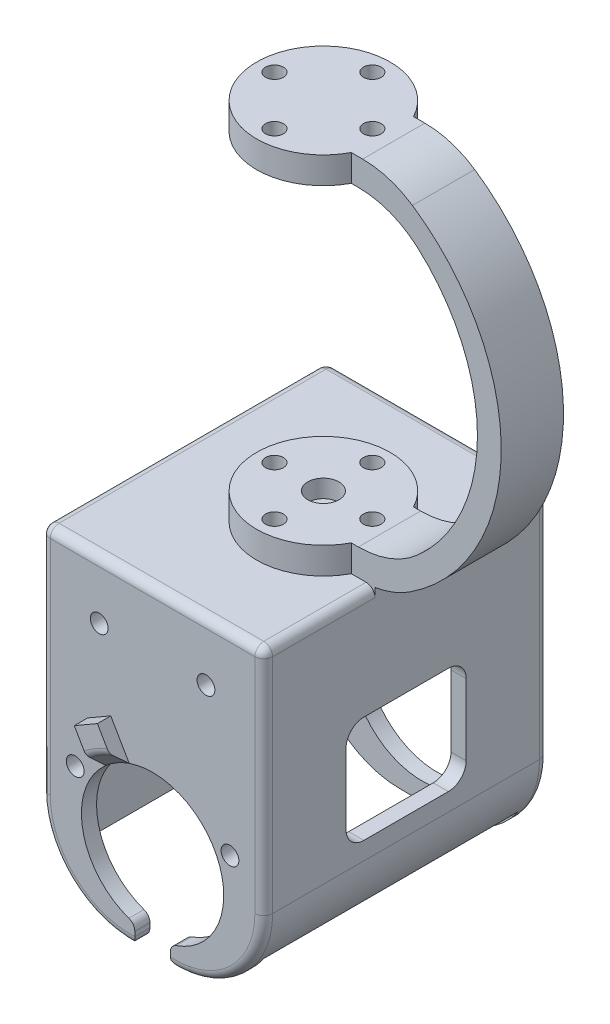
ISO-10303-21;
HEADER;
FILE_DESCRIPTION(('STEP AP214'),'2;1');
FILE_NAME('part.step','',(''),(''),'','','');
FILE_SCHEMA(('AUTOMOTIVE_DESIGN { 1 0 10303 214 1 1 1 1 }'));
ENDSEC;
DATA;
#1=APPLICATION_CONTEXT('core data for automotive mechanical design processes');
#2=APPLICATION_PROTOCOL_DEFINITION('international standard','automotive_design',2000,#1);
#3=PRODUCT_CONTEXT('',#1,'mechanical');
#4=PRODUCT('Part','Part','',(#3));
#5=PRODUCT_RELATED_PRODUCT_CATEGORY('part','',(#4));
#6=PRODUCT_DEFINITION_FORMATION('','',#4);
#7=PRODUCT_DEFINITION_CONTEXT('part definition',#1,'design');
#8=PRODUCT_DEFINITION('design','',#6,#7);
#9=PRODUCT_DEFINITION_SHAPE('','',#8);
#10=(LENGTH_UNIT() NAMED_UNIT(*) SI_UNIT(.MILLI.,.METRE.));
#11=(NAMED_UNIT(*) PLANE_ANGLE_UNIT() SI_UNIT($,.RADIAN.));
#12=(NAMED_UNIT(*) SI_UNIT($,.STERADIAN.) SOLID_ANGLE_UNIT());
#13=UNCERTAINTY_MEASURE_WITH_UNIT(LENGTH_MEASURE(1.E-05),#10,'distance_accuracy_value','');
#14=(GEOMETRIC_REPRESENTATION_CONTEXT(3) GLOBAL_UNCERTAINTY_ASSIGNED_CONTEXT((#13)) GLOBAL_UNIT_ASSIGNED_CONTEXT((#10,
#11,#12)) REPRESENTATION_CONTEXT('',''));
#15=CARTESIAN_POINT('',(0.,0.,0.));
#16=DIRECTION('',(0.,0.,1.));
#17=DIRECTION('',(1.,0.,0.));
#18=AXIS2_PLACEMENT_3D('',#15,#16,#17);
#19=CARTESIAN_POINT('',(2.64429139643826E-13,-18.8654728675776,-1.14542325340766E-13));
#20=DIRECTION('',(0.,1.,0.));
#21=DIRECTION('',(-1.,0.,0.));
#22=AXIS2_PLACEMENT_3D('',#19,#20,#21);
#23=PLANE('',#22);
#24=DIRECTION('',(1.,0.,0.));
#25=VECTOR('',#24,1.);
#26=CARTESIAN_POINT('',(2.6442913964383E-13,-18.8654728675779,46.5158666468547));
#27=LINE('',#26,#25);
#28=CARTESIAN_POINT('',(-7.83550507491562,-18.865472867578,46.5158666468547));
#29=VERTEX_POINT('',#28);
#30=CARTESIAN_POINT('',(15.1644949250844,-18.8654728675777,46.5158666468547));
#31=VERTEX_POINT('',#30);
#32=EDGE_CURVE('E694',#29,#31,#27,.T.);
#33=ORIENTED_EDGE('',*,*,#32,.T.);
#34=DIRECTION('',(0.,0.,1.));
#35=VECTOR('',#34,1.);
#36=CARTESIAN_POINT('',(15.1644949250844,-18.8654728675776,35.0158666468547));
#37=LINE('',#36,#35);
#38=CARTESIAN_POINT('',(15.1644949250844,-18.8654728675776,35.0158666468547));
#39=VERTEX_POINT('',#38);
#40=EDGE_CURVE('E1049',#31,#39,#37,.F.);
#41=ORIENTED_EDGE('',*,*,#40,.T.);
#42=DIRECTION('',(-1.,0.,0.));
#43=VECTOR('',#42,1.);
#44=CARTESIAN_POINT('',(17.3644949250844,-18.8654728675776,35.0158666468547));
#45=LINE('',#44,#43);
#46=CARTESIAN_POINT('',(13.4977445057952,-18.8654728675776,35.0158666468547));
#47=VERTEX_POINT('',#46);
#48=EDGE_CURVE('E508',#39,#47,#45,.T.);
#49=ORIENTED_EDGE('',*,*,#48,.T.);
#50=CARTESIAN_POINT('',(6.86449492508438,-18.8654728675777,31.5158666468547));
#51=DIRECTION('',(0.,1.,0.));
#52=DIRECTION('',(-1.,0.,0.));
#53=AXIS2_PLACEMENT_3D('',#50,#51,#52);
#54=CIRCLE('',#53,7.5);
#55=CARTESIAN_POINT('',(13.4977445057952,-18.8654728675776,28.0158666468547));
#56=VERTEX_POINT('',#55);
#57=EDGE_CURVE('E538',#56,#47,#54,.T.);
#58=ORIENTED_EDGE('',*,*,#57,.F.);
#59=DIRECTION('',(1.,0.,0.));
#60=VECTOR('',#59,1.);
#61=CARTESIAN_POINT('',(17.3644949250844,-18.8654728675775,28.0158666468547));
#62=LINE('',#61,#60);
#63=CARTESIAN_POINT('',(15.1644949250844,-18.8654728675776,28.0158666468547));
#64=VERTEX_POINT('',#63);
#65=EDGE_CURVE('E510',#56,#64,#62,.T.);
#66=ORIENTED_EDGE('',*,*,#65,.T.);
#67=DIRECTION('',(0.,0.,1.));
#68=VECTOR('',#67,1.);
#69=CARTESIAN_POINT('',(15.1644949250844,-18.8654728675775,16.5158666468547));
#70=LINE('',#69,#68);
#71=CARTESIAN_POINT('',(15.1644949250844,-18.8654728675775,16.5158666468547));
#72=VERTEX_POINT('',#71);
#73=EDGE_CURVE('E1047',#64,#72,#70,.F.);
#74=ORIENTED_EDGE('',*,*,#73,.T.);
#75=DIRECTION('',(1.,0.,0.));
#76=VECTOR('',#75,1.);
#77=CARTESIAN_POINT('',(-8.83550507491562,-18.8654728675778,16.5158666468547));
#78=LINE('',#77,#76);
#79=CARTESIAN_POINT('',(-7.83550507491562,-18.8654728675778,16.5158666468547));
#80=VERTEX_POINT('',#79);
#81=EDGE_CURVE('E700',#72,#80,#78,.F.);
#82=ORIENTED_EDGE('',*,*,#81,.T.);
#83=DIRECTION('',(0.,0.,1.));
#84=VECTOR('',#83,1.);
#85=CARTESIAN_POINT('',(-7.83550507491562,-18.8654728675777,-1.14542325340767E-13));
#86=LINE('',#85,#84);
#87=EDGE_CURVE('E697',#80,#29,#86,.T.);
#88=ORIENTED_EDGE('',*,*,#87,.T.);
#89=EDGE_LOOP('',(#33,#41,#49,#58,#66,#74,#82,#88));
#90=FACE_BOUND('',#89,.T.);
#91=ADVANCED_FACE('F47',(#90),#23,.T.);
#92=CARTESIAN_POINT('',(-8.83550507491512,-54.865472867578,47.5158666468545));
#93=DIRECTION('',(0.,0.,1.));
#94=DIRECTION('',(0.,-1.,0.));
#95=AXIS2_PLACEMENT_3D('',#92,#93,#94);
#96=PLANE('',#95);
#97=CARTESIAN_POINT('',(6.16449492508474,-44.8654728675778,47.5158666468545));
#98=DIRECTION('',(0.,0.,1.));
#99=DIRECTION('',(0.,-1.,0.));
#100=AXIS2_PLACEMENT_3D('',#97,#98,#99);
#101=CIRCLE('',#100,9.);
#102=CARTESIAN_POINT('',(5.66449492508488,-53.8515732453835,47.5158666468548));
#103=VERTEX_POINT('',#102);
#104=CARTESIAN_POINT('',(15.1644949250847,-44.8654728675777,47.5158666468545));
#105=VERTEX_POINT('',#104);
#106=EDGE_CURVE('E1059',#103,#105,#101,.T.);
#107=ORIENTED_EDGE('',*,*,#106,.T.);
#108=DIRECTION('',(0.,1.,0.));
#109=VECTOR('',#108,1.);
#110=CARTESIAN_POINT('',(15.1644949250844,-19.8654728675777,47.5158666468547));
#111=LINE('',#110,#109);
#112=CARTESIAN_POINT('',(15.1644949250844,-19.8654728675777,47.5158666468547));
#113=VERTEX_POINT('',#112);
#114=EDGE_CURVE('E1061',#105,#113,#111,.T.);
#115=ORIENTED_EDGE('',*,*,#114,.T.);
#116=DIRECTION('',(1.,0.,0.));
#117=VECTOR('',#116,1.);
#118=CARTESIAN_POINT('',(-8.83550507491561,-19.865472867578,47.5158666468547));
#119=LINE('',#118,#117);
#120=CARTESIAN_POINT('',(-7.83550507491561,-19.865472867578,47.5158666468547));
#121=VERTEX_POINT('',#120);
#122=EDGE_CURVE('E706',#113,#121,#119,.F.);
#123=ORIENTED_EDGE('',*,*,#122,.T.);
#124=DIRECTION('',(0.,1.,0.));
#125=VECTOR('',#124,1.);
#126=CARTESIAN_POINT('',(-7.83550507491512,-54.865472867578,47.5158666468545));
#127=LINE('',#126,#125);
#128=CARTESIAN_POINT('',(-7.83550507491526,-44.865472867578,47.5158666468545));
#129=VERTEX_POINT('',#128);
#130=EDGE_CURVE('E1057',#121,#129,#127,.F.);
#131=ORIENTED_EDGE('',*,*,#130,.T.);
#132=CARTESIAN_POINT('',(1.16449492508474,-44.8654728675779,47.5158666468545));
#133=DIRECTION('',(0.,0.,1.));
#134=DIRECTION('',(0.,-1.,0.));
#135=AXIS2_PLACEMENT_3D('',#132,#133,#134);
#136=CIRCLE('',#135,9.);
#137=CARTESIAN_POINT('',(1.66449492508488,-53.8515732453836,47.5158666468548));
#138=VERTEX_POINT('',#137);
#139=EDGE_CURVE('E1055',#129,#138,#136,.T.);
#140=ORIENTED_EDGE('',*,*,#139,.T.);
#141=DIRECTION('',(0.,-1.,0.));
#142=VECTOR('',#141,1.);
#143=CARTESIAN_POINT('',(1.66449492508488,-47.6361773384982,47.5158666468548));
#144=LINE('',#143,#142);
#145=CARTESIAN_POINT('',(1.66449492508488,-53.3507542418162,47.5158666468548));
#146=VERTEX_POINT('',#145);
#147=EDGE_CURVE('E2092',#146,#138,#144,.T.);
#148=ORIENTED_EDGE('',*,*,#147,.F.);
#149=CARTESIAN_POINT('',(0.664494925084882,-53.3507542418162,47.5158666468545));
#150=DIRECTION('',(0.,0.,1.));
#151=DIRECTION('',(0.,-1.,0.));
#152=AXIS2_PLACEMENT_3D('',#149,#150,#151);
#153=CIRCLE('',#152,1.);
#154=CARTESIAN_POINT('',(0.997828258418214,-52.4079452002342,47.5158666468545));
#155=VERTEX_POINT('',#154);
#156=EDGE_CURVE('E999',#146,#155,#153,.T.);
#157=ORIENTED_EDGE('',*,*,#156,.T.);
#158=CARTESIAN_POINT('',(3.66449492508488,-44.8654728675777,47.5158666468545));
#159=DIRECTION('',(0.,0.,1.));
#160=DIRECTION('',(0.,-1.,0.));
#161=AXIS2_PLACEMENT_3D('',#158,#159,#160);
#162=CIRCLE('',#161,8.);
#163=CARTESIAN_POINT('',(-1.56360159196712,-38.8101440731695,47.5158666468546));
#164=VERTEX_POINT('',#163);
#165=EDGE_CURVE('E642',#164,#155,#162,.T.);
#166=ORIENTED_EDGE('',*,*,#165,.F.);
#167=DIRECTION('',(0.500000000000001,-0.866025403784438,0.));
#168=VECTOR('',#167,1.);
#169=CARTESIAN_POINT('',(-1.56360159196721,-38.8101440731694,47.5158666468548));
#170=LINE('',#169,#168);
#171=CARTESIAN_POINT('',(-3.63454318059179,-35.2231680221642,47.5158666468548));
#172=VERTEX_POINT('',#171);
#173=EDGE_CURVE('E584',#172,#164,#170,.T.);
#174=ORIENTED_EDGE('',*,*,#173,.F.);
#175=DIRECTION('',(-0.866025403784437,-0.500000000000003,0.));
#176=VECTOR('',#175,1.);
#177=CARTESIAN_POINT('',(-3.63454318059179,-35.2231680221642,47.5158666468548));
#178=LINE('',#177,#176);
#179=CARTESIAN_POINT('',(-1.03646696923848,-33.7231680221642,47.5158666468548));
#180=VERTEX_POINT('',#179);
#181=EDGE_CURVE('E591',#180,#172,#178,.T.);
#182=ORIENTED_EDGE('',*,*,#181,.F.);
#183=DIRECTION('',(-0.500000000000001,0.866025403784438,0.));
#184=VECTOR('',#183,1.);
#185=CARTESIAN_POINT('',(1.0344746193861,-37.3101440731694,47.5158666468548));
#186=LINE('',#185,#184);
#187=CARTESIAN_POINT('',(1.0344746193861,-37.3101440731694,47.5158666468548));
#188=VERTEX_POINT('',#187);
#189=EDGE_CURVE('E580',#188,#180,#186,.T.);
#190=ORIENTED_EDGE('',*,*,#189,.F.);
#191=CARTESIAN_POINT('',(6.33116159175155,-52.4079452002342,47.5158666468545));
#192=VERTEX_POINT('',#191);
#193=EDGE_CURVE('E641',#192,#188,#162,.T.);
#194=ORIENTED_EDGE('',*,*,#193,.F.);
#195=CARTESIAN_POINT('',(6.66449492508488,-53.3507542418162,47.5158666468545));
#196=DIRECTION('',(0.,0.,1.));
#197=DIRECTION('',(0.,-1.,0.));
#198=AXIS2_PLACEMENT_3D('',#195,#196,#197);
#199=CIRCLE('',#198,1.);
#200=CARTESIAN_POINT('',(5.66449492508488,-53.3507542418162,47.5158666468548));
#201=VERTEX_POINT('',#200);
#202=EDGE_CURVE('E996',#192,#201,#199,.T.);
#203=ORIENTED_EDGE('',*,*,#202,.T.);
#204=DIRECTION('',(0.,1.,0.));
#205=VECTOR('',#204,1.);
#206=CARTESIAN_POINT('',(5.66449492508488,-47.6361773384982,47.5158666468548));
#207=LINE('',#206,#205);
#208=EDGE_CURVE('E2121',#103,#201,#207,.T.);
#209=ORIENTED_EDGE('',*,*,#208,.F.);
#210=EDGE_LOOP('',(#107,#115,#123,#131,#140,#148,#157,#166,#174,#182,#190,#194,#203,#209));
#211=FACE_BOUND('',#210,.T.);
#212=CARTESIAN_POINT('',(9.66449492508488,-25.3654728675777,47.5158666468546));
#213=DIRECTION('',(0.,0.,1.));
#214=DIRECTION('',(0.,-1.,0.));
#215=AXIS2_PLACEMENT_3D('',#212,#213,#214);
#216=CIRCLE('',#215,1.);
#217=CARTESIAN_POINT('',(9.66449492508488,-26.3654728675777,47.5158666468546));
#218=VERTEX_POINT('',#217);
#219=EDGE_CURVE('E609',#218,#218,#216,.T.);
#220=ORIENTED_EDGE('',*,*,#219,.F.);
#221=EDGE_LOOP('',(#220));
#222=FACE_BOUND('',#221,.T.);
#223=CARTESIAN_POINT('',(-2.33550507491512,-25.3654728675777,47.5158666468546));
#224=DIRECTION('',(0.,0.,1.));
#225=DIRECTION('',(0.,-1.,0.));
#226=AXIS2_PLACEMENT_3D('',#223,#224,#225);
#227=CIRCLE('',#226,1.);
#228=CARTESIAN_POINT('',(-2.33550507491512,-26.3654728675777,47.5158666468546));
#229=VERTEX_POINT('',#228);
#230=EDGE_CURVE('E603',#229,#229,#227,.T.);
#231=ORIENTED_EDGE('',*,*,#230,.F.);
#232=EDGE_LOOP('',(#231));
#233=FACE_BOUND('',#232,.T.);
#234=CARTESIAN_POINT('',(12.3644949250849,-40.6154728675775,47.5158666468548));
#235=DIRECTION('',(0.,0.,1.));
#236=DIRECTION('',(1.,0.,0.));
#237=AXIS2_PLACEMENT_3D('',#234,#235,#236);
#238=CIRCLE('',#237,1.);
#239=CARTESIAN_POINT('',(13.3644949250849,-40.6154728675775,47.5158666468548));
#240=VERTEX_POINT('',#239);
#241=EDGE_CURVE('E612',#240,#240,#238,.T.);
#242=ORIENTED_EDGE('',*,*,#241,.F.);
#243=EDGE_LOOP('',(#242));
#244=FACE_BOUND('',#243,.T.);
#245=CARTESIAN_POINT('',(-5.03550507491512,-40.6154728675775,47.5158666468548));
#246=DIRECTION('',(0.,0.,-1.));
#247=DIRECTION('',(-1.,0.,0.));
#248=AXIS2_PLACEMENT_3D('',#245,#246,#247);
#249=CIRCLE('',#248,1.);
#250=CARTESIAN_POINT('',(-6.03550507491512,-40.6154728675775,47.5158666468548));
#251=VERTEX_POINT('',#250);
#252=EDGE_CURVE('E613',#251,#251,#249,.T.);
#253=ORIENTED_EDGE('',*,*,#252,.T.);
#254=EDGE_LOOP('',(#253));
#255=FACE_BOUND('',#254,.T.);
#256=ADVANCED_FACE('F1177',(#211,#222,#233,#244,#255),#96,.T.);
#257=CARTESIAN_POINT('',(2.9942913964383E-13,-21.3654728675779,45.8158666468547));
#258=DIRECTION('',(0.,0.,-1.));
#259=DIRECTION('',(0.,1.,0.));
#260=AXIS2_PLACEMENT_3D('',#257,#258,#259);
#261=PLANE('',#260);
#262=DIRECTION('',(0.,-1.,0.));
#263=VECTOR('',#262,1.);
#264=CARTESIAN_POINT('',(14.4644949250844,-21.3654728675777,45.8158666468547));
#265=LINE('',#264,#263);
#266=CARTESIAN_POINT('',(14.4644949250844,-21.3654728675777,45.8158666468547));
#267=VERTEX_POINT('',#266);
#268=CARTESIAN_POINT('',(14.4644949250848,-50.4431067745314,45.8158666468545));
#269=VERTEX_POINT('',#268);
#270=EDGE_CURVE('E672',#267,#269,#265,.T.);
#271=ORIENTED_EDGE('',*,*,#270,.T.);
#272=CARTESIAN_POINT('',(6.16449492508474,-44.8654728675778,45.8158666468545));
#273=DIRECTION('',(0.,0.,-1.));
#274=DIRECTION('',(0.,1.,0.));
#275=AXIS2_PLACEMENT_3D('',#272,#273,#274);
#276=CIRCLE('',#275,10.);
#277=CARTESIAN_POINT('',(6.54451695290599,-54.8582494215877,45.8158666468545));
#278=VERTEX_POINT('',#277);
#279=EDGE_CURVE('E1019',#269,#278,#276,.T.);
#280=ORIENTED_EDGE('',*,*,#279,.T.);
#281=CARTESIAN_POINT('',(6.66449492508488,-53.8654728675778,45.8158666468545));
#282=DIRECTION('',(0.,0.,-1.));
#283=DIRECTION('',(0.,1.,0.));
#284=AXIS2_PLACEMENT_3D('',#281,#282,#283);
#285=CIRCLE('',#284,1.);
#286=CARTESIAN_POINT('',(5.66449492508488,-53.8654728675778,45.8158666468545));
#287=VERTEX_POINT('',#286);
#288=EDGE_CURVE('E986',#278,#287,#285,.T.);
#289=ORIENTED_EDGE('',*,*,#288,.T.);
#290=DIRECTION('',(0.,-1.,0.));
#291=VECTOR('',#290,1.);
#292=CARTESIAN_POINT('',(5.66449492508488,-21.3654728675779,45.8158666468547));
#293=LINE('',#292,#291);
#294=CARTESIAN_POINT('',(5.66449492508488,-53.3507542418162,45.8158666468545));
#295=VERTEX_POINT('',#294);
#296=EDGE_CURVE('E1398',#295,#287,#293,.T.);
#297=ORIENTED_EDGE('',*,*,#296,.F.);
#298=CARTESIAN_POINT('',(6.66449492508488,-53.3507542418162,45.8158666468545));
#299=DIRECTION('',(0.,0.,-1.));
#300=DIRECTION('',(0.,1.,0.));
#301=AXIS2_PLACEMENT_3D('',#298,#299,#300);
#302=CIRCLE('',#301,1.);
#303=CARTESIAN_POINT('',(6.33116159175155,-52.4079452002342,45.8158666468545));
#304=VERTEX_POINT('',#303);
#305=EDGE_CURVE('E988',#295,#304,#302,.T.);
#306=ORIENTED_EDGE('',*,*,#305,.T.);
#307=CARTESIAN_POINT('',(3.66449492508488,-44.8654728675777,45.8158666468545));
#308=DIRECTION('',(0.,0.,-1.));
#309=DIRECTION('',(0.,1.,0.));
#310=AXIS2_PLACEMENT_3D('',#307,#308,#309);
#311=CIRCLE('',#310,8.);
#312=CARTESIAN_POINT('',(0.997828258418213,-52.4079452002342,45.8158666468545));
#313=VERTEX_POINT('',#312);
#314=EDGE_CURVE('E638',#313,#304,#311,.T.);
#315=ORIENTED_EDGE('',*,*,#314,.F.);
#316=CARTESIAN_POINT('',(0.664494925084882,-53.3507542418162,45.8158666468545));
#317=DIRECTION('',(0.,0.,-1.));
#318=DIRECTION('',(0.,1.,0.));
#319=AXIS2_PLACEMENT_3D('',#316,#317,#318);
#320=CIRCLE('',#319,1.);
#321=CARTESIAN_POINT('',(1.66449492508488,-53.3507542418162,45.8158666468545));
#322=VERTEX_POINT('',#321);
#323=EDGE_CURVE('E990',#313,#322,#320,.T.);
#324=ORIENTED_EDGE('',*,*,#323,.T.);
#325=DIRECTION('',(0.,1.,0.));
#326=VECTOR('',#325,1.);
#327=CARTESIAN_POINT('',(1.66449492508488,-21.3654728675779,45.8158666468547));
#328=LINE('',#327,#326);
#329=CARTESIAN_POINT('',(1.66449492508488,-53.8654728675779,45.8158666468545));
#330=VERTEX_POINT('',#329);
#331=EDGE_CURVE('E1394',#330,#322,#328,.T.);
#332=ORIENTED_EDGE('',*,*,#331,.F.);
#333=CARTESIAN_POINT('',(0.664494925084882,-53.8654728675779,45.8158666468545));
#334=DIRECTION('',(0.,0.,-1.));
#335=DIRECTION('',(0.,1.,0.));
#336=AXIS2_PLACEMENT_3D('',#333,#334,#335);
#337=CIRCLE('',#336,1.);
#338=CARTESIAN_POINT('',(0.784472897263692,-54.8582494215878,45.8158666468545));
#339=VERTEX_POINT('',#338);
#340=EDGE_CURVE('E983',#330,#339,#337,.T.);
#341=ORIENTED_EDGE('',*,*,#340,.T.);
#342=CARTESIAN_POINT('',(1.16449492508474,-44.8654728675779,45.8158666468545));
#343=DIRECTION('',(0.,0.,-1.));
#344=DIRECTION('',(0.,1.,0.));
#345=AXIS2_PLACEMENT_3D('',#342,#343,#344);
#346=CIRCLE('',#345,10.);
#347=CARTESIAN_POINT('',(-7.13550507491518,-50.4431067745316,45.8158666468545));
#348=VERTEX_POINT('',#347);
#349=EDGE_CURVE('E1017',#339,#348,#346,.T.);
#350=ORIENTED_EDGE('',*,*,#349,.T.);
#351=DIRECTION('',(0.,-1.,0.));
#352=VECTOR('',#351,1.);
#353=CARTESIAN_POINT('',(-7.13550507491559,-21.365472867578,45.8158666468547));
#354=LINE('',#353,#352);
#355=CARTESIAN_POINT('',(-7.13550507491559,-21.365472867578,45.8158666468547));
#356=VERTEX_POINT('',#355);
#357=EDGE_CURVE('E660',#356,#348,#354,.T.);
#358=ORIENTED_EDGE('',*,*,#357,.F.);
#359=DIRECTION('',(1.,0.,0.));
#360=VECTOR('',#359,1.);
#361=CARTESIAN_POINT('',(2.9942913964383E-13,-21.3654728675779,45.8158666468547));
#362=LINE('',#361,#360);
#363=EDGE_CURVE('E646',#356,#267,#362,.T.);
#364=ORIENTED_EDGE('',*,*,#363,.T.);
#365=EDGE_LOOP('',(#271,#280,#289,#297,#306,#315,#324,#332,#341,#350,#358,#364));
#366=FACE_BOUND('',#365,.T.);
#367=CARTESIAN_POINT('',(9.66449492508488,-25.3654728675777,45.8158666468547));
#368=DIRECTION('',(0.,0.,-1.));
#369=DIRECTION('',(0.,1.,0.));
#370=AXIS2_PLACEMENT_3D('',#367,#368,#369);
#371=CIRCLE('',#370,1.);
#372=CARTESIAN_POINT('',(9.66449492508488,-24.3654728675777,45.8158666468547));
#373=VERTEX_POINT('',#372);
#374=EDGE_CURVE('E606',#373,#373,#371,.T.);
#375=ORIENTED_EDGE('',*,*,#374,.F.);
#376=EDGE_LOOP('',(#375));
#377=FACE_BOUND('',#376,.T.);
#378=CARTESIAN_POINT('',(-2.33550507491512,-25.3654728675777,45.8158666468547));
#379=DIRECTION('',(0.,0.,-1.));
#380=DIRECTION('',(0.,1.,0.));
#381=AXIS2_PLACEMENT_3D('',#378,#379,#380);
#382=CIRCLE('',#381,1.);
#383=CARTESIAN_POINT('',(-2.33550507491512,-24.3654728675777,45.8158666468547));
#384=VERTEX_POINT('',#383);
#385=EDGE_CURVE('E600',#384,#384,#382,.T.);
#386=ORIENTED_EDGE('',*,*,#385,.F.);
#387=EDGE_LOOP('',(#386));
#388=FACE_BOUND('',#387,.T.);
#389=CARTESIAN_POINT('',(12.3644949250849,-40.6154728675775,45.8158666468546));
#390=DIRECTION('',(0.,0.,-1.));
#391=DIRECTION('',(0.,1.,0.));
#392=AXIS2_PLACEMENT_3D('',#389,#390,#391);
#393=CIRCLE('',#392,1.);
#394=CARTESIAN_POINT('',(12.3644949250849,-39.6154728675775,45.8158666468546));
#395=VERTEX_POINT('',#394);
#396=EDGE_CURVE('E616',#395,#395,#393,.T.);
#397=ORIENTED_EDGE('',*,*,#396,.F.);
#398=EDGE_LOOP('',(#397));
#399=FACE_BOUND('',#398,.T.);
#400=CARTESIAN_POINT('',(-5.03550507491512,-40.6154728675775,45.8158666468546));
#401=DIRECTION('',(0.,0.,-1.));
#402=DIRECTION('',(0.,1.,0.));
#403=AXIS2_PLACEMENT_3D('',#400,#401,#402);
#404=CIRCLE('',#403,1.);
#405=CARTESIAN_POINT('',(-5.03550507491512,-39.6154728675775,45.8158666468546));
#406=VERTEX_POINT('',#405);
#407=EDGE_CURVE('E629',#406,#406,#404,.F.);
#408=ORIENTED_EDGE('',*,*,#407,.T.);
#409=EDGE_LOOP('',(#408));
#410=FACE_BOUND('',#409,.T.);
#411=ADVANCED_FACE('F1183',(#366,#377,#388,#399,#410),#261,.T.);
#412=CARTESIAN_POINT('',(1.3644949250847,-41.8654728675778,31.5158666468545));
#413=DIRECTION('',(0.,1.,0.));
#414=DIRECTION('',(-1.,0.,0.));
#415=AXIS2_PLACEMENT_3D('',#412,#413,#414);
#416=CYLINDRICAL_SURFACE('',#415,1.);
#417=CARTESIAN_POINT('',(1.3644949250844,-17.3654728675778,31.5158666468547));
#418=DIRECTION('',(0.,-1.,0.));
#419=DIRECTION('',(1.,0.,0.));
#420=AXIS2_PLACEMENT_3D('',#417,#418,#419);
#421=CIRCLE('',#420,1.);
#422=CARTESIAN_POINT('',(2.3644949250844,-17.3654728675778,31.5158666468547));
#423=VERTEX_POINT('',#422);
#424=EDGE_CURVE('E663',#423,#423,#421,.T.);
#425=ORIENTED_EDGE('',*,*,#424,.T.);
#426=EDGE_LOOP('',(#425));
#427=FACE_BOUND('',#426,.T.);
#428=CARTESIAN_POINT('',(1.36449492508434,-15.8654728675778,31.5158666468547));
#429=DIRECTION('',(0.,1.,0.));
#430=DIRECTION('',(-1.,0.,0.));
#431=AXIS2_PLACEMENT_3D('',#428,#429,#430);
#432=CIRCLE('',#431,1.);
#433=CARTESIAN_POINT('',(0.364494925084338,-15.8654728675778,31.5158666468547));
#434=VERTEX_POINT('',#433);
#435=EDGE_CURVE('E535',#434,#434,#432,.T.);
#436=ORIENTED_EDGE('',*,*,#435,.T.);
#437=EDGE_LOOP('',(#436));
#438=FACE_BOUND('',#437,.T.);
#439=ADVANCED_FACE('F1490',(#427,#438),#416,.F.);
#440=CARTESIAN_POINT('',(6.8644949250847,-41.8654728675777,26.0158666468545));
#441=DIRECTION('',(0.,1.,0.));
#442=DIRECTION('',(-1.,0.,0.));
#443=AXIS2_PLACEMENT_3D('',#440,#441,#442);
#444=CYLINDRICAL_SURFACE('',#443,1.);
#445=CARTESIAN_POINT('',(6.8644949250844,-17.3654728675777,26.0158666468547));
#446=DIRECTION('',(0.,-1.,0.));
#447=DIRECTION('',(1.,0.,0.));
#448=AXIS2_PLACEMENT_3D('',#445,#446,#447);
#449=CIRCLE('',#448,1.);
#450=CARTESIAN_POINT('',(7.8644949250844,-17.3654728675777,26.0158666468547));
#451=VERTEX_POINT('',#450);
#452=EDGE_CURVE('E800',#451,#451,#449,.T.);
#453=ORIENTED_EDGE('',*,*,#452,.T.);
#454=EDGE_LOOP('',(#453));
#455=FACE_BOUND('',#454,.T.);
#456=CARTESIAN_POINT('',(6.86449492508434,-15.8654728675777,26.0158666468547));
#457=DIRECTION('',(0.,1.,0.));
#458=DIRECTION('',(-1.,0.,0.));
#459=AXIS2_PLACEMENT_3D('',#456,#457,#458);
#460=CIRCLE('',#459,1.);
#461=CARTESIAN_POINT('',(5.86449492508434,-15.8654728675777,26.0158666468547));
#462=VERTEX_POINT('',#461);
#463=EDGE_CURVE('E532',#462,#462,#460,.T.);
#464=ORIENTED_EDGE('',*,*,#463,.T.);
#465=EDGE_LOOP('',(#464));
#466=FACE_BOUND('',#465,.T.);
#467=ADVANCED_FACE('F1285',(#455,#466),#444,.F.);
#468=CARTESIAN_POINT('',(6.8644949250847,-41.8654728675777,37.0158666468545));
#469=DIRECTION('',(0.,1.,0.));
#470=DIRECTION('',(-1.,0.,0.));
#471=AXIS2_PLACEMENT_3D('',#468,#469,#470);
#472=CYLINDRICAL_SURFACE('',#471,1.);
#473=CARTESIAN_POINT('',(6.8644949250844,-17.3654728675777,37.0158666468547));
#474=DIRECTION('',(0.,-1.,0.));
#475=DIRECTION('',(1.,0.,0.));
#476=AXIS2_PLACEMENT_3D('',#473,#474,#475);
#477=CIRCLE('',#476,1.);
#478=CARTESIAN_POINT('',(7.8644949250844,-17.3654728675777,37.0158666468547));
#479=VERTEX_POINT('',#478);
#480=EDGE_CURVE('E803',#479,#479,#477,.T.);
#481=ORIENTED_EDGE('',*,*,#480,.T.);
#482=EDGE_LOOP('',(#481));
#483=FACE_BOUND('',#482,.T.);
#484=CARTESIAN_POINT('',(6.86449492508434,-15.8654728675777,37.0158666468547));
#485=DIRECTION('',(0.,1.,0.));
#486=DIRECTION('',(-1.,0.,0.));
#487=AXIS2_PLACEMENT_3D('',#484,#485,#486);
#488=CIRCLE('',#487,0.999999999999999);
#489=CARTESIAN_POINT('',(5.86449492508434,-15.8654728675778,37.0158666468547));
#490=VERTEX_POINT('',#489);
#491=EDGE_CURVE('E526',#490,#490,#488,.T.);
#492=ORIENTED_EDGE('',*,*,#491,.T.);
#493=EDGE_LOOP('',(#492));
#494=FACE_BOUND('',#493,.T.);
#495=ADVANCED_FACE('F1281',(#483,#494),#472,.F.);
#496=CARTESIAN_POINT('',(12.3644949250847,-41.8654728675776,31.5158666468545));
#497=DIRECTION('',(0.,1.,0.));
#498=DIRECTION('',(-1.,0.,0.));
#499=AXIS2_PLACEMENT_3D('',#496,#497,#498);
#500=CYLINDRICAL_SURFACE('',#499,1.);
#501=CARTESIAN_POINT('',(12.3644949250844,-17.3654728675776,31.5158666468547));
#502=DIRECTION('',(0.,-1.,0.));
#503=DIRECTION('',(1.,0.,0.));
#504=AXIS2_PLACEMENT_3D('',#501,#502,#503);
#505=CIRCLE('',#504,1.);
#506=CARTESIAN_POINT('',(13.3644949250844,-17.3654728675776,31.5158666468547));
#507=VERTEX_POINT('',#506);
#508=EDGE_CURVE('E812',#507,#507,#505,.T.);
#509=ORIENTED_EDGE('',*,*,#508,.T.);
#510=EDGE_LOOP('',(#509));
#511=FACE_BOUND('',#510,.T.);
#512=CARTESIAN_POINT('',(12.3644949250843,-15.8654728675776,31.5158666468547));
#513=DIRECTION('',(0.,1.,0.));
#514=DIRECTION('',(-1.,0.,0.));
#515=AXIS2_PLACEMENT_3D('',#512,#513,#514);
#516=CIRCLE('',#515,1.);
#517=CARTESIAN_POINT('',(11.3644949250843,-15.8654728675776,31.5158666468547));
#518=VERTEX_POINT('',#517);
#519=EDGE_CURVE('E529',#518,#518,#516,.T.);
#520=ORIENTED_EDGE('',*,*,#519,.T.);
#521=EDGE_LOOP('',(#520));
#522=FACE_BOUND('',#521,.T.);
#523=ADVANCED_FACE('F1284',(#511,#522),#500,.F.);
#524=CARTESIAN_POINT('',(7.68429139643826E-13,-54.8654728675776,-3.30542325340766E-13));
#525=DIRECTION('',(0.,1.,0.));
#526=DIRECTION('',(-1.,0.,0.));
#527=AXIS2_PLACEMENT_3D('',#524,#525,#526);
#528=PLANE('',#527);
#529=DIRECTION('',(0.,0.,1.));
#530=VECTOR('',#529,1.);
#531=CARTESIAN_POINT('',(1.16449492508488,-54.8654728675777,15.5158666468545));
#532=LINE('',#531,#530);
#533=CARTESIAN_POINT('',(1.16449492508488,-54.8654728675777,17.2158666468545));
#534=VERTEX_POINT('',#533);
#535=CARTESIAN_POINT('',(1.16449492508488,-54.8654728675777,16.5158666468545));
#536=VERTEX_POINT('',#535);
#537=EDGE_CURVE('E1006',#534,#536,#532,.F.);
#538=ORIENTED_EDGE('',*,*,#537,.T.);
#539=DIRECTION('',(1.,0.,0.));
#540=VECTOR('',#539,1.);
#541=CARTESIAN_POINT('',(7.68429139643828E-13,-54.8654728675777,16.5158666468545));
#542=LINE('',#541,#540);
#543=CARTESIAN_POINT('',(6.16449492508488,-54.8654728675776,16.5158666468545));
#544=VERTEX_POINT('',#543);
#545=EDGE_CURVE('E1152',#536,#544,#542,.T.);
#546=ORIENTED_EDGE('',*,*,#545,.T.);
#547=DIRECTION('',(0.,0.,1.));
#548=VECTOR('',#547,1.);
#549=CARTESIAN_POINT('',(6.16449492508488,-54.8654728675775,-3.30542325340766E-13));
#550=LINE('',#549,#548);
#551=CARTESIAN_POINT('',(6.16449492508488,-54.8654728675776,17.2158666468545));
#552=VERTEX_POINT('',#551);
#553=EDGE_CURVE('E1009',#544,#552,#550,.T.);
#554=ORIENTED_EDGE('',*,*,#553,.T.);
#555=DIRECTION('',(1.,0.,0.));
#556=VECTOR('',#555,1.);
#557=CARTESIAN_POINT('',(7.68429139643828E-13,-54.8654728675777,17.2158666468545));
#558=LINE('',#557,#556);
#559=EDGE_CURVE('E650',#534,#552,#558,.T.);
#560=ORIENTED_EDGE('',*,*,#559,.F.);
#561=EDGE_LOOP('',(#538,#546,#554,#560));
#562=FACE_BOUND('',#561,.T.);
#563=ADVANCED_FACE('F1188',(#562),#528,.F.);
#564=CARTESIAN_POINT('',(-8.83550507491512,-54.8654728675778,15.5158666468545));
#565=DIRECTION('',(-1.,0.,0.));
#566=DIRECTION('',(0.,-1.,0.));
#567=AXIS2_PLACEMENT_3D('',#564,#565,#566);
#568=PLANE('',#567);
#569=DIRECTION('',(0.,1.,0.));
#570=VECTOR('',#569,1.);
#571=CARTESIAN_POINT('',(-8.83550507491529,-42.8654728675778,38.2658666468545));
#572=LINE('',#571,#570);
#573=CARTESIAN_POINT('',(-8.83550507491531,-40.8654728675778,38.2658666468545));
#574=VERTEX_POINT('',#573);
#575=CARTESIAN_POINT('',(-8.83550507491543,-32.8654728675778,38.2658666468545));
#576=VERTEX_POINT('',#575);
#577=EDGE_CURVE('E542',#574,#576,#572,.T.);
#578=ORIENTED_EDGE('',*,*,#577,.F.);
#579=CARTESIAN_POINT('',(-8.83550507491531,-40.8654728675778,36.2658666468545));
#580=DIRECTION('',(-1.,0.,0.));
#581=DIRECTION('',(0.,-1.,0.));
#582=AXIS2_PLACEMENT_3D('',#579,#580,#581);
#583=CIRCLE('',#582,2.);
#584=CARTESIAN_POINT('',(-8.83550507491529,-42.8654728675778,36.2658666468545));
#585=VERTEX_POINT('',#584);
#586=EDGE_CURVE('E769',#574,#585,#583,.F.);
#587=ORIENTED_EDGE('',*,*,#586,.T.);
#588=DIRECTION('',(0.,0.,1.));
#589=VECTOR('',#588,1.);
#590=CARTESIAN_POINT('',(-8.83550507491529,-42.8654728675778,38.2658666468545));
#591=LINE('',#590,#589);
#592=CARTESIAN_POINT('',(-8.83550507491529,-42.8654728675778,26.7658666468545));
#593=VERTEX_POINT('',#592);
#594=EDGE_CURVE('E553',#593,#585,#591,.T.);
#595=ORIENTED_EDGE('',*,*,#594,.F.);
#596=CARTESIAN_POINT('',(-8.83550507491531,-40.8654728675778,26.7658666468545));
#597=DIRECTION('',(-1.,0.,0.));
#598=DIRECTION('',(0.,-1.,0.));
#599=AXIS2_PLACEMENT_3D('',#596,#597,#598);
#600=CIRCLE('',#599,2.);
#601=CARTESIAN_POINT('',(-8.83550507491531,-40.8654728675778,24.7658666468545));
#602=VERTEX_POINT('',#601);
#603=EDGE_CURVE('E773',#593,#602,#600,.F.);
#604=ORIENTED_EDGE('',*,*,#603,.T.);
#605=DIRECTION('',(0.,-1.,0.));
#606=VECTOR('',#605,1.);
#607=CARTESIAN_POINT('',(-8.83550507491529,-42.8654728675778,24.7658666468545));
#608=LINE('',#607,#606);
#609=CARTESIAN_POINT('',(-8.83550507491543,-32.8654728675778,24.7658666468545));
#610=VERTEX_POINT('',#609);
#611=EDGE_CURVE('E550',#610,#602,#608,.T.);
#612=ORIENTED_EDGE('',*,*,#611,.F.);
#613=CARTESIAN_POINT('',(-8.83550507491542,-32.8654728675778,26.7658666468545));
#614=DIRECTION('',(-1.,0.,0.));
#615=DIRECTION('',(0.,-1.,0.));
#616=AXIS2_PLACEMENT_3D('',#613,#614,#615);
#617=CIRCLE('',#616,2.);
#618=CARTESIAN_POINT('',(-8.83550507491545,-30.8654728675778,26.7658666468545));
#619=VERTEX_POINT('',#618);
#620=EDGE_CURVE('E777',#610,#619,#617,.F.);
#621=ORIENTED_EDGE('',*,*,#620,.T.);
#622=DIRECTION('',(0.,0.,-1.));
#623=VECTOR('',#622,1.);
#624=CARTESIAN_POINT('',(-8.83550507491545,-30.8654728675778,38.2658666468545));
#625=LINE('',#624,#623);
#626=CARTESIAN_POINT('',(-8.83550507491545,-30.8654728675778,36.2658666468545));
#627=VERTEX_POINT('',#626);
#628=EDGE_CURVE('E547',#627,#619,#625,.T.);
#629=ORIENTED_EDGE('',*,*,#628,.F.);
#630=CARTESIAN_POINT('',(-8.83550507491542,-32.8654728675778,36.2658666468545));
#631=DIRECTION('',(-1.,0.,0.));
#632=DIRECTION('',(0.,-1.,0.));
#633=AXIS2_PLACEMENT_3D('',#630,#631,#632);
#634=CIRCLE('',#633,2.);
#635=EDGE_CURVE('E781',#627,#576,#634,.F.);
#636=ORIENTED_EDGE('',*,*,#635,.T.);
#637=EDGE_LOOP('',(#578,#587,#595,#604,#612,#621,#629,#636));
#638=FACE_BOUND('',#637,.T.);
#639=DIRECTION('',(0.,0.,1.));
#640=VECTOR('',#639,1.);
#641=CARTESIAN_POINT('',(-8.83550507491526,-44.865472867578,47.5158666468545));
#642=LINE('',#641,#640);
#643=CARTESIAN_POINT('',(-8.83550507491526,-44.8654728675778,16.5158666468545));
#644=VERTEX_POINT('',#643);
#645=CARTESIAN_POINT('',(-8.83550507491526,-44.865472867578,46.5158666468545));
#646=VERTEX_POINT('',#645);
#647=EDGE_CURVE('E1027',#644,#646,#642,.T.);
#648=ORIENTED_EDGE('',*,*,#647,.T.);
#649=DIRECTION('',(0.,1.,0.));
#650=VECTOR('',#649,1.);
#651=CARTESIAN_POINT('',(-8.83550507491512,-54.865472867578,46.5158666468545));
#652=LINE('',#651,#650);
#653=CARTESIAN_POINT('',(-8.83550507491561,-19.865472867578,46.5158666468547));
#654=VERTEX_POINT('',#653);
#655=EDGE_CURVE('E1070',#646,#654,#652,.T.);
#656=ORIENTED_EDGE('',*,*,#655,.T.);
#657=DIRECTION('',(0.,0.,1.));
#658=VECTOR('',#657,1.);
#659=CARTESIAN_POINT('',(-8.83550507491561,-19.8654728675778,15.5158666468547));
#660=LINE('',#659,#658);
#661=CARTESIAN_POINT('',(-8.83550507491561,-19.8654728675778,16.5158666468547));
#662=VERTEX_POINT('',#661);
#663=EDGE_CURVE('E703',#654,#662,#660,.F.);
#664=ORIENTED_EDGE('',*,*,#663,.T.);
#665=DIRECTION('',(0.,1.,0.));
#666=VECTOR('',#665,1.);
#667=CARTESIAN_POINT('',(-8.83550507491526,-44.8654728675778,16.5158666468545));
#668=LINE('',#667,#666);
#669=EDGE_CURVE('E1068',#662,#644,#668,.F.);
#670=ORIENTED_EDGE('',*,*,#669,.T.);
#671=EDGE_LOOP('',(#648,#656,#664,#670));
#672=FACE_BOUND('',#671,.T.);
#673=ADVANCED_FACE('F1194',(#638,#672),#568,.T.);
#674=CARTESIAN_POINT('',(-8.83550507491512,-54.8654728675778,15.5158666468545));
#675=DIRECTION('',(0.,0.,1.));
#676=DIRECTION('',(0.,-1.,0.));
#677=AXIS2_PLACEMENT_3D('',#674,#675,#676);
#678=PLANE('',#677);
#679=DIRECTION('',(1.,0.,0.));
#680=VECTOR('',#679,1.);
#681=CARTESIAN_POINT('',(16.1644949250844,-19.8654728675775,15.5158666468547));
#682=LINE('',#681,#680);
#683=CARTESIAN_POINT('',(-7.83550507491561,-19.8654728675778,15.5158666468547));
#684=VERTEX_POINT('',#683);
#685=CARTESIAN_POINT('',(15.1644949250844,-19.8654728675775,15.5158666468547));
#686=VERTEX_POINT('',#685);
#687=EDGE_CURVE('E675',#684,#686,#682,.T.);
#688=ORIENTED_EDGE('',*,*,#687,.T.);
#689=DIRECTION('',(0.,1.,0.));
#690=VECTOR('',#689,1.);
#691=CARTESIAN_POINT('',(15.1644949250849,-54.8654728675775,15.5158666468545));
#692=LINE('',#691,#690);
#693=CARTESIAN_POINT('',(15.1644949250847,-44.8654728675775,15.5158666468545));
#694=VERTEX_POINT('',#693);
#695=EDGE_CURVE('E1084',#686,#694,#692,.F.);
#696=ORIENTED_EDGE('',*,*,#695,.T.);
#697=CARTESIAN_POINT('',(6.16449492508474,-44.8654728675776,15.5158666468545));
#698=DIRECTION('',(0.,0.,1.));
#699=DIRECTION('',(0.,-1.,0.));
#700=AXIS2_PLACEMENT_3D('',#697,#698,#699);
#701=CIRCLE('',#700,9.);
#702=CARTESIAN_POINT('',(6.16449492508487,-53.8654728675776,15.5158666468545));
#703=VERTEX_POINT('',#702);
#704=EDGE_CURVE('E1076',#694,#703,#701,.F.);
#705=ORIENTED_EDGE('',*,*,#704,.T.);
#706=DIRECTION('',(1.,0.,0.));
#707=VECTOR('',#706,1.);
#708=CARTESIAN_POINT('',(-8.83550507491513,-53.8654728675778,15.5158666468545));
#709=LINE('',#708,#707);
#710=CARTESIAN_POINT('',(1.16449492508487,-53.8654728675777,15.5158666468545));
#711=VERTEX_POINT('',#710);
#712=EDGE_CURVE('E1078',#703,#711,#709,.F.);
#713=ORIENTED_EDGE('',*,*,#712,.T.);
#714=CARTESIAN_POINT('',(1.16449492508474,-44.8654728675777,15.5158666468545));
#715=DIRECTION('',(0.,0.,1.));
#716=DIRECTION('',(0.,-1.,0.));
#717=AXIS2_PLACEMENT_3D('',#714,#715,#716);
#718=CIRCLE('',#717,9.);
#719=CARTESIAN_POINT('',(-7.83550507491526,-44.8654728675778,15.5158666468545));
#720=VERTEX_POINT('',#719);
#721=EDGE_CURVE('E1080',#711,#720,#718,.F.);
#722=ORIENTED_EDGE('',*,*,#721,.T.);
#723=DIRECTION('',(0.,1.,0.));
#724=VECTOR('',#723,1.);
#725=CARTESIAN_POINT('',(-7.83550507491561,-19.8654728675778,15.5158666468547));
#726=LINE('',#725,#724);
#727=EDGE_CURVE('E1082',#720,#684,#726,.T.);
#728=ORIENTED_EDGE('',*,*,#727,.T.);
#729=EDGE_LOOP('',(#688,#696,#705,#713,#722,#728));
#730=FACE_BOUND('',#729,.T.);
#731=CARTESIAN_POINT('',(9.66449492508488,-37.3654728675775,15.5158666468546));
#732=DIRECTION('',(0.,0.,-1.));
#733=DIRECTION('',(0.,1.,0.));
#734=AXIS2_PLACEMENT_3D('',#731,#732,#733);
#735=CIRCLE('',#734,1.);
#736=CARTESIAN_POINT('',(9.66449492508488,-36.3654728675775,15.5158666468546));
#737=VERTEX_POINT('',#736);
#738=EDGE_CURVE('E626',#737,#737,#735,.T.);
#739=ORIENTED_EDGE('',*,*,#738,.F.);
#740=EDGE_LOOP('',(#739));
#741=FACE_BOUND('',#740,.T.);
#742=CARTESIAN_POINT('',(9.66449492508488,-25.3654728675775,15.5158666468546));
#743=DIRECTION('',(0.,0.,-1.));
#744=DIRECTION('',(0.,1.,0.));
#745=AXIS2_PLACEMENT_3D('',#742,#743,#744);
#746=CIRCLE('',#745,1.);
#747=CARTESIAN_POINT('',(9.66449492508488,-24.3654728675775,15.5158666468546));
#748=VERTEX_POINT('',#747);
#749=EDGE_CURVE('E623',#748,#748,#746,.T.);
#750=ORIENTED_EDGE('',*,*,#749,.F.);
#751=EDGE_LOOP('',(#750));
#752=FACE_BOUND('',#751,.T.);
#753=CARTESIAN_POINT('',(-2.33550507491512,-25.3654728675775,15.5158666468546));
#754=DIRECTION('',(0.,0.,-1.));
#755=DIRECTION('',(0.,1.,0.));
#756=AXIS2_PLACEMENT_3D('',#753,#754,#755);
#757=CIRCLE('',#756,1.);
#758=CARTESIAN_POINT('',(-2.33550507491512,-24.3654728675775,15.5158666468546));
#759=VERTEX_POINT('',#758);
#760=EDGE_CURVE('E619',#759,#759,#757,.T.);
#761=ORIENTED_EDGE('',*,*,#760,.F.);
#762=EDGE_LOOP('',(#761));
#763=FACE_BOUND('',#762,.T.);
#764=CARTESIAN_POINT('',(-2.33550507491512,-37.3654728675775,15.5158666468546));
#765=DIRECTION('',(0.,0.,-1.));
#766=DIRECTION('',(0.,1.,0.));
#767=AXIS2_PLACEMENT_3D('',#764,#765,#766);
#768=CIRCLE('',#767,1.);
#769=CARTESIAN_POINT('',(-2.33550507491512,-36.3654728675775,15.5158666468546));
#770=VERTEX_POINT('',#769);
#771=EDGE_CURVE('E622',#770,#770,#768,.T.);
#772=ORIENTED_EDGE('',*,*,#771,.F.);
#773=EDGE_LOOP('',(#772));
#774=FACE_BOUND('',#773,.T.);
#775=CARTESIAN_POINT('',(3.66449492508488,-44.8654728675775,15.5158666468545));
#776=DIRECTION('',(0.,0.,-1.));
#777=DIRECTION('',(0.,1.,0.));
#778=AXIS2_PLACEMENT_3D('',#775,#776,#777);
#779=CIRCLE('',#778,8.);
#780=CARTESIAN_POINT('',(3.66449492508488,-36.8654728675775,15.5158666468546));
#781=VERTEX_POINT('',#780);
#782=EDGE_CURVE('E633',#781,#781,#779,.T.);
#783=ORIENTED_EDGE('',*,*,#782,.F.);
#784=EDGE_LOOP('',(#783));
#785=FACE_BOUND('',#784,.T.);
#786=ADVANCED_FACE('F1190',(#730,#741,#752,#763,#774,#785),#678,.F.);
#787=CARTESIAN_POINT('',(16.1644949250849,-54.8654728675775,15.5158666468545));
#788=DIRECTION('',(-1.,0.,0.));
#789=DIRECTION('',(0.,-1.,0.));
#790=AXIS2_PLACEMENT_3D('',#787,#788,#789);
#791=PLANE('',#790);
#792=DIRECTION('',(0.,-1.,0.));
#793=VECTOR('',#792,1.);
#794=CARTESIAN_POINT('',(16.1644949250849,-54.8654728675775,24.7658666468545));
#795=LINE('',#794,#793);
#796=CARTESIAN_POINT('',(16.1644949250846,-32.8654728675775,24.7658666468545));
#797=VERTEX_POINT('',#796);
#798=CARTESIAN_POINT('',(16.1644949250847,-40.8654728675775,24.7658666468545));
#799=VERTEX_POINT('',#798);
#800=EDGE_CURVE('E565',#797,#799,#795,.T.);
#801=ORIENTED_EDGE('',*,*,#800,.T.);
#802=CARTESIAN_POINT('',(16.1644949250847,-40.8654728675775,26.7658666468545));
#803=DIRECTION('',(-1.,0.,0.));
#804=DIRECTION('',(0.,-1.,0.));
#805=AXIS2_PLACEMENT_3D('',#802,#803,#804);
#806=CIRCLE('',#805,2.);
#807=CARTESIAN_POINT('',(16.1644949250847,-42.8654728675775,26.7658666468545));
#808=VERTEX_POINT('',#807);
#809=EDGE_CURVE('E763',#799,#808,#806,.T.);
#810=ORIENTED_EDGE('',*,*,#809,.T.);
#811=DIRECTION('',(0.,0.,1.));
#812=VECTOR('',#811,1.);
#813=CARTESIAN_POINT('',(16.1644949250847,-42.8654728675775,15.5158666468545));
#814=LINE('',#813,#812);
#815=CARTESIAN_POINT('',(16.1644949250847,-42.8654728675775,36.2658666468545));
#816=VERTEX_POINT('',#815);
#817=EDGE_CURVE('E571',#808,#816,#814,.T.);
#818=ORIENTED_EDGE('',*,*,#817,.T.);
#819=CARTESIAN_POINT('',(16.1644949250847,-40.8654728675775,36.2658666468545));
#820=DIRECTION('',(-1.,0.,0.));
#821=DIRECTION('',(0.,-1.,0.));
#822=AXIS2_PLACEMENT_3D('',#819,#820,#821);
#823=CIRCLE('',#822,2.);
#824=CARTESIAN_POINT('',(16.1644949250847,-40.8654728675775,38.2658666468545));
#825=VERTEX_POINT('',#824);
#826=EDGE_CURVE('E767',#816,#825,#823,.T.);
#827=ORIENTED_EDGE('',*,*,#826,.T.);
#828=DIRECTION('',(0.,1.,0.));
#829=VECTOR('',#828,1.);
#830=CARTESIAN_POINT('',(16.1644949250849,-54.8654728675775,38.2658666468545));
#831=LINE('',#830,#829);
#832=CARTESIAN_POINT('',(16.1644949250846,-32.8654728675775,38.2658666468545));
#833=VERTEX_POINT('',#832);
#834=EDGE_CURVE('E577',#825,#833,#831,.T.);
#835=ORIENTED_EDGE('',*,*,#834,.T.);
#836=CARTESIAN_POINT('',(16.1644949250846,-32.8654728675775,36.2658666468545));
#837=DIRECTION('',(-1.,0.,0.));
#838=DIRECTION('',(0.,-1.,0.));
#839=AXIS2_PLACEMENT_3D('',#836,#837,#838);
#840=CIRCLE('',#839,2.);
#841=CARTESIAN_POINT('',(16.1644949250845,-30.8654728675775,36.2658666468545));
#842=VERTEX_POINT('',#841);
#843=EDGE_CURVE('E787',#833,#842,#840,.T.);
#844=ORIENTED_EDGE('',*,*,#843,.T.);
#845=DIRECTION('',(0.,0.,-1.));
#846=VECTOR('',#845,1.);
#847=CARTESIAN_POINT('',(16.1644949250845,-30.8654728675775,15.5158666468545));
#848=LINE('',#847,#846);
#849=CARTESIAN_POINT('',(16.1644949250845,-30.8654728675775,26.7658666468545));
#850=VERTEX_POINT('',#849);
#851=EDGE_CURVE('E559',#842,#850,#848,.T.);
#852=ORIENTED_EDGE('',*,*,#851,.T.);
#853=CARTESIAN_POINT('',(16.1644949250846,-32.8654728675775,26.7658666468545));
#854=DIRECTION('',(-1.,0.,0.));
#855=DIRECTION('',(0.,-1.,0.));
#856=AXIS2_PLACEMENT_3D('',#853,#854,#855);
#857=CIRCLE('',#856,2.);
#858=EDGE_CURVE('E791',#850,#797,#857,.T.);
#859=ORIENTED_EDGE('',*,*,#858,.T.);
#860=EDGE_LOOP('',(#801,#810,#818,#827,#835,#844,#852,#859));
#861=FACE_BOUND('',#860,.T.);
#862=DIRECTION('',(0.,0.,-1.));
#863=VECTOR('',#862,1.);
#864=CARTESIAN_POINT('',(16.1644949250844,-18.8654728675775,15.5158666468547));
#865=LINE('',#864,#863);
#866=CARTESIAN_POINT('',(16.1644949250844,-18.8654728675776,35.0158666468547));
#867=VERTEX_POINT('',#866);
#868=CARTESIAN_POINT('',(16.1644949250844,-18.8654728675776,28.0158666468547));
#869=VERTEX_POINT('',#868);
#870=EDGE_CURVE('E523',#867,#869,#865,.T.);
#871=ORIENTED_EDGE('',*,*,#870,.F.);
#872=DIRECTION('',(0.,-1.,0.));
#873=VECTOR('',#872,1.);
#874=CARTESIAN_POINT('',(16.1644949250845,-26.8624572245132,35.0158666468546));
#875=LINE('',#874,#873);
#876=CARTESIAN_POINT('',(16.1644949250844,-19.8654728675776,35.0158666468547));
#877=VERTEX_POINT('',#876);
#878=EDGE_CURVE('E65',#867,#877,#875,.T.);
#879=ORIENTED_EDGE('',*,*,#878,.T.);
#880=DIRECTION('',(0.,0.,1.));
#881=VECTOR('',#880,1.);
#882=CARTESIAN_POINT('',(16.1644949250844,-19.8654728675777,46.5158666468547));
#883=LINE('',#882,#881);
#884=CARTESIAN_POINT('',(16.1644949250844,-19.8654728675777,46.5158666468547));
#885=VERTEX_POINT('',#884);
#886=EDGE_CURVE('E1043',#877,#885,#883,.T.);
#887=ORIENTED_EDGE('',*,*,#886,.T.);
#888=DIRECTION('',(0.,1.,0.));
#889=VECTOR('',#888,1.);
#890=CARTESIAN_POINT('',(16.1644949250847,-44.8654728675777,46.5158666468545));
#891=LINE('',#890,#889);
#892=CARTESIAN_POINT('',(16.1644949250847,-44.8654728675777,46.5158666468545));
#893=VERTEX_POINT('',#892);
#894=EDGE_CURVE('E1041',#885,#893,#891,.F.);
#895=ORIENTED_EDGE('',*,*,#894,.T.);
#896=DIRECTION('',(0.,0.,1.));
#897=VECTOR('',#896,1.);
#898=CARTESIAN_POINT('',(16.1644949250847,-44.8654728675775,15.5158666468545));
#899=LINE('',#898,#897);
#900=CARTESIAN_POINT('',(16.1644949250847,-44.8654728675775,16.5158666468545));
#901=VERTEX_POINT('',#900);
#902=EDGE_CURVE('E1024',#893,#901,#899,.F.);
#903=ORIENTED_EDGE('',*,*,#902,.T.);
#904=DIRECTION('',(0.,1.,0.));
#905=VECTOR('',#904,1.);
#906=CARTESIAN_POINT('',(16.1644949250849,-54.8654728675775,16.5158666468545));
#907=LINE('',#906,#905);
#908=CARTESIAN_POINT('',(16.1644949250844,-19.8654728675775,16.5158666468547));
#909=VERTEX_POINT('',#908);
#910=EDGE_CURVE('E1034',#901,#909,#907,.T.);
#911=ORIENTED_EDGE('',*,*,#910,.T.);
#912=DIRECTION('',(0.,0.,1.));
#913=VECTOR('',#912,1.);
#914=CARTESIAN_POINT('',(16.1644949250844,-19.8654728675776,28.0158666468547));
#915=LINE('',#914,#913);
#916=CARTESIAN_POINT('',(16.1644949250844,-19.8654728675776,28.0158666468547));
#917=VERTEX_POINT('',#916);
#918=EDGE_CURVE('E1036',#909,#917,#915,.T.);
#919=ORIENTED_EDGE('',*,*,#918,.T.);
#920=DIRECTION('',(0.,1.,0.));
#921=VECTOR('',#920,1.);
#922=CARTESIAN_POINT('',(16.1644949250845,-26.8624572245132,28.0158666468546));
#923=LINE('',#922,#921);
#924=EDGE_CURVE('E1039',#917,#869,#923,.T.);
#925=ORIENTED_EDGE('',*,*,#924,.T.);
#926=EDGE_LOOP('',(#871,#879,#887,#895,#903,#911,#919,#925));
#927=FACE_BOUND('',#926,.T.);
#928=ADVANCED_FACE('F1193',(#861,#927),#791,.F.);
#929=CARTESIAN_POINT('',(14.4644949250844,-21.3654728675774,-1.29542325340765E-13));
#930=DIRECTION('',(1.,0.,0.));
#931=DIRECTION('',(0.,1.,0.));
#932=AXIS2_PLACEMENT_3D('',#929,#930,#931);
#933=PLANE('',#932);
#934=DIRECTION('',(0.,1.,0.));
#935=VECTOR('',#934,1.);
#936=CARTESIAN_POINT('',(14.4644949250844,-21.3654728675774,24.7658666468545));
#937=LINE('',#936,#935);
#938=CARTESIAN_POINT('',(14.4644949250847,-40.8654728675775,24.7658666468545));
#939=VERTEX_POINT('',#938);
#940=CARTESIAN_POINT('',(14.4644949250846,-32.8654728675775,24.7658666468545));
#941=VERTEX_POINT('',#940);
#942=EDGE_CURVE('E562',#939,#941,#937,.T.);
#943=ORIENTED_EDGE('',*,*,#942,.T.);
#944=CARTESIAN_POINT('',(14.4644949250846,-32.8654728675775,26.7658666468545));
#945=DIRECTION('',(1.,0.,0.));
#946=DIRECTION('',(0.,1.,0.));
#947=AXIS2_PLACEMENT_3D('',#944,#945,#946);
#948=CIRCLE('',#947,2.);
#949=CARTESIAN_POINT('',(14.4644949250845,-30.8654728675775,26.7658666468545));
#950=VERTEX_POINT('',#949);
#951=EDGE_CURVE('E789',#941,#950,#948,.T.);
#952=ORIENTED_EDGE('',*,*,#951,.T.);
#953=DIRECTION('',(0.,0.,1.));
#954=VECTOR('',#953,1.);
#955=CARTESIAN_POINT('',(14.4644949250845,-30.8654728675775,-1.29542325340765E-13));
#956=LINE('',#955,#954);
#957=CARTESIAN_POINT('',(14.4644949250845,-30.8654728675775,36.2658666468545));
#958=VERTEX_POINT('',#957);
#959=EDGE_CURVE('E556',#950,#958,#956,.T.);
#960=ORIENTED_EDGE('',*,*,#959,.T.);
#961=CARTESIAN_POINT('',(14.4644949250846,-32.8654728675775,36.2658666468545));
#962=DIRECTION('',(1.,0.,0.));
#963=DIRECTION('',(0.,1.,0.));
#964=AXIS2_PLACEMENT_3D('',#961,#962,#963);
#965=CIRCLE('',#964,2.);
#966=CARTESIAN_POINT('',(14.4644949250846,-32.8654728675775,38.2658666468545));
#967=VERTEX_POINT('',#966);
#968=EDGE_CURVE('E785',#958,#967,#965,.T.);
#969=ORIENTED_EDGE('',*,*,#968,.T.);
#970=DIRECTION('',(0.,-1.,0.));
#971=VECTOR('',#970,1.);
#972=CARTESIAN_POINT('',(14.4644949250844,-21.3654728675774,38.2658666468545));
#973=LINE('',#972,#971);
#974=CARTESIAN_POINT('',(14.4644949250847,-40.8654728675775,38.2658666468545));
#975=VERTEX_POINT('',#974);
#976=EDGE_CURVE('E574',#967,#975,#973,.T.);
#977=ORIENTED_EDGE('',*,*,#976,.T.);
#978=CARTESIAN_POINT('',(14.4644949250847,-40.8654728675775,36.2658666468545));
#979=DIRECTION('',(1.,0.,0.));
#980=DIRECTION('',(0.,1.,0.));
#981=AXIS2_PLACEMENT_3D('',#978,#979,#980);
#982=CIRCLE('',#981,2.);
#983=CARTESIAN_POINT('',(14.4644949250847,-42.8654728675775,36.2658666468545));
#984=VERTEX_POINT('',#983);
#985=EDGE_CURVE('E765',#975,#984,#982,.T.);
#986=ORIENTED_EDGE('',*,*,#985,.T.);
#987=DIRECTION('',(0.,0.,-1.));
#988=VECTOR('',#987,1.);
#989=CARTESIAN_POINT('',(14.4644949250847,-42.8654728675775,-1.29542325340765E-13));
#990=LINE('',#989,#988);
#991=CARTESIAN_POINT('',(14.4644949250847,-42.8654728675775,26.7658666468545));
#992=VERTEX_POINT('',#991);
#993=EDGE_CURVE('E568',#984,#992,#990,.T.);
#994=ORIENTED_EDGE('',*,*,#993,.T.);
#995=CARTESIAN_POINT('',(14.4644949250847,-40.8654728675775,26.7658666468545));
#996=DIRECTION('',(1.,0.,0.));
#997=DIRECTION('',(0.,1.,0.));
#998=AXIS2_PLACEMENT_3D('',#995,#996,#997);
#999=CIRCLE('',#998,2.);
#1000=EDGE_CURVE('E761',#992,#939,#999,.T.);
#1001=ORIENTED_EDGE('',*,*,#1000,.T.);
#1002=EDGE_LOOP('',(#943,#952,#960,#969,#977,#986,#994,#1001));
#1003=FACE_BOUND('',#1002,.T.);
#1004=DIRECTION('',(0.,-1.,0.));
#1005=VECTOR('',#1004,1.);
#1006=CARTESIAN_POINT('',(14.4644949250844,-21.3654728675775,17.2158666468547));
#1007=LINE('',#1006,#1005);
#1008=CARTESIAN_POINT('',(14.4644949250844,-21.3654728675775,17.2158666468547));
#1009=VERTEX_POINT('',#1008);
#1010=CARTESIAN_POINT('',(14.4644949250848,-50.4431067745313,17.2158666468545));
#1011=VERTEX_POINT('',#1010);
#1012=EDGE_CURVE('E669',#1009,#1011,#1007,.T.);
#1013=ORIENTED_EDGE('',*,*,#1012,.T.);
#1014=DIRECTION('',(0.,0.,1.));
#1015=VECTOR('',#1014,1.);
#1016=CARTESIAN_POINT('',(14.4644949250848,-50.4431067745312,17.2158666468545));
#1017=LINE('',#1016,#1015);
#1018=EDGE_CURVE('E1015',#1011,#269,#1017,.T.);
#1019=ORIENTED_EDGE('',*,*,#1018,.T.);
#1020=ORIENTED_EDGE('',*,*,#270,.F.);
#1021=DIRECTION('',(0.,0.,1.));
#1022=VECTOR('',#1021,1.);
#1023=CARTESIAN_POINT('',(14.4644949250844,-21.3654728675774,-1.29542325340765E-13));
#1024=LINE('',#1023,#1022);
#1025=CARTESIAN_POINT('',(14.4644949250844,-21.3654728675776,32.8723326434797));
#1026=VERTEX_POINT('',#1025);
#1027=EDGE_CURVE('E649',#1026,#267,#1024,.T.);
#1028=ORIENTED_EDGE('',*,*,#1027,.F.);
#1029=CARTESIAN_POINT('',(14.4644949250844,-21.3654728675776,30.1594006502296));
#1030=VERTEX_POINT('',#1029);
#1031=EDGE_CURVE('E655',#1030,#1026,#1024,.T.);
#1032=ORIENTED_EDGE('',*,*,#1031,.F.);
#1033=EDGE_CURVE('E651',#1009,#1030,#1024,.T.);
#1034=ORIENTED_EDGE('',*,*,#1033,.F.);
#1035=EDGE_LOOP('',(#1013,#1019,#1020,#1028,#1032,#1034));
#1036=FACE_BOUND('',#1035,.T.);
#1037=ADVANCED_FACE('F1197',(#1003,#1036),#933,.F.);
#1038=CARTESIAN_POINT('',(2.99429139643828E-13,-21.3654728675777,17.2158666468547));
#1039=DIRECTION('',(0.,0.,-1.));
#1040=DIRECTION('',(0.,1.,0.));
#1041=AXIS2_PLACEMENT_3D('',#1038,#1039,#1040);
#1042=PLANE('',#1041);
#1043=CARTESIAN_POINT('',(9.66449492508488,-37.3654728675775,17.2158666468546));
#1044=DIRECTION('',(0.,0.,-1.));
#1045=DIRECTION('',(0.,1.,0.));
#1046=AXIS2_PLACEMENT_3D('',#1043,#1044,#1045);
#1047=CIRCLE('',#1046,1.);
#1048=CARTESIAN_POINT('',(9.66449492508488,-36.3654728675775,17.2158666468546));
#1049=VERTEX_POINT('',#1048);
#1050=EDGE_CURVE('E637',#1049,#1049,#1047,.T.);
#1051=ORIENTED_EDGE('',*,*,#1050,.T.);
#1052=EDGE_LOOP('',(#1051));
#1053=FACE_BOUND('',#1052,.T.);
#1054=CARTESIAN_POINT('',(9.66449492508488,-25.3654728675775,17.2158666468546));
#1055=DIRECTION('',(0.,0.,-1.));
#1056=DIRECTION('',(0.,1.,0.));
#1057=AXIS2_PLACEMENT_3D('',#1054,#1055,#1056);
#1058=CIRCLE('',#1057,1.);
#1059=CARTESIAN_POINT('',(9.66449492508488,-24.3654728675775,17.2158666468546));
#1060=VERTEX_POINT('',#1059);
#1061=EDGE_CURVE('E683',#1060,#1060,#1058,.T.);
#1062=ORIENTED_EDGE('',*,*,#1061,.T.);
#1063=EDGE_LOOP('',(#1062));
#1064=FACE_BOUND('',#1063,.T.);
#1065=CARTESIAN_POINT('',(-2.33550507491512,-25.3654728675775,17.2158666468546));
#1066=DIRECTION('',(0.,0.,-1.));
#1067=DIRECTION('',(0.,1.,0.));
#1068=AXIS2_PLACEMENT_3D('',#1065,#1066,#1067);
#1069=CIRCLE('',#1068,1.);
#1070=CARTESIAN_POINT('',(-2.33550507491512,-24.3654728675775,17.2158666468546));
#1071=VERTEX_POINT('',#1070);
#1072=EDGE_CURVE('E680',#1071,#1071,#1069,.T.);
#1073=ORIENTED_EDGE('',*,*,#1072,.T.);
#1074=EDGE_LOOP('',(#1073));
#1075=FACE_BOUND('',#1074,.T.);
#1076=CARTESIAN_POINT('',(-2.33550507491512,-37.3654728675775,17.2158666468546));
#1077=DIRECTION('',(0.,0.,-1.));
#1078=DIRECTION('',(0.,1.,0.));
#1079=AXIS2_PLACEMENT_3D('',#1076,#1077,#1078);
#1080=CIRCLE('',#1079,1.);
#1081=CARTESIAN_POINT('',(-2.33550507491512,-36.3654728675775,17.2158666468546));
#1082=VERTEX_POINT('',#1081);
#1083=EDGE_CURVE('E632',#1082,#1082,#1080,.T.);
#1084=ORIENTED_EDGE('',*,*,#1083,.T.);
#1085=EDGE_LOOP('',(#1084));
#1086=FACE_BOUND('',#1085,.T.);
#1087=CARTESIAN_POINT('',(3.66449492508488,-44.8654728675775,17.2158666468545));
#1088=DIRECTION('',(0.,0.,-1.));
#1089=DIRECTION('',(0.,1.,0.));
#1090=AXIS2_PLACEMENT_3D('',#1087,#1088,#1089);
#1091=CIRCLE('',#1090,8.);
#1092=CARTESIAN_POINT('',(3.66449492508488,-36.8654728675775,17.2158666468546));
#1093=VERTEX_POINT('',#1092);
#1094=EDGE_CURVE('E636',#1093,#1093,#1091,.T.);
#1095=ORIENTED_EDGE('',*,*,#1094,.T.);
#1096=EDGE_LOOP('',(#1095));
#1097=FACE_BOUND('',#1096,.T.);
#1098=ORIENTED_EDGE('',*,*,#559,.T.);
#1099=CARTESIAN_POINT('',(6.16449492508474,-44.8654728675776,17.2158666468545));
#1100=DIRECTION('',(0.,0.,-1.));
#1101=DIRECTION('',(0.,1.,0.));
#1102=AXIS2_PLACEMENT_3D('',#1099,#1100,#1101);
#1103=CIRCLE('',#1102,10.);
#1104=EDGE_CURVE('E1013',#552,#1011,#1103,.F.);
#1105=ORIENTED_EDGE('',*,*,#1104,.T.);
#1106=ORIENTED_EDGE('',*,*,#1012,.F.);
#1107=DIRECTION('',(1.,0.,0.));
#1108=VECTOR('',#1107,1.);
#1109=CARTESIAN_POINT('',(2.99429139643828E-13,-21.3654728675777,17.2158666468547));
#1110=LINE('',#1109,#1108);
#1111=CARTESIAN_POINT('',(-7.13550507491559,-21.3654728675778,17.2158666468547));
#1112=VERTEX_POINT('',#1111);
#1113=EDGE_CURVE('E654',#1112,#1009,#1110,.T.);
#1114=ORIENTED_EDGE('',*,*,#1113,.F.);
#1115=DIRECTION('',(0.,-1.,0.));
#1116=VECTOR('',#1115,1.);
#1117=CARTESIAN_POINT('',(-7.13550507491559,-21.3654728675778,17.2158666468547));
#1118=LINE('',#1117,#1116);
#1119=CARTESIAN_POINT('',(-7.13550507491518,-50.4431067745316,17.2158666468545));
#1120=VERTEX_POINT('',#1119);
#1121=EDGE_CURVE('E666',#1112,#1120,#1118,.T.);
#1122=ORIENTED_EDGE('',*,*,#1121,.T.);
#1123=CARTESIAN_POINT('',(1.16449492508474,-44.8654728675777,17.2158666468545));
#1124=DIRECTION('',(0.,0.,-1.));
#1125=DIRECTION('',(0.,1.,0.));
#1126=AXIS2_PLACEMENT_3D('',#1123,#1124,#1125);
#1127=CIRCLE('',#1126,10.);
#1128=EDGE_CURVE('E1011',#1120,#534,#1127,.F.);
#1129=ORIENTED_EDGE('',*,*,#1128,.T.);
#1130=EDGE_LOOP('',(#1098,#1105,#1106,#1114,#1122,#1129));
#1131=FACE_BOUND('',#1130,.T.);
#1132=ADVANCED_FACE('F1355',(#1053,#1064,#1075,#1086,#1097,#1131),#1042,.F.);
#1133=CARTESIAN_POINT('',(-7.13550507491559,-21.3654728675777,-1.29542325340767E-13));
#1134=DIRECTION('',(1.,0.,0.));
#1135=DIRECTION('',(0.,1.,0.));
#1136=AXIS2_PLACEMENT_3D('',#1133,#1134,#1135);
#1137=PLANE('',#1136);
#1138=DIRECTION('',(0.,-1.,0.));
#1139=VECTOR('',#1138,1.);
#1140=CARTESIAN_POINT('',(-7.13550507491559,-21.3654728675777,38.2658666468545));
#1141=LINE('',#1140,#1139);
#1142=CARTESIAN_POINT('',(-7.13550507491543,-32.8654728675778,38.2658666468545));
#1143=VERTEX_POINT('',#1142);
#1144=CARTESIAN_POINT('',(-7.13550507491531,-40.8654728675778,38.2658666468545));
#1145=VERTEX_POINT('',#1144);
#1146=EDGE_CURVE('E718',#1143,#1145,#1141,.T.);
#1147=ORIENTED_EDGE('',*,*,#1146,.F.);
#1148=CARTESIAN_POINT('',(-7.13550507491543,-32.8654728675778,36.2658666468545));
#1149=DIRECTION('',(1.,0.,0.));
#1150=DIRECTION('',(0.,1.,0.));
#1151=AXIS2_PLACEMENT_3D('',#1148,#1149,#1150);
#1152=CIRCLE('',#1151,2.);
#1153=CARTESIAN_POINT('',(-7.13550507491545,-30.8654728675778,36.2658666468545));
#1154=VERTEX_POINT('',#1153);
#1155=EDGE_CURVE('E783',#1143,#1154,#1152,.F.);
#1156=ORIENTED_EDGE('',*,*,#1155,.T.);
#1157=DIRECTION('',(0.,0.,1.));
#1158=VECTOR('',#1157,1.);
#1159=CARTESIAN_POINT('',(-7.13550507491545,-30.8654728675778,-1.29542325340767E-13));
#1160=LINE('',#1159,#1158);
#1161=CARTESIAN_POINT('',(-7.13550507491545,-30.8654728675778,26.7658666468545));
#1162=VERTEX_POINT('',#1161);
#1163=EDGE_CURVE('E709',#1162,#1154,#1160,.T.);
#1164=ORIENTED_EDGE('',*,*,#1163,.F.);
#1165=CARTESIAN_POINT('',(-7.13550507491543,-32.8654728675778,26.7658666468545));
#1166=DIRECTION('',(1.,0.,0.));
#1167=DIRECTION('',(0.,1.,0.));
#1168=AXIS2_PLACEMENT_3D('',#1165,#1166,#1167);
#1169=CIRCLE('',#1168,2.);
#1170=CARTESIAN_POINT('',(-7.13550507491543,-32.8654728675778,24.7658666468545));
#1171=VERTEX_POINT('',#1170);
#1172=EDGE_CURVE('E779',#1162,#1171,#1169,.F.);
#1173=ORIENTED_EDGE('',*,*,#1172,.T.);
#1174=DIRECTION('',(0.,1.,0.));
#1175=VECTOR('',#1174,1.);
#1176=CARTESIAN_POINT('',(-7.13550507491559,-21.3654728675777,24.7658666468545));
#1177=LINE('',#1176,#1175);
#1178=CARTESIAN_POINT('',(-7.13550507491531,-40.8654728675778,24.7658666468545));
#1179=VERTEX_POINT('',#1178);
#1180=EDGE_CURVE('E712',#1179,#1171,#1177,.T.);
#1181=ORIENTED_EDGE('',*,*,#1180,.F.);
#1182=CARTESIAN_POINT('',(-7.13550507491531,-40.8654728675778,26.7658666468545));
#1183=DIRECTION('',(1.,0.,0.));
#1184=DIRECTION('',(0.,1.,0.));
#1185=AXIS2_PLACEMENT_3D('',#1182,#1183,#1184);
#1186=CIRCLE('',#1185,2.);
#1187=CARTESIAN_POINT('',(-7.13550507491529,-42.8654728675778,26.7658666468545));
#1188=VERTEX_POINT('',#1187);
#1189=EDGE_CURVE('E775',#1179,#1188,#1186,.F.);
#1190=ORIENTED_EDGE('',*,*,#1189,.T.);
#1191=DIRECTION('',(0.,0.,-1.));
#1192=VECTOR('',#1191,1.);
#1193=CARTESIAN_POINT('',(-7.13550507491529,-42.8654728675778,-1.29542325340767E-13));
#1194=LINE('',#1193,#1192);
#1195=CARTESIAN_POINT('',(-7.13550507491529,-42.8654728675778,36.2658666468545));
#1196=VERTEX_POINT('',#1195);
#1197=EDGE_CURVE('E715',#1196,#1188,#1194,.T.);
#1198=ORIENTED_EDGE('',*,*,#1197,.F.);
#1199=CARTESIAN_POINT('',(-7.13550507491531,-40.8654728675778,36.2658666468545));
#1200=DIRECTION('',(1.,0.,0.));
#1201=DIRECTION('',(0.,1.,0.));
#1202=AXIS2_PLACEMENT_3D('',#1199,#1200,#1201);
#1203=CIRCLE('',#1202,2.);
#1204=EDGE_CURVE('E771',#1196,#1145,#1203,.F.);
#1205=ORIENTED_EDGE('',*,*,#1204,.T.);
#1206=EDGE_LOOP('',(#1147,#1156,#1164,#1173,#1181,#1190,#1198,#1205));
#1207=FACE_BOUND('',#1206,.T.);
#1208=ORIENTED_EDGE('',*,*,#357,.T.);
#1209=DIRECTION('',(0.,0.,-1.));
#1210=VECTOR('',#1209,1.);
#1211=CARTESIAN_POINT('',(-7.13550507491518,-50.4431067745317,45.8158666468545));
#1212=LINE('',#1211,#1210);
#1213=EDGE_CURVE('E1032',#348,#1120,#1212,.T.);
#1214=ORIENTED_EDGE('',*,*,#1213,.T.);
#1215=ORIENTED_EDGE('',*,*,#1121,.F.);
#1216=DIRECTION('',(0.,0.,1.));
#1217=VECTOR('',#1216,1.);
#1218=CARTESIAN_POINT('',(-7.13550507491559,-21.3654728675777,-1.29542325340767E-13));
#1219=LINE('',#1218,#1217);
#1220=EDGE_CURVE('E658',#1112,#356,#1219,.T.);
#1221=ORIENTED_EDGE('',*,*,#1220,.T.);
#1222=EDGE_LOOP('',(#1208,#1214,#1215,#1221));
#1223=FACE_BOUND('',#1222,.T.);
#1224=ADVANCED_FACE('F1351',(#1207,#1223),#1137,.T.);
#1225=CARTESIAN_POINT('',(3.0002550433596E-13,-21.3654728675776,-1.32117483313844E-13));
#1226=DIRECTION('',(0.,-1.,0.));
#1227=DIRECTION('',(1.,0.,0.));
#1228=AXIS2_PLACEMENT_3D('',#1225,#1226,#1227);
#1229=PLANE('',#1228);
#1230=CARTESIAN_POINT('',(6.86449492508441,-21.3654728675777,37.0158666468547));
#1231=DIRECTION('',(0.,-1.,0.));
#1232=DIRECTION('',(1.,0.,0.));
#1233=AXIS2_PLACEMENT_3D('',#1230,#1231,#1232);
#1234=CIRCLE('',#1233,2.5);
#1235=CARTESIAN_POINT('',(9.36449492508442,-21.3654728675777,37.0158666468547));
#1236=VERTEX_POINT('',#1235);
#1237=EDGE_CURVE('E832',#1236,#1236,#1234,.F.);
#1238=ORIENTED_EDGE('',*,*,#1237,.T.);
#1239=EDGE_LOOP('',(#1238));
#1240=FACE_BOUND('',#1239,.T.);
#1241=CARTESIAN_POINT('',(6.86449492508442,-21.3654728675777,26.0158666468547));
#1242=DIRECTION('',(0.,-1.,0.));
#1243=DIRECTION('',(1.,0.,0.));
#1244=AXIS2_PLACEMENT_3D('',#1241,#1242,#1243);
#1245=CIRCLE('',#1244,2.5);
#1246=CARTESIAN_POINT('',(9.36449492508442,-21.3654728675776,26.0158666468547));
#1247=VERTEX_POINT('',#1246);
#1248=EDGE_CURVE('E827',#1247,#1247,#1245,.F.);
#1249=ORIENTED_EDGE('',*,*,#1248,.T.);
#1250=EDGE_LOOP('',(#1249));
#1251=FACE_BOUND('',#1250,.T.);
#1252=CARTESIAN_POINT('',(1.36449492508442,-21.3654728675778,31.5158666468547));
#1253=DIRECTION('',(0.,-1.,0.));
#1254=DIRECTION('',(1.,0.,0.));
#1255=AXIS2_PLACEMENT_3D('',#1252,#1253,#1254);
#1256=CIRCLE('',#1255,2.5);
#1257=CARTESIAN_POINT('',(3.86449492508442,-21.3654728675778,31.5158666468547));
#1258=VERTEX_POINT('',#1257);
#1259=EDGE_CURVE('E824',#1258,#1258,#1256,.F.);
#1260=ORIENTED_EDGE('',*,*,#1259,.T.);
#1261=EDGE_LOOP('',(#1260));
#1262=FACE_BOUND('',#1261,.T.);
#1263=ORIENTED_EDGE('',*,*,#1033,.T.);
#1264=CARTESIAN_POINT('',(12.3644949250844,-21.3654728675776,31.5158666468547));
#1265=DIRECTION('',(0.,-1.,0.));
#1266=DIRECTION('',(1.,0.,0.));
#1267=AXIS2_PLACEMENT_3D('',#1264,#1265,#1266);
#1268=CIRCLE('',#1267,2.5);
#1269=EDGE_CURVE('E830',#1030,#1026,#1268,.F.);
#1270=ORIENTED_EDGE('',*,*,#1269,.T.);
#1271=ORIENTED_EDGE('',*,*,#1027,.T.);
#1272=ORIENTED_EDGE('',*,*,#363,.F.);
#1273=ORIENTED_EDGE('',*,*,#1220,.F.);
#1274=ORIENTED_EDGE('',*,*,#1113,.T.);
#1275=EDGE_LOOP('',(#1263,#1270,#1271,#1272,#1273,#1274));
#1276=FACE_BOUND('',#1275,.T.);
#1277=ADVANCED_FACE('F1354',(#1240,#1251,#1262,#1276),#1229,.T.);
#1278=CARTESIAN_POINT('',(12.3644949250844,-20.3654728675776,31.5158666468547));
#1279=DIRECTION('',(0.,-1.,0.));
#1280=DIRECTION('',(1.,0.,0.));
#1281=AXIS2_PLACEMENT_3D('',#1278,#1279,#1280);
#1282=CYLINDRICAL_SURFACE('',#1281,1.5);
#1283=CARTESIAN_POINT('',(12.3644949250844,-20.3654728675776,31.5158666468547));
#1284=DIRECTION('',(0.,-1.,0.));
#1285=DIRECTION('',(1.,0.,0.));
#1286=AXIS2_PLACEMENT_3D('',#1283,#1284,#1285);
#1287=CIRCLE('',#1286,1.5);
#1288=CARTESIAN_POINT('',(13.6244949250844,-20.3654728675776,32.3297462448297));
#1289=VERTEX_POINT('',#1288);
#1290=CARTESIAN_POINT('',(13.6244949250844,-20.3654728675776,30.7019870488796));
#1291=VERTEX_POINT('',#1290);
#1292=EDGE_CURVE('E835',#1289,#1291,#1287,.T.);
#1293=ORIENTED_EDGE('',*,*,#1292,.T.);
#1294=CARTESIAN_POINT('',(14.4644949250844,-21.3654728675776,29.6740368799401));
#1295=CARTESIAN_POINT('',(13.6861896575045,-21.7148619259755,30.692921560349));
#1296=CARTESIAN_POINT('',(13.3787723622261,-20.4531796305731,30.4107687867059));
#1297=CARTESIAN_POINT('',(14.4644949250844,-21.3654728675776,29.7000888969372));
#1298=CARTESIAN_POINT('',(13.6671509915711,-21.6945573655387,30.6841178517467));
#1299=CARTESIAN_POINT('',(13.3958110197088,-20.4404348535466,30.4263999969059));
#1300=CARTESIAN_POINT('',(14.4644949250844,-21.3654728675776,29.7271583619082));
#1301=CARTESIAN_POINT('',(13.6515218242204,-21.6724421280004,30.676633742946));
#1302=CARTESIAN_POINT('',(13.4127082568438,-20.4293812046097,30.4426416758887));
#1303=CARTESIAN_POINT('',(14.4644949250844,-21.3654728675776,29.7830758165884));
#1304=CARTESIAN_POINT('',(13.6269653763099,-21.6267492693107,30.66518987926));
#1305=CARTESIAN_POINT('',(13.4459895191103,-20.4103038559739,30.4761921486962));
#1306=CARTESIAN_POINT('',(14.4644949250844,-21.3654728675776,29.8119203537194));
#1307=CARTESIAN_POINT('',(13.6179033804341,-21.6032314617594,30.6611584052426));
#1308=CARTESIAN_POINT('',(13.462374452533,-20.4022744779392,30.493498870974));
#1309=CARTESIAN_POINT('',(14.4644949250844,-21.3654728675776,29.9002618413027));
#1310=CARTESIAN_POINT('',(13.5998452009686,-21.5340653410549,30.6551409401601));
#1311=CARTESIAN_POINT('',(13.5101743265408,-20.3822763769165,30.5465037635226));
#1312=CARTESIAN_POINT('',(14.4644949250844,-21.3654728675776,29.9621237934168));
#1313=CARTESIAN_POINT('',(13.5985505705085,-21.4879354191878,30.6584317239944));
#1314=CARTESIAN_POINT('',(13.5406010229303,-20.3741457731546,30.5836209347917));
#1315=CARTESIAN_POINT('',(14.4644949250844,-21.3654728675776,30.1213483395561));
#1316=CARTESIAN_POINT('',(13.6129440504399,-21.3847105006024,30.6857982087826));
#1317=CARTESIAN_POINT('',(13.6114685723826,-20.3631998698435,30.679155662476));
#1318=CARTESIAN_POINT('',(14.4644949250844,-21.3654728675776,30.2215911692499));
#1319=CARTESIAN_POINT('',(13.6357967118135,-21.3304487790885,30.7178682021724));
#1320=CARTESIAN_POINT('',(13.6497808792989,-20.364757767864,30.7393013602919));
#1321=CARTESIAN_POINT('',(14.4644949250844,-21.3654728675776,30.4301654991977));
#1322=CARTESIAN_POINT('',(13.6891404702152,-21.2437277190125,30.8077550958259));
#1323=CARTESIAN_POINT('',(13.7175524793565,-20.3759375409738,30.8644459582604));
#1324=CARTESIAN_POINT('',(14.4644949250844,-21.3654728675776,30.5385413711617));
#1325=CARTESIAN_POINT('',(13.7195782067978,-21.2099770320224,30.8649635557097));
#1326=CARTESIAN_POINT('',(13.7469580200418,-20.3856071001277,30.9294714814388));
#1327=CARTESIAN_POINT('',(14.4644949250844,-21.3654728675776,30.7662452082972));
#1328=CARTESIAN_POINT('',(13.7760830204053,-21.1581255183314,30.9986058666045));
#1329=CARTESIAN_POINT('',(13.7974122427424,-20.4068743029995,31.0660937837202));
#1330=CARTESIAN_POINT('',(14.4644949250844,-21.3654728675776,30.885848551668));
#1331=CARTESIAN_POINT('',(13.802494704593,-21.1398331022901,31.0761713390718));
#1332=CARTESIAN_POINT('',(13.8180027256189,-20.4185412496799,31.1378557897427));
#1333=CARTESIAN_POINT('',(14.4644949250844,-21.3654728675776,31.128938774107));
#1334=CARTESIAN_POINT('',(13.8419114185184,-21.115084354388,31.2403462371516));
#1335=CARTESIAN_POINT('',(13.8482810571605,-20.4372261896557,31.283709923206));
#1336=CARTESIAN_POINT('',(14.4644949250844,-21.3654728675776,31.2524136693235));
#1337=CARTESIAN_POINT('',(13.8555110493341,-21.1081746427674,31.32791291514));
#1338=CARTESIAN_POINT('',(13.8579996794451,-20.4442572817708,31.357794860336));
#1339=CARTESIAN_POINT('',(14.4644949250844,-21.3654728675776,31.4451824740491));
#1340=CARTESIAN_POINT('',(13.8644592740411,-21.1036322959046,31.4652332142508));
#1341=CARTESIAN_POINT('',(13.8644664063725,-20.4489388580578,31.4734561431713));
#1342=CARTESIAN_POINT('',(14.4644949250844,-21.3654728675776,31.5141061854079));
#1343=CARTESIAN_POINT('',(13.8652824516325,-21.103216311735,31.5146756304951));
#1344=CARTESIAN_POINT('',(13.8650641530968,-20.4493730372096,31.5148103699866));
#1345=CARTESIAN_POINT('',(14.4644949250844,-21.3654728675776,31.6517896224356));
#1346=CARTESIAN_POINT('',(13.8622140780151,-21.1047608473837,31.6129347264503));
#1347=CARTESIAN_POINT('',(13.8628455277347,-20.4477577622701,31.5974204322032));
#1348=CARTESIAN_POINT('',(14.4644949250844,-21.3654728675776,31.720549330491));
#1349=CARTESIAN_POINT('',(13.8583075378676,-21.106728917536,31.6619827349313));
#1350=CARTESIAN_POINT('',(13.8600288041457,-20.445708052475,31.6386762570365));
#1351=CARTESIAN_POINT('',(14.4644949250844,-21.3654728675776,31.8575378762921));
#1352=CARTESIAN_POINT('',(13.8460303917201,-21.1133360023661,31.7583541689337));
#1353=CARTESIAN_POINT('',(13.8509971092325,-20.439429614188,31.720869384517));
#1354=CARTESIAN_POINT('',(14.4644949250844,-21.3654728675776,31.9257646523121));
#1355=CARTESIAN_POINT('',(13.8375901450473,-21.1180149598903,31.8058867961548));
#1356=CARTESIAN_POINT('',(13.8447725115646,-20.435194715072,31.7618054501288));
#1357=CARTESIAN_POINT('',(14.4644949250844,-21.3654728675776,32.0610338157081));
#1358=CARTESIAN_POINT('',(13.8168792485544,-21.130672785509,31.8978987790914));
#1359=CARTESIAN_POINT('',(13.8289798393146,-20.4252365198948,31.8429669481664));
#1360=CARTESIAN_POINT('',(14.4644949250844,-21.3654728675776,32.1280756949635));
#1361=CARTESIAN_POINT('',(13.8045171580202,-21.1387185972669,31.942552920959));
#1362=CARTESIAN_POINT('',(13.8194103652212,-20.4195126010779,31.8831920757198));
#1363=CARTESIAN_POINT('',(14.4644949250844,-21.3654728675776,32.3222791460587));
#1364=CARTESIAN_POINT('',(13.7636441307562,-21.1686985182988,32.0680359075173));
#1365=CARTESIAN_POINT('',(13.7865539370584,-20.4018834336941,31.9997141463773));
#1366=CARTESIAN_POINT('',(14.4644949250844,-21.3654728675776,32.4473333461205));
#1367=CARTESIAN_POINT('',(13.730765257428,-21.1968150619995,32.1427359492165));
#1368=CARTESIAN_POINT('',(13.758788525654,-20.389182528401,32.0747466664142));
#1369=CARTESIAN_POINT('',(14.4644949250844,-21.3654728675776,32.6883555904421));
#1370=CARTESIAN_POINT('',(13.6665817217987,-21.275390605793,32.2655106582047));
#1371=CARTESIAN_POINT('',(13.6916740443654,-20.3701530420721,32.2193600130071));
#1372=CARTESIAN_POINT('',(14.4644949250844,-21.3654728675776,32.8043710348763));
#1373=CARTESIAN_POINT('',(13.6348728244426,-21.3274024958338,32.3133291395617));
#1374=CARTESIAN_POINT('',(13.6523913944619,-20.363788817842,32.2889692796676));
#1375=CARTESIAN_POINT('',(14.4644949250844,-21.3654728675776,32.9809151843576));
#1376=CARTESIAN_POINT('',(13.6051982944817,-21.4281804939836,32.3598904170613));
#1377=CARTESIAN_POINT('',(13.5808886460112,-20.3671100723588,32.3948957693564));
#1378=CARTESIAN_POINT('',(14.4644949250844,-21.3654728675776,33.0452517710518));
#1379=CARTESIAN_POINT('',(13.5990752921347,-21.4714256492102,32.3702780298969));
#1380=CARTESIAN_POINT('',(13.5520132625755,-20.3714464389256,32.4334977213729));
#1381=CARTESIAN_POINT('',(14.4644949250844,-21.3654728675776,33.1687972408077));
#1382=CARTESIAN_POINT('',(13.6043184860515,-21.5622193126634,32.376623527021));
#1383=CARTESIAN_POINT('',(13.4908981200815,-20.3892119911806,32.5076250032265));
#1384=CARTESIAN_POINT('',(14.4644949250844,-21.3654728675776,33.2279587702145));
#1385=CARTESIAN_POINT('',(13.6165932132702,-21.6099362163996,32.3718252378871));
#1386=CARTESIAN_POINT('',(13.4586322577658,-20.4027168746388,32.5431219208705));
#1387=CARTESIAN_POINT('',(14.4644949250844,-21.3654728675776,33.2836111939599));
#1388=CARTESIAN_POINT('',(13.6422690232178,-21.6550728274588,32.3594073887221));
#1389=CARTESIAN_POINT('',(13.4251685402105,-20.4222676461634,32.5765133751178));
#1390=(BOUNDED_SURFACE() B_SPLINE_SURFACE(3,2,((#1294,#1295,#1296),(#1297,#1298,#1299),(#1300,
#1301,#1302),(#1303,#1304,#1305),(#1306,#1307,#1308),(#1309,#1310,#1311),(#1312,#1313,#1314),
(#1315,#1316,#1317),(#1318,#1319,#1320),(#1321,#1322,#1323),(#1324,#1325,#1326),(#1327,#1328,
#1329),(#1330,#1331,#1332),(#1333,#1334,#1335),(#1336,#1337,#1338),(#1339,#1340,#1341),(#1342,
#1343,#1344),(#1345,#1346,#1347),(#1348,#1349,#1350),(#1351,#1352,#1353),(#1354,#1355,#1356),
(#1357,#1358,#1359),(#1360,#1361,#1362),(#1363,#1364,#1365),(#1366,#1367,#1368),(#1369,#1370,
#1371),(#1372,#1373,#1374),(#1375,#1376,#1377),(#1378,#1379,#1380),(#1381,#1382,#1383),(#1384,
#1385,#1386),(#1387,#1388,#1389)),.UNSPECIFIED.,.F.,.F.,.F.) B_SPLINE_SURFACE_WITH_KNOTS((4,2,2,
2,2,2,2,2,2,2,2,2,2,2,2,4),(3,3),(0.,0.121655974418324,0.243082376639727,0.483375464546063,
0.838064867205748,1.19485402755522,1.5684273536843,1.94094055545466,2.14748755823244,
2.35405582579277,2.56121062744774,2.76845220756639,3.16853803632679,3.56636048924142,
3.80695435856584,4.04955918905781),(0.,1.),
.UNSPECIFIED.) GEOMETRIC_REPRESENTATION_ITEM() RATIONAL_B_SPLINE_SURFACE(((1.,0.601280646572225,
1.),(1.,0.607327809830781,1.),(1.,0.613640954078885,1.),(1.,0.626608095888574,1.),(1.,
0.633261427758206,1.),(1.,0.653340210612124,1.),(1.,0.667019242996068,1.),(1.,0.70026387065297,
1.),(1.,0.719531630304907,1.),(1.,0.754734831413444,1.),(1.,0.770649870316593,1.),(1.,
0.798427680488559,1.),(1.,0.810064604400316,1.),(1.,0.827296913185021,1.),(1.,0.83290934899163,
1.),(1.,0.836643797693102,1.),(1.,0.836988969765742,1.),(1.,0.83570715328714,1.),(1.,
0.834079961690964,1.),(1.,0.828883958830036,1.),(1.,0.825309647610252,1.),(1.,0.816306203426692,
1.),(1.,0.810876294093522,1.),(1.,0.792410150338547,1.),(1.,0.776997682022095,1.),(1.,
0.741097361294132,1.),(1.,0.720638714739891,1.),(1.,0.685788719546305,1.),(1.,0.672195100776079,
1.),(1.,0.645030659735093,1.),(1.,0.63146097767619,1.),(1.,0.618501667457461,1.))) REPRESENTATION_ITEM('') SURFACE());
#1391=CARTESIAN_POINT('',(13.3787723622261,-20.4531796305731,30.4107687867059));
#1392=CARTESIAN_POINT('',(13.3958110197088,-20.4404348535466,30.4263999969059));
#1393=CARTESIAN_POINT('',(13.4127082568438,-20.4293812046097,30.4426416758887));
#1394=CARTESIAN_POINT('',(13.4459895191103,-20.4103038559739,30.4761921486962));
#1395=CARTESIAN_POINT('',(13.462374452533,-20.4022744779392,30.493498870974));
#1396=CARTESIAN_POINT('',(13.5101743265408,-20.3822763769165,30.5465037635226));
#1397=CARTESIAN_POINT('',(13.5406010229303,-20.3741457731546,30.5836209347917));
#1398=CARTESIAN_POINT('',(13.6114685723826,-20.3631998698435,30.679155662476));
#1399=CARTESIAN_POINT('',(13.6497808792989,-20.364757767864,30.7393013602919));
#1400=CARTESIAN_POINT('',(13.7175524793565,-20.3759375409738,30.8644459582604));
#1401=CARTESIAN_POINT('',(13.7469580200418,-20.3856071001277,30.9294714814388));
#1402=CARTESIAN_POINT('',(13.7974122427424,-20.4068743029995,31.0660937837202));
#1403=CARTESIAN_POINT('',(13.8180027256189,-20.4185412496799,31.1378557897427));
#1404=CARTESIAN_POINT('',(13.8482810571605,-20.4372261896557,31.283709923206));
#1405=CARTESIAN_POINT('',(13.8579996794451,-20.4442572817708,31.357794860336));
#1406=CARTESIAN_POINT('',(13.8644664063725,-20.4489388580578,31.4734561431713));
#1407=CARTESIAN_POINT('',(13.8650641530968,-20.4493730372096,31.5148103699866));
#1408=CARTESIAN_POINT('',(13.8628455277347,-20.4477577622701,31.5974204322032));
#1409=CARTESIAN_POINT('',(13.8600288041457,-20.445708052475,31.6386762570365));
#1410=CARTESIAN_POINT('',(13.8509971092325,-20.439429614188,31.720869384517));
#1411=CARTESIAN_POINT('',(13.8447725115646,-20.435194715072,31.7618054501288));
#1412=CARTESIAN_POINT('',(13.8289798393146,-20.4252365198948,31.8429669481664));
#1413=CARTESIAN_POINT('',(13.8194103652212,-20.4195126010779,31.8831920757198));
#1414=CARTESIAN_POINT('',(13.7865539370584,-20.4018834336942,31.9997141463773));
#1415=CARTESIAN_POINT('',(13.758788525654,-20.389182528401,32.0747466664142));
#1416=CARTESIAN_POINT('',(13.6916740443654,-20.3701530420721,32.2193600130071));
#1417=CARTESIAN_POINT('',(13.6523913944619,-20.363788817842,32.2889692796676));
#1418=CARTESIAN_POINT('',(13.5808886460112,-20.3671100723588,32.3948957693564));
#1419=CARTESIAN_POINT('',(13.5520132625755,-20.3714464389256,32.4334977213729));
#1420=CARTESIAN_POINT('',(13.4908981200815,-20.3892119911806,32.5076250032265));
#1421=CARTESIAN_POINT('',(13.4586322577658,-20.4027168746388,32.5431219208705));
#1422=CARTESIAN_POINT('',(13.4251685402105,-20.4222676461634,32.5765133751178));
#1423=B_SPLINE_CURVE_WITH_KNOTS('',3,(#1391,#1392,#1393,#1394,#1395,#1396,#1397,#1398,#1399,
#1400,#1401,#1402,#1403,#1404,#1405,#1406,#1407,#1408,#1409,#1410,#1411,#1412,#1413,#1414,#1415,
#1416,#1417,#1418,#1419,#1420,#1421,#1422),.UNSPECIFIED.,.F.,.F.,(4,2,2,2,2,2,2,2,2,2,2,2,2,2,2,
4),(0.,0.121655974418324,0.243082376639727,0.483375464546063,0.838064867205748,1.19485402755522,
1.5684273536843,1.94094055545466,2.14748755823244,2.35405582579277,2.56121062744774,
2.76845220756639,3.16853803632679,3.56636048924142,3.80695435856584,4.04955918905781),.UNSPECIFIED.);
#1424=EDGE_CURVE('E837',#1291,#1289,#1423,.T.);
#1425=ORIENTED_EDGE('',*,*,#1424,.T.);
#1426=EDGE_LOOP('',(#1293,#1425));
#1427=FACE_BOUND('',#1426,.T.);
#1428=CARTESIAN_POINT('',(12.3644949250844,-17.3654728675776,31.5158666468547));
#1429=DIRECTION('',(0.,-1.,0.));
#1430=DIRECTION('',(1.,0.,0.));
#1431=AXIS2_PLACEMENT_3D('',#1428,#1429,#1430);
#1432=CIRCLE('',#1431,1.5);
#1433=CARTESIAN_POINT('',(13.8644949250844,-17.3654728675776,31.5158666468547));
#1434=VERTEX_POINT('',#1433);
#1435=EDGE_CURVE('E806',#1434,#1434,#1432,.T.);
#1436=ORIENTED_EDGE('',*,*,#1435,.F.);
#1437=EDGE_LOOP('',(#1436));
#1438=FACE_BOUND('',#1437,.T.);
#1439=ADVANCED_FACE('F848',(#1427,#1438),#1282,.F.);
#1440=CARTESIAN_POINT('',(12.3644949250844,-17.3654728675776,31.5158666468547));
#1441=DIRECTION('',(0.,-1.,0.));
#1442=DIRECTION('',(1.,0.,0.));
#1443=AXIS2_PLACEMENT_3D('',#1440,#1441,#1442);
#1444=PLANE('',#1443);
#1445=ORIENTED_EDGE('',*,*,#508,.F.);
#1446=EDGE_LOOP('',(#1445));
#1447=FACE_BOUND('',#1446,.T.);
#1448=ORIENTED_EDGE('',*,*,#1435,.T.);
#1449=EDGE_LOOP('',(#1448));
#1450=FACE_BOUND('',#1449,.T.);
#1451=ADVANCED_FACE('F1263',(#1447,#1450),#1444,.T.);
#1452=CARTESIAN_POINT('',(6.8644949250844,-20.3654728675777,37.0158666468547));
#1453=DIRECTION('',(0.,-1.,0.));
#1454=DIRECTION('',(1.,0.,0.));
#1455=AXIS2_PLACEMENT_3D('',#1452,#1453,#1454);
#1456=CYLINDRICAL_SURFACE('',#1455,1.5);
#1457=CARTESIAN_POINT('',(6.8644949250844,-20.3654728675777,37.0158666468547));
#1458=DIRECTION('',(0.,-1.,0.));
#1459=DIRECTION('',(1.,0.,0.));
#1460=AXIS2_PLACEMENT_3D('',#1457,#1458,#1459);
#1461=CIRCLE('',#1460,1.5);
#1462=CARTESIAN_POINT('',(8.3644949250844,-20.3654728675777,37.0158666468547));
#1463=VERTEX_POINT('',#1462);
#1464=EDGE_CURVE('E799',#1463,#1463,#1461,.T.);
#1465=ORIENTED_EDGE('',*,*,#1464,.T.);
#1466=EDGE_LOOP('',(#1465));
#1467=FACE_BOUND('',#1466,.T.);
#1468=CARTESIAN_POINT('',(6.8644949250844,-17.3654728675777,37.0158666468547));
#1469=DIRECTION('',(0.,-1.,0.));
#1470=DIRECTION('',(1.,0.,0.));
#1471=AXIS2_PLACEMENT_3D('',#1468,#1469,#1470);
#1472=CIRCLE('',#1471,1.5);
#1473=CARTESIAN_POINT('',(8.3644949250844,-17.3654728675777,37.0158666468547));
#1474=VERTEX_POINT('',#1473);
#1475=EDGE_CURVE('E813',#1474,#1474,#1472,.T.);
#1476=ORIENTED_EDGE('',*,*,#1475,.F.);
#1477=EDGE_LOOP('',(#1476));
#1478=FACE_BOUND('',#1477,.T.);
#1479=ADVANCED_FACE('F1265',(#1467,#1478),#1456,.F.);
#1480=CARTESIAN_POINT('',(6.8644949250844,-17.3654728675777,37.0158666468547));
#1481=DIRECTION('',(0.,-1.,0.));
#1482=DIRECTION('',(1.,0.,0.));
#1483=AXIS2_PLACEMENT_3D('',#1480,#1481,#1482);
#1484=PLANE('',#1483);
#1485=ORIENTED_EDGE('',*,*,#480,.F.);
#1486=EDGE_LOOP('',(#1485));
#1487=FACE_BOUND('',#1486,.T.);
#1488=ORIENTED_EDGE('',*,*,#1475,.T.);
#1489=EDGE_LOOP('',(#1488));
#1490=FACE_BOUND('',#1489,.T.);
#1491=ADVANCED_FACE('F1267',(#1487,#1490),#1484,.T.);
#1492=CARTESIAN_POINT('',(6.8644949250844,-20.3654728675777,26.0158666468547));
#1493=DIRECTION('',(0.,-1.,0.));
#1494=DIRECTION('',(1.,0.,0.));
#1495=AXIS2_PLACEMENT_3D('',#1492,#1493,#1494);
#1496=CYLINDRICAL_SURFACE('',#1495,1.5);
#1497=CARTESIAN_POINT('',(6.8644949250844,-20.3654728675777,26.0158666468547));
#1498=DIRECTION('',(0.,-1.,0.));
#1499=DIRECTION('',(1.,0.,0.));
#1500=AXIS2_PLACEMENT_3D('',#1497,#1498,#1499);
#1501=CIRCLE('',#1500,1.5);
#1502=CARTESIAN_POINT('',(8.36449492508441,-20.3654728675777,26.0158666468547));
#1503=VERTEX_POINT('',#1502);
#1504=EDGE_CURVE('E846',#1503,#1503,#1501,.T.);
#1505=ORIENTED_EDGE('',*,*,#1504,.T.);
#1506=EDGE_LOOP('',(#1505));
#1507=FACE_BOUND('',#1506,.T.);
#1508=CARTESIAN_POINT('',(6.8644949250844,-17.3654728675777,26.0158666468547));
#1509=DIRECTION('',(0.,-1.,0.));
#1510=DIRECTION('',(1.,0.,0.));
#1511=AXIS2_PLACEMENT_3D('',#1508,#1509,#1510);
#1512=CIRCLE('',#1511,1.5);
#1513=CARTESIAN_POINT('',(8.36449492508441,-17.3654728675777,26.0158666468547));
#1514=VERTEX_POINT('',#1513);
#1515=EDGE_CURVE('E645',#1514,#1514,#1512,.T.);
#1516=ORIENTED_EDGE('',*,*,#1515,.F.);
#1517=EDGE_LOOP('',(#1516));
#1518=FACE_BOUND('',#1517,.T.);
#1519=ADVANCED_FACE('F1261',(#1507,#1518),#1496,.F.);
#1520=CARTESIAN_POINT('',(6.8644949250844,-17.3654728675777,26.0158666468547));
#1521=DIRECTION('',(0.,-1.,0.));
#1522=DIRECTION('',(1.,0.,0.));
#1523=AXIS2_PLACEMENT_3D('',#1520,#1521,#1522);
#1524=PLANE('',#1523);
#1525=ORIENTED_EDGE('',*,*,#452,.F.);
#1526=EDGE_LOOP('',(#1525));
#1527=FACE_BOUND('',#1526,.T.);
#1528=ORIENTED_EDGE('',*,*,#1515,.T.);
#1529=EDGE_LOOP('',(#1528));
#1530=FACE_BOUND('',#1529,.T.);
#1531=ADVANCED_FACE('F1257',(#1527,#1530),#1524,.T.);
#1532=CARTESIAN_POINT('',(1.3644949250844,-20.3654728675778,31.5158666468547));
#1533=DIRECTION('',(0.,-1.,0.));
#1534=DIRECTION('',(1.,0.,0.));
#1535=AXIS2_PLACEMENT_3D('',#1532,#1533,#1534);
#1536=CYLINDRICAL_SURFACE('',#1535,1.5);
#1537=CARTESIAN_POINT('',(1.3644949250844,-20.3654728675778,31.5158666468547));
#1538=DIRECTION('',(0.,-1.,0.));
#1539=DIRECTION('',(1.,0.,0.));
#1540=AXIS2_PLACEMENT_3D('',#1537,#1538,#1539);
#1541=CIRCLE('',#1540,1.5);
#1542=CARTESIAN_POINT('',(2.8644949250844,-20.3654728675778,31.5158666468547));
#1543=VERTEX_POINT('',#1542);
#1544=EDGE_CURVE('E1400',#1543,#1543,#1541,.T.);
#1545=ORIENTED_EDGE('',*,*,#1544,.T.);
#1546=EDGE_LOOP('',(#1545));
#1547=FACE_BOUND('',#1546,.T.);
#1548=CARTESIAN_POINT('',(1.3644949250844,-17.3654728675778,31.5158666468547));
#1549=DIRECTION('',(0.,-1.,0.));
#1550=DIRECTION('',(1.,0.,0.));
#1551=AXIS2_PLACEMENT_3D('',#1548,#1549,#1550);
#1552=CIRCLE('',#1551,1.5);
#1553=CARTESIAN_POINT('',(2.8644949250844,-17.3654728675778,31.5158666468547));
#1554=VERTEX_POINT('',#1553);
#1555=EDGE_CURVE('E809',#1554,#1554,#1552,.T.);
#1556=ORIENTED_EDGE('',*,*,#1555,.F.);
#1557=EDGE_LOOP('',(#1556));
#1558=FACE_BOUND('',#1557,.T.);
#1559=ADVANCED_FACE('F1260',(#1547,#1558),#1536,.F.);
#1560=CARTESIAN_POINT('',(1.3644949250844,-17.3654728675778,31.5158666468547));
#1561=DIRECTION('',(0.,-1.,0.));
#1562=DIRECTION('',(1.,0.,0.));
#1563=AXIS2_PLACEMENT_3D('',#1560,#1561,#1562);
#1564=PLANE('',#1563);
#1565=ORIENTED_EDGE('',*,*,#424,.F.);
#1566=EDGE_LOOP('',(#1565));
#1567=FACE_BOUND('',#1566,.T.);
#1568=ORIENTED_EDGE('',*,*,#1555,.T.);
#1569=EDGE_LOOP('',(#1568));
#1570=FACE_BOUND('',#1569,.T.);
#1571=ADVANCED_FACE('F856',(#1567,#1570),#1564,.T.);
#1572=CARTESIAN_POINT('',(3.66449492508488,-44.8654728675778,60.1158666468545));
#1573=DIRECTION('',(0.,0.,-1.));
#1574=DIRECTION('',(0.,1.,0.));
#1575=AXIS2_PLACEMENT_3D('',#1572,#1573,#1574);
#1576=CYLINDRICAL_SURFACE('',#1575,8.);
#1577=ORIENTED_EDGE('',*,*,#782,.T.);
#1578=EDGE_LOOP('',(#1577));
#1579=FACE_BOUND('',#1578,.T.);
#1580=ORIENTED_EDGE('',*,*,#1094,.F.);
#1581=EDGE_LOOP('',(#1580));
#1582=FACE_BOUND('',#1581,.T.);
#1583=ADVANCED_FACE('F1475',(#1579,#1582),#1576,.F.);
#1584=ORIENTED_EDGE('',*,*,#165,.T.);
#1585=DIRECTION('',(0.,0.,-1.));
#1586=VECTOR('',#1585,1.);
#1587=CARTESIAN_POINT('',(0.997828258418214,-52.4079452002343,60.1158666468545));
#1588=LINE('',#1587,#1586);
#1589=EDGE_CURVE('E980',#155,#313,#1588,.T.);
#1590=ORIENTED_EDGE('',*,*,#1589,.T.);
#1591=ORIENTED_EDGE('',*,*,#314,.T.);
#1592=DIRECTION('',(0.,0.,-1.));
#1593=VECTOR('',#1592,1.);
#1594=CARTESIAN_POINT('',(6.33116159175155,-52.4079452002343,60.1158666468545));
#1595=LINE('',#1594,#1593);
#1596=EDGE_CURVE('E977',#304,#192,#1595,.F.);
#1597=ORIENTED_EDGE('',*,*,#1596,.T.);
#1598=ORIENTED_EDGE('',*,*,#193,.T.);
#1599=CARTESIAN_POINT('',(3.66449492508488,-44.8654728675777,47.5158666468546));
#1600=DIRECTION('',(0.,0.,1.));
#1601=DIRECTION('',(0.,-1.,0.));
#1602=AXIS2_PLACEMENT_3D('',#1599,#1600,#1601);
#1603=CIRCLE('',#1602,8.);
#1604=EDGE_CURVE('E923',#188,#164,#1603,.T.);
#1605=ORIENTED_EDGE('',*,*,#1604,.T.);
#1606=EDGE_LOOP('',(#1584,#1590,#1591,#1597,#1598,#1605));
#1607=FACE_BOUND('',#1606,.T.);
#1608=ADVANCED_FACE('F1416',(#1607),#1576,.F.);
#1609=CARTESIAN_POINT('',(-2.33550507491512,-37.3654728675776,39.1158666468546));
#1610=DIRECTION('',(0.,0.,-1.));
#1611=DIRECTION('',(0.,1.,0.));
#1612=AXIS2_PLACEMENT_3D('',#1609,#1610,#1611);
#1613=CYLINDRICAL_SURFACE('',#1612,1.);
#1614=ORIENTED_EDGE('',*,*,#771,.T.);
#1615=EDGE_LOOP('',(#1614));
#1616=FACE_BOUND('',#1615,.T.);
#1617=ORIENTED_EDGE('',*,*,#1083,.F.);
#1618=EDGE_LOOP('',(#1617));
#1619=FACE_BOUND('',#1618,.T.);
#1620=ADVANCED_FACE('F1462',(#1616,#1619),#1613,.F.);
#1621=CARTESIAN_POINT('',(-2.33550507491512,-25.3654728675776,39.1158666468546));
#1622=DIRECTION('',(0.,0.,-1.));
#1623=DIRECTION('',(0.,1.,0.));
#1624=AXIS2_PLACEMENT_3D('',#1621,#1622,#1623);
#1625=CYLINDRICAL_SURFACE('',#1624,1.);
#1626=ORIENTED_EDGE('',*,*,#760,.T.);
#1627=EDGE_LOOP('',(#1626));
#1628=FACE_BOUND('',#1627,.T.);
#1629=ORIENTED_EDGE('',*,*,#1072,.F.);
#1630=EDGE_LOOP('',(#1629));
#1631=FACE_BOUND('',#1630,.T.);
#1632=ADVANCED_FACE('F1458',(#1628,#1631),#1625,.F.);
#1633=CARTESIAN_POINT('',(9.66449492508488,-25.3654728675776,39.1158666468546));
#1634=DIRECTION('',(0.,0.,-1.));
#1635=DIRECTION('',(0.,1.,0.));
#1636=AXIS2_PLACEMENT_3D('',#1633,#1634,#1635);
#1637=CYLINDRICAL_SURFACE('',#1636,1.);
#1638=ORIENTED_EDGE('',*,*,#749,.T.);
#1639=EDGE_LOOP('',(#1638));
#1640=FACE_BOUND('',#1639,.T.);
#1641=ORIENTED_EDGE('',*,*,#1061,.F.);
#1642=EDGE_LOOP('',(#1641));
#1643=FACE_BOUND('',#1642,.T.);
#1644=ADVANCED_FACE('F1461',(#1640,#1643),#1637,.F.);
#1645=CARTESIAN_POINT('',(9.66449492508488,-37.3654728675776,39.1158666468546));
#1646=DIRECTION('',(0.,0.,-1.));
#1647=DIRECTION('',(0.,1.,0.));
#1648=AXIS2_PLACEMENT_3D('',#1645,#1646,#1647);
#1649=CYLINDRICAL_SURFACE('',#1648,1.);
#1650=ORIENTED_EDGE('',*,*,#738,.T.);
#1651=EDGE_LOOP('',(#1650));
#1652=FACE_BOUND('',#1651,.T.);
#1653=ORIENTED_EDGE('',*,*,#1050,.F.);
#1654=EDGE_LOOP('',(#1653));
#1655=FACE_BOUND('',#1654,.T.);
#1656=ADVANCED_FACE('F1456',(#1652,#1655),#1649,.F.);
#1657=CARTESIAN_POINT('',(12.3644949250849,-40.6154728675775,23.9158666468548));
#1658=DIRECTION('',(0.,0.,1.));
#1659=DIRECTION('',(1.,0.,0.));
#1660=AXIS2_PLACEMENT_3D('',#1657,#1658,#1659);
#1661=CYLINDRICAL_SURFACE('',#1660,1.);
#1662=ORIENTED_EDGE('',*,*,#396,.T.);
#1663=EDGE_LOOP('',(#1662));
#1664=FACE_BOUND('',#1663,.T.);
#1665=ORIENTED_EDGE('',*,*,#241,.T.);
#1666=EDGE_LOOP('',(#1665));
#1667=FACE_BOUND('',#1666,.T.);
#1668=ADVANCED_FACE('F1452',(#1664,#1667),#1661,.F.);
#1669=CARTESIAN_POINT('',(-5.03550507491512,-40.6154728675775,23.9158666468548));
#1670=DIRECTION('',(0.,0.,1.));
#1671=DIRECTION('',(1.,0.,0.));
#1672=AXIS2_PLACEMENT_3D('',#1669,#1670,#1671);
#1673=CYLINDRICAL_SURFACE('',#1672,1.);
#1674=ORIENTED_EDGE('',*,*,#407,.F.);
#1675=EDGE_LOOP('',(#1674));
#1676=FACE_BOUND('',#1675,.T.);
#1677=ORIENTED_EDGE('',*,*,#252,.F.);
#1678=EDGE_LOOP('',(#1677));
#1679=FACE_BOUND('',#1678,.T.);
#1680=ADVANCED_FACE('F1448',(#1676,#1679),#1673,.F.);
#1681=CARTESIAN_POINT('',(-2.33550507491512,-25.3654728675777,56.1158666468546));
#1682=DIRECTION('',(0.,0.,-1.));
#1683=DIRECTION('',(0.,1.,0.));
#1684=AXIS2_PLACEMENT_3D('',#1681,#1682,#1683);
#1685=CYLINDRICAL_SURFACE('',#1684,1.);
#1686=ORIENTED_EDGE('',*,*,#230,.T.);
#1687=EDGE_LOOP('',(#1686));
#1688=FACE_BOUND('',#1687,.T.);
#1689=ORIENTED_EDGE('',*,*,#385,.T.);
#1690=EDGE_LOOP('',(#1689));
#1691=FACE_BOUND('',#1690,.T.);
#1692=ADVANCED_FACE('F1444',(#1688,#1691),#1685,.F.);
#1693=CARTESIAN_POINT('',(9.66449492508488,-25.3654728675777,56.1158666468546));
#1694=DIRECTION('',(0.,0.,-1.));
#1695=DIRECTION('',(0.,1.,0.));
#1696=AXIS2_PLACEMENT_3D('',#1693,#1694,#1695);
#1697=CYLINDRICAL_SURFACE('',#1696,1.);
#1698=ORIENTED_EDGE('',*,*,#219,.T.);
#1699=EDGE_LOOP('',(#1698));
#1700=FACE_BOUND('',#1699,.T.);
#1701=ORIENTED_EDGE('',*,*,#374,.T.);
#1702=EDGE_LOOP('',(#1701));
#1703=FACE_BOUND('',#1702,.T.);
#1704=ADVANCED_FACE('F1215',(#1700,#1703),#1697,.F.);
#1705=CARTESIAN_POINT('',(2.78445705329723E-13,-19.8654728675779,46.5158666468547));
#1706=DIRECTION('',(1.,0.,0.));
#1707=DIRECTION('',(0.,1.,0.));
#1708=AXIS2_PLACEMENT_3D('',#1705,#1706,#1707);
#1709=CYLINDRICAL_SURFACE('',#1708,1.);
#1710=ORIENTED_EDGE('',*,*,#122,.F.);
#1711=CARTESIAN_POINT('',(15.1644949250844,-19.8654728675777,46.5158666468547));
#1712=DIRECTION('',(1.,0.,0.));
#1713=DIRECTION('',(0.,1.,0.));
#1714=AXIS2_PLACEMENT_3D('',#1711,#1712,#1713);
#1715=CIRCLE('',#1714,1.);
#1716=EDGE_CURVE('E1053',#113,#31,#1715,.F.);
#1717=ORIENTED_EDGE('',*,*,#1716,.T.);
#1718=ORIENTED_EDGE('',*,*,#32,.F.);
#1719=CARTESIAN_POINT('',(-7.83550507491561,-19.865472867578,46.5158666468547));
#1720=DIRECTION('',(1.,0.,0.));
#1721=DIRECTION('',(0.,1.,0.));
#1722=AXIS2_PLACEMENT_3D('',#1719,#1720,#1721);
#1723=CIRCLE('',#1722,1.);
#1724=EDGE_CURVE('E1051',#29,#121,#1723,.T.);
#1725=ORIENTED_EDGE('',*,*,#1724,.T.);
#1726=EDGE_LOOP('',(#1710,#1717,#1718,#1725));
#1727=FACE_BOUND('',#1726,.T.);
#1728=ADVANCED_FACE('F1211',(#1727),#1709,.T.);
#1729=CARTESIAN_POINT('',(-7.83550507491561,-19.8654728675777,-1.20613857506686E-13));
#1730=DIRECTION('',(0.,0.,1.));
#1731=DIRECTION('',(0.,-1.,0.));
#1732=AXIS2_PLACEMENT_3D('',#1729,#1730,#1731);
#1733=CYLINDRICAL_SURFACE('',#1732,1.);
#1734=ORIENTED_EDGE('',*,*,#663,.F.);
#1735=CARTESIAN_POINT('',(-7.83550507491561,-19.865472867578,46.5158666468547));
#1736=DIRECTION('',(0.,0.,1.));
#1737=DIRECTION('',(0.,-1.,0.));
#1738=AXIS2_PLACEMENT_3D('',#1735,#1736,#1737);
#1739=CIRCLE('',#1738,1.);
#1740=EDGE_CURVE('E1065',#654,#29,#1739,.F.);
#1741=ORIENTED_EDGE('',*,*,#1740,.T.);
#1742=ORIENTED_EDGE('',*,*,#87,.F.);
#1743=CARTESIAN_POINT('',(-7.83550507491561,-19.8654728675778,16.5158666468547));
#1744=DIRECTION('',(0.,0.,1.));
#1745=DIRECTION('',(0.,-1.,0.));
#1746=AXIS2_PLACEMENT_3D('',#1743,#1744,#1745);
#1747=CIRCLE('',#1746,1.);
#1748=EDGE_CURVE('E1063',#80,#662,#1747,.T.);
#1749=ORIENTED_EDGE('',*,*,#1748,.T.);
#1750=EDGE_LOOP('',(#1734,#1741,#1742,#1749));
#1751=FACE_BOUND('',#1750,.T.);
#1752=ADVANCED_FACE('F1207',(#1751),#1733,.T.);
#1753=CARTESIAN_POINT('',(-8.83550507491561,-19.8654728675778,16.5158666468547));
#1754=DIRECTION('',(-1.,0.,0.));
#1755=DIRECTION('',(0.,-1.,0.));
#1756=AXIS2_PLACEMENT_3D('',#1753,#1754,#1755);
#1757=CYLINDRICAL_SURFACE('',#1756,1.);
#1758=ORIENTED_EDGE('',*,*,#81,.F.);
#1759=CARTESIAN_POINT('',(15.1644949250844,-19.8654728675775,16.5158666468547));
#1760=DIRECTION('',(-1.,0.,0.));
#1761=DIRECTION('',(0.,-1.,0.));
#1762=AXIS2_PLACEMENT_3D('',#1759,#1760,#1761);
#1763=CIRCLE('',#1762,1.);
#1764=EDGE_CURVE('E1074',#72,#686,#1763,.T.);
#1765=ORIENTED_EDGE('',*,*,#1764,.T.);
#1766=ORIENTED_EDGE('',*,*,#687,.F.);
#1767=CARTESIAN_POINT('',(-7.83550507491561,-19.8654728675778,16.5158666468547));
#1768=DIRECTION('',(-1.,0.,0.));
#1769=DIRECTION('',(0.,-1.,0.));
#1770=AXIS2_PLACEMENT_3D('',#1767,#1768,#1769);
#1771=CIRCLE('',#1770,1.);
#1772=EDGE_CURVE('E1072',#684,#80,#1771,.F.);
#1773=ORIENTED_EDGE('',*,*,#1772,.T.);
#1774=EDGE_LOOP('',(#1758,#1765,#1766,#1773));
#1775=FACE_BOUND('',#1774,.T.);
#1776=ADVANCED_FACE('F1203',(#1775),#1757,.T.);
#1777=CARTESIAN_POINT('',(1.0344746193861,-37.3101440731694,49.0158666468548));
#1778=DIRECTION('',(-0.866025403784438,-0.500000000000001,0.));
#1779=DIRECTION('',(0.500000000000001,-0.866025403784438,0.));
#1780=AXIS2_PLACEMENT_3D('',#1777,#1778,#1779);
#1781=PLANE('',#1780);
#1782=DIRECTION('',(-0.500000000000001,0.866025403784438,0.));
#1783=VECTOR('',#1782,1.);
#1784=CARTESIAN_POINT('',(1.0344746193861,-37.3101440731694,49.0158666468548));
#1785=LINE('',#1784,#1783);
#1786=CARTESIAN_POINT('',(0.0634914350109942,-35.6283518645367,49.0158666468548));
#1787=VERTEX_POINT('',#1786);
#1788=CARTESIAN_POINT('',(-1.03646696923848,-33.7231680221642,49.0158666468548));
#1789=VERTEX_POINT('',#1788);
#1790=EDGE_CURVE('E581',#1787,#1789,#1785,.T.);
#1791=ORIENTED_EDGE('',*,*,#1790,.F.);
#1792=CARTESIAN_POINT('',(0.0634914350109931,-35.6283518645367,49.0158666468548));
#1793=CARTESIAN_POINT('',(0.0778555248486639,-35.65323119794,49.0158660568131));
#1794=CARTESIAN_POINT('',(0.0922125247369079,-35.6780982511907,49.0146561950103));
#1795=CARTESIAN_POINT('',(0.120825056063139,-35.7276566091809,49.0098295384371));
#1796=CARTESIAN_POINT('',(0.135080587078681,-35.7523479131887,49.0062127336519));
#1797=CARTESIAN_POINT('',(0.177572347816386,-35.8259458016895,48.9917664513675));
#1798=CARTESIAN_POINT('',(0.205525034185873,-35.8743612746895,48.9773411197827));
#1799=CARTESIAN_POINT('',(0.259823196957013,-35.9684084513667,48.9393019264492));
#1800=CARTESIAN_POINT('',(0.286167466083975,-36.0140380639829,48.91568125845));
#1801=CARTESIAN_POINT('',(0.336446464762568,-36.1011238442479,48.8599158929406));
#1802=CARTESIAN_POINT('',(0.360386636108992,-36.1425894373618,48.8277910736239));
#1803=CARTESIAN_POINT('',(0.389513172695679,-36.1930380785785,48.7810752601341));
#1804=CARTESIAN_POINT('',(0.39611968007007,-36.2044808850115,48.7699086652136));
#1805=CARTESIAN_POINT('',(0.409029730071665,-36.2268417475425,48.7469254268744));
#1806=CARTESIAN_POINT('',(0.415333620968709,-36.2377604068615,48.7351095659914));
#1807=CARTESIAN_POINT('',(0.421484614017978,-36.2484142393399,48.7229734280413));
#1808=B_SPLINE_CURVE_WITH_KNOTS('',3,(#1792,#1793,#1794,#1795,#1796,#1797,#1798,#1799,#1800,
#1801,#1802,#1803,#1804,#1805,#1806,#1807),.UNSPECIFIED.,.F.,.F.,(4,2,2,2,2,2,2,4),(0.,
0.086130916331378,0.172262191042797,0.344576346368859,0.517018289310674,0.689060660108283,
0.74094399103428,0.792766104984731),.UNSPECIFIED.);
#1809=CARTESIAN_POINT('',(0.421484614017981,-36.2484142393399,48.7229734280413));
#1810=VERTEX_POINT('',#1809);
#1811=EDGE_CURVE('E1431',#1787,#1810,#1808,.T.);
#1812=ORIENTED_EDGE('',*,*,#1811,.T.);
#1813=CARTESIAN_POINT('',(0.27311727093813,-35.9914344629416,49.0158666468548));
#1814=CARTESIAN_POINT('',(0.336488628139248,-36.1011968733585,48.8907142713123));
#1815=CARTESIAN_POINT('',(0.399875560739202,-36.2109862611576,48.7655934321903));
#1816=CARTESIAN_POINT('',(0.526685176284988,-36.4306269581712,48.5154243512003));
#1817=CARTESIAN_POINT('',(0.590107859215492,-36.5404782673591,48.3903761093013));
#1818=CARTESIAN_POINT('',(0.716993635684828,-36.7602508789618,48.1403616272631));
#1819=CARTESIAN_POINT('',(0.780456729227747,-36.8701721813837,48.0153953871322));
#1820=CARTESIAN_POINT('',(0.907429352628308,-37.0900952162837,47.7655572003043));
#1821=CARTESIAN_POINT('',(0.970938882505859,-37.2000969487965,47.6406852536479));
#1822=CARTESIAN_POINT('',(1.03447461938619,-37.3101440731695,47.5158666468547));
#1823=B_SPLINE_CURVE_WITH_KNOTS('',3,(#1813,#1814,#1815,#1816,#1817,#1818,#1819,#1820,#1821,
#1822),.UNSPECIFIED.,.F.,.F.,(4,2,2,2,4),(0.,0.534360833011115,1.06872143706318,
1.60308209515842,2.13744298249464),.UNSPECIFIED.);
#1824=EDGE_CURVE('E881',#1810,#188,#1823,.T.);
#1825=ORIENTED_EDGE('',*,*,#1824,.T.);
#1826=ORIENTED_EDGE('',*,*,#189,.T.);
#1827=DIRECTION('',(0.,0.,-1.));
#1828=VECTOR('',#1827,1.);
#1829=CARTESIAN_POINT('',(-1.03646696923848,-33.7231680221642,49.0158666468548));
#1830=LINE('',#1829,#1828);
#1831=EDGE_CURVE('E597',#1789,#180,#1830,.T.);
#1832=ORIENTED_EDGE('',*,*,#1831,.F.);
#1833=EDGE_LOOP('',(#1791,#1812,#1825,#1826,#1832));
#1834=FACE_BOUND('',#1833,.T.);
#1835=ADVANCED_FACE('F1206',(#1834),#1781,.F.);
#1836=CARTESIAN_POINT('',(-3.63454318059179,-35.2231680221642,49.0158666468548));
#1837=DIRECTION('',(0.500000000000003,-0.866025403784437,0.));
#1838=DIRECTION('',(0.866025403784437,0.500000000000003,0.));
#1839=AXIS2_PLACEMENT_3D('',#1836,#1837,#1838);
#1840=PLANE('',#1839);
#1841=ORIENTED_EDGE('',*,*,#181,.T.);
#1842=DIRECTION('',(0.,0.,-1.));
#1843=VECTOR('',#1842,1.);
#1844=CARTESIAN_POINT('',(-3.63454318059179,-35.2231680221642,49.0158666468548));
#1845=LINE('',#1844,#1843);
#1846=CARTESIAN_POINT('',(-3.63454318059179,-35.2231680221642,49.0158666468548));
#1847=VERTEX_POINT('',#1846);
#1848=EDGE_CURVE('E589',#1847,#172,#1845,.T.);
#1849=ORIENTED_EDGE('',*,*,#1848,.F.);
#1850=DIRECTION('',(-0.866025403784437,-0.500000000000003,0.));
#1851=VECTOR('',#1850,1.);
#1852=CARTESIAN_POINT('',(-3.63454318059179,-35.2231680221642,49.0158666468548));
#1853=LINE('',#1852,#1851);
#1854=EDGE_CURVE('E583',#1789,#1847,#1853,.T.);
#1855=ORIENTED_EDGE('',*,*,#1854,.F.);
#1856=ORIENTED_EDGE('',*,*,#1831,.T.);
#1857=EDGE_LOOP('',(#1841,#1849,#1855,#1856));
#1858=FACE_BOUND('',#1857,.T.);
#1859=ADVANCED_FACE('F931',(#1858),#1840,.F.);
#1860=CARTESIAN_POINT('',(-1.56360159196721,-38.8101440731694,49.0158666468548));
#1861=DIRECTION('',(0.866025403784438,0.500000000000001,0.));
#1862=DIRECTION('',(-0.500000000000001,0.866025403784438,0.));
#1863=AXIS2_PLACEMENT_3D('',#1860,#1861,#1862);
#1864=PLANE('',#1863);
#1865=CARTESIAN_POINT('',(-1.56360159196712,-38.8101440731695,47.5158666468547));
#1866=CARTESIAN_POINT('',(-1.62713732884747,-38.7000969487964,47.6406852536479));
#1867=CARTESIAN_POINT('',(-1.69064685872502,-38.5900952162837,47.7655572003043));
#1868=CARTESIAN_POINT('',(-1.81761948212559,-38.3701721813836,48.0153953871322));
#1869=CARTESIAN_POINT('',(-1.8810825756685,-38.2602508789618,48.1403616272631));
#1870=CARTESIAN_POINT('',(-2.00796835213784,-38.0404782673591,48.3903761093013));
#1871=CARTESIAN_POINT('',(-2.07139103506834,-37.9306269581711,48.5154243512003));
#1872=CARTESIAN_POINT('',(-2.19820065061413,-37.7109862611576,48.7655934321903));
#1873=CARTESIAN_POINT('',(-2.26158758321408,-37.6011968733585,48.8907142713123));
#1874=CARTESIAN_POINT('',(-2.3249589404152,-37.4914344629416,49.0158666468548));
#1875=B_SPLINE_CURVE_WITH_KNOTS('',3,(#1865,#1866,#1867,#1868,#1869,#1870,#1871,#1872,#1873,
#1874),.UNSPECIFIED.,.F.,.F.,(4,2,2,2,4),(0.,0.534360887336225,1.06872154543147,
1.60308214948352,2.13744298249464),.UNSPECIFIED.);
#1876=CARTESIAN_POINT('',(-2.17659159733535,-37.7484142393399,48.7229734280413));
#1877=VERTEX_POINT('',#1876);
#1878=EDGE_CURVE('E914',#164,#1877,#1875,.T.);
#1879=ORIENTED_EDGE('',*,*,#1878,.T.);
#1880=CARTESIAN_POINT('',(-2.17659159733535,-37.7484142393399,48.7229734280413));
#1881=CARTESIAN_POINT('',(-2.18676550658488,-37.7307925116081,48.7430487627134));
#1882=CARTESIAN_POINT('',(-2.19736115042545,-37.7124403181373,48.7622482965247));
#1883=CARTESIAN_POINT('',(-2.2193257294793,-37.6743965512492,48.7987850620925));
#1884=CARTESIAN_POINT('',(-2.23069461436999,-37.6547050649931,48.8161224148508));
#1885=CARTESIAN_POINT('',(-2.26584972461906,-37.593814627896,48.8651674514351));
#1886=CARTESIAN_POINT('',(-2.2906916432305,-37.5507871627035,48.8939223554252));
#1887=CARTESIAN_POINT('',(-2.34242319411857,-37.4611854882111,48.9427005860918));
#1888=CARTESIAN_POINT('',(-2.36931365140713,-37.4146098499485,48.9627203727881));
#1889=CARTESIAN_POINT('',(-2.42435657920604,-37.3192727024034,48.9934729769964));
#1890=CARTESIAN_POINT('',(-2.45250642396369,-37.270515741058,49.0042242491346));
#1891=CARTESIAN_POINT('',(-2.48979677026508,-37.2059269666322,49.0120986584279));
#1892=CARTESIAN_POINT('',(-2.4987458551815,-37.1904266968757,49.0135120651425));
#1893=CARTESIAN_POINT('',(-2.51665699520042,-37.1594036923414,49.015394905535));
#1894=CARTESIAN_POINT('',(-2.52561901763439,-37.1438810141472,49.015865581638));
#1895=CARTESIAN_POINT('',(-2.53458477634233,-37.1283518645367,49.0158666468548));
#1896=B_SPLINE_CURVE_WITH_KNOTS('',3,(#1880,#1881,#1882,#1883,#1884,#1885,#1886,#1887,#1888,
#1889,#1890,#1891,#1892,#1893,#1894,#1895),.UNSPECIFIED.,.F.,.F.,(4,2,2,2,2,2,2,4),(0.,
0.0856977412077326,0.171389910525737,0.342714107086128,0.514107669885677,0.685159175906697,
0.739003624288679,0.792777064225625),.UNSPECIFIED.);
#1897=CARTESIAN_POINT('',(-2.53458477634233,-37.1283518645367,49.0158666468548));
#1898=VERTEX_POINT('',#1897);
#1899=EDGE_CURVE('E936',#1877,#1898,#1896,.T.);
#1900=ORIENTED_EDGE('',*,*,#1899,.T.);
#1901=DIRECTION('',(0.500000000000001,-0.866025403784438,0.));
#1902=VECTOR('',#1901,1.);
#1903=CARTESIAN_POINT('',(-1.56360159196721,-38.8101440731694,49.0158666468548));
#1904=LINE('',#1903,#1902);
#1905=EDGE_CURVE('E586',#1847,#1898,#1904,.T.);
#1906=ORIENTED_EDGE('',*,*,#1905,.F.);
#1907=ORIENTED_EDGE('',*,*,#1848,.T.);
#1908=ORIENTED_EDGE('',*,*,#173,.T.);
#1909=EDGE_LOOP('',(#1879,#1900,#1906,#1907,#1908));
#1910=FACE_BOUND('',#1909,.T.);
#1911=ADVANCED_FACE('F925',(#1910),#1864,.F.);
#1912=CARTESIAN_POINT('',(3.66449492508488,-44.8654728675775,49.0158666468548));
#1913=DIRECTION('',(0.,0.,1.));
#1914=DIRECTION('',(1.,0.,0.));
#1915=AXIS2_PLACEMENT_3D('',#1912,#1913,#1914);
#1916=PLANE('',#1915);
#1917=ORIENTED_EDGE('',*,*,#1905,.T.);
#1918=CARTESIAN_POINT('',(3.66449492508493,-44.8654728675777,49.0158666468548));
#1919=DIRECTION('',(0.,0.,1.));
#1920=DIRECTION('',(1.,0.,0.));
#1921=AXIS2_PLACEMENT_3D('',#1918,#1919,#1920);
#1922=CIRCLE('',#1921,9.91421356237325);
#1923=EDGE_CURVE('E922',#1898,#1787,#1922,.F.);
#1924=ORIENTED_EDGE('',*,*,#1923,.T.);
#1925=ORIENTED_EDGE('',*,*,#1790,.T.);
#1926=ORIENTED_EDGE('',*,*,#1854,.T.);
#1927=EDGE_LOOP('',(#1917,#1924,#1925,#1926));
#1928=FACE_BOUND('',#1927,.T.);
#1929=ADVANCED_FACE('F930',(#1928),#1916,.T.);
#1930=CARTESIAN_POINT('',(24.1644949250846,-30.8654728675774,38.2658666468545));
#1931=DIRECTION('',(0.,1.,0.));
#1932=DIRECTION('',(-1.,0.,0.));
#1933=AXIS2_PLACEMENT_3D('',#1930,#1931,#1932);
#1934=PLANE('',#1933);
#1935=ORIENTED_EDGE('',*,*,#628,.T.);
#1936=DIRECTION('',(-1.,0.,0.));
#1937=VECTOR('',#1936,1.);
#1938=CARTESIAN_POINT('',(-7.13550507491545,-30.8654728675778,26.7658666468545));
#1939=LINE('',#1938,#1937);
#1940=EDGE_CURVE('E754',#619,#1162,#1939,.F.);
#1941=ORIENTED_EDGE('',*,*,#1940,.T.);
#1942=ORIENTED_EDGE('',*,*,#1163,.T.);
#1943=DIRECTION('',(-1.,0.,0.));
#1944=VECTOR('',#1943,1.);
#1945=CARTESIAN_POINT('',(-8.83550507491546,-30.8654728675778,36.2658666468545));
#1946=LINE('',#1945,#1944);
#1947=EDGE_CURVE('E751',#1154,#627,#1946,.T.);
#1948=ORIENTED_EDGE('',*,*,#1947,.T.);
#1949=EDGE_LOOP('',(#1935,#1941,#1942,#1948));
#1950=FACE_BOUND('',#1949,.T.);
#1951=ADVANCED_FACE('F1317',(#1950),#1934,.F.);
#1952=CARTESIAN_POINT('',(24.1644949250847,-42.8654728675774,24.7658666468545));
#1953=DIRECTION('',(0.,0.,-1.));
#1954=DIRECTION('',(-1.,0.,0.));
#1955=AXIS2_PLACEMENT_3D('',#1952,#1953,#1954);
#1956=PLANE('',#1955);
#1957=ORIENTED_EDGE('',*,*,#611,.T.);
#1958=DIRECTION('',(-1.,0.,0.));
#1959=VECTOR('',#1958,1.);
#1960=CARTESIAN_POINT('',(-7.1355050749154,-40.8654728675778,24.7658666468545));
#1961=LINE('',#1960,#1959);
#1962=EDGE_CURVE('E749',#602,#1179,#1961,.F.);
#1963=ORIENTED_EDGE('',*,*,#1962,.T.);
#1964=ORIENTED_EDGE('',*,*,#1180,.T.);
#1965=DIRECTION('',(-1.,0.,0.));
#1966=VECTOR('',#1965,1.);
#1967=CARTESIAN_POINT('',(-8.83550507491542,-32.8654728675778,24.7658666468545));
#1968=LINE('',#1967,#1966);
#1969=EDGE_CURVE('E746',#1171,#610,#1968,.T.);
#1970=ORIENTED_EDGE('',*,*,#1969,.T.);
#1971=EDGE_LOOP('',(#1957,#1963,#1964,#1970));
#1972=FACE_BOUND('',#1971,.T.);
#1973=ADVANCED_FACE('F1312',(#1972),#1956,.F.);
#1974=CARTESIAN_POINT('',(24.1644949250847,-42.8654728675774,38.2658666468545));
#1975=DIRECTION('',(0.,-1.,0.));
#1976=DIRECTION('',(1.,0.,0.));
#1977=AXIS2_PLACEMENT_3D('',#1974,#1975,#1976);
#1978=PLANE('',#1977);
#1979=ORIENTED_EDGE('',*,*,#594,.T.);
#1980=DIRECTION('',(-1.,0.,0.));
#1981=VECTOR('',#1980,1.);
#1982=CARTESIAN_POINT('',(-7.13550507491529,-42.8654728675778,36.2658666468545));
#1983=LINE('',#1982,#1981);
#1984=EDGE_CURVE('E744',#585,#1196,#1983,.F.);
#1985=ORIENTED_EDGE('',*,*,#1984,.T.);
#1986=ORIENTED_EDGE('',*,*,#1197,.T.);
#1987=DIRECTION('',(-1.,0.,0.));
#1988=VECTOR('',#1987,1.);
#1989=CARTESIAN_POINT('',(-8.83550507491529,-42.8654728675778,26.7658666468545));
#1990=LINE('',#1989,#1988);
#1991=EDGE_CURVE('E741',#1188,#593,#1990,.T.);
#1992=ORIENTED_EDGE('',*,*,#1991,.T.);
#1993=EDGE_LOOP('',(#1979,#1985,#1986,#1992));
#1994=FACE_BOUND('',#1993,.T.);
#1995=ADVANCED_FACE('F1308',(#1994),#1978,.F.);
#1996=CARTESIAN_POINT('',(24.1644949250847,-42.8654728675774,38.2658666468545));
#1997=DIRECTION('',(0.,0.,1.));
#1998=DIRECTION('',(1.,0.,0.));
#1999=AXIS2_PLACEMENT_3D('',#1996,#1997,#1998);
#2000=PLANE('',#1999);
#2001=ORIENTED_EDGE('',*,*,#1146,.T.);
#2002=DIRECTION('',(-1.,0.,0.));
#2003=VECTOR('',#2002,1.);
#2004=CARTESIAN_POINT('',(-8.83550507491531,-40.8654728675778,38.2658666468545));
#2005=LINE('',#2004,#2003);
#2006=EDGE_CURVE('E738',#1145,#574,#2005,.T.);
#2007=ORIENTED_EDGE('',*,*,#2006,.T.);
#2008=ORIENTED_EDGE('',*,*,#577,.T.);
#2009=DIRECTION('',(-1.,0.,0.));
#2010=VECTOR('',#2009,1.);
#2011=CARTESIAN_POINT('',(-7.13550507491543,-32.8654728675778,38.2658666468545));
#2012=LINE('',#2011,#2010);
#2013=EDGE_CURVE('E736',#576,#1143,#2012,.F.);
#2014=ORIENTED_EDGE('',*,*,#2013,.T.);
#2015=EDGE_LOOP('',(#2001,#2007,#2008,#2014));
#2016=FACE_BOUND('',#2015,.T.);
#2017=ADVANCED_FACE('F1311',(#2016),#2000,.F.);
#2018=ORIENTED_EDGE('',*,*,#834,.F.);
#2019=DIRECTION('',(-1.,0.,0.));
#2020=VECTOR('',#2019,1.);
#2021=CARTESIAN_POINT('',(14.4644949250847,-40.8654728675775,38.2658666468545));
#2022=LINE('',#2021,#2020);
#2023=EDGE_CURVE('E733',#825,#975,#2022,.T.);
#2024=ORIENTED_EDGE('',*,*,#2023,.T.);
#2025=ORIENTED_EDGE('',*,*,#976,.F.);
#2026=DIRECTION('',(-1.,0.,0.));
#2027=VECTOR('',#2026,1.);
#2028=CARTESIAN_POINT('',(16.1644949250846,-32.8654728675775,38.2658666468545));
#2029=LINE('',#2028,#2027);
#2030=EDGE_CURVE('E731',#967,#833,#2029,.F.);
#2031=ORIENTED_EDGE('',*,*,#2030,.T.);
#2032=EDGE_LOOP('',(#2018,#2024,#2025,#2031));
#2033=FACE_BOUND('',#2032,.T.);
#2034=ADVANCED_FACE('F1323',(#2033),#2000,.F.);
#2035=ORIENTED_EDGE('',*,*,#817,.F.);
#2036=DIRECTION('',(-1.,0.,0.));
#2037=VECTOR('',#2036,1.);
#2038=CARTESIAN_POINT('',(14.4644949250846,-42.8654728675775,26.7658666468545));
#2039=LINE('',#2038,#2037);
#2040=EDGE_CURVE('E723',#808,#992,#2039,.T.);
#2041=ORIENTED_EDGE('',*,*,#2040,.T.);
#2042=ORIENTED_EDGE('',*,*,#993,.F.);
#2043=DIRECTION('',(-1.,0.,0.));
#2044=VECTOR('',#2043,1.);
#2045=CARTESIAN_POINT('',(16.1644949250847,-42.8654728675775,36.2658666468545));
#2046=LINE('',#2045,#2044);
#2047=EDGE_CURVE('E721',#984,#816,#2046,.F.);
#2048=ORIENTED_EDGE('',*,*,#2047,.T.);
#2049=EDGE_LOOP('',(#2035,#2041,#2042,#2048));
#2050=FACE_BOUND('',#2049,.T.);
#2051=ADVANCED_FACE('F1314',(#2050),#1978,.F.);
#2052=ORIENTED_EDGE('',*,*,#942,.F.);
#2053=DIRECTION('',(-1.,0.,0.));
#2054=VECTOR('',#2053,1.);
#2055=CARTESIAN_POINT('',(16.1644949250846,-40.8654728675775,24.7658666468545));
#2056=LINE('',#2055,#2054);
#2057=EDGE_CURVE('E729',#939,#799,#2056,.F.);
#2058=ORIENTED_EDGE('',*,*,#2057,.T.);
#2059=ORIENTED_EDGE('',*,*,#800,.F.);
#2060=DIRECTION('',(-1.,0.,0.));
#2061=VECTOR('',#2060,1.);
#2062=CARTESIAN_POINT('',(14.4644949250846,-32.8654728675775,24.7658666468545));
#2063=LINE('',#2062,#2061);
#2064=EDGE_CURVE('E726',#797,#941,#2063,.T.);
#2065=ORIENTED_EDGE('',*,*,#2064,.T.);
#2066=EDGE_LOOP('',(#2052,#2058,#2059,#2065));
#2067=FACE_BOUND('',#2066,.T.);
#2068=ADVANCED_FACE('F1319',(#2067),#1956,.F.);
#2069=ORIENTED_EDGE('',*,*,#851,.F.);
#2070=DIRECTION('',(-1.,0.,0.));
#2071=VECTOR('',#2070,1.);
#2072=CARTESIAN_POINT('',(14.4644949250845,-30.8654728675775,36.2658666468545));
#2073=LINE('',#2072,#2071);
#2074=EDGE_CURVE('E758',#842,#958,#2073,.T.);
#2075=ORIENTED_EDGE('',*,*,#2074,.T.);
#2076=ORIENTED_EDGE('',*,*,#959,.F.);
#2077=DIRECTION('',(-1.,0.,0.));
#2078=VECTOR('',#2077,1.);
#2079=CARTESIAN_POINT('',(16.1644949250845,-30.8654728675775,26.7658666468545));
#2080=LINE('',#2079,#2078);
#2081=EDGE_CURVE('E756',#950,#850,#2080,.F.);
#2082=ORIENTED_EDGE('',*,*,#2081,.T.);
#2083=EDGE_LOOP('',(#2069,#2075,#2076,#2082));
#2084=FACE_BOUND('',#2083,.T.);
#2085=ADVANCED_FACE('F1221',(#2084),#1934,.F.);
#2086=CARTESIAN_POINT('',(24.1644949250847,-40.8654728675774,26.7658666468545));
#2087=DIRECTION('',(1.,0.,0.));
#2088=DIRECTION('',(0.,1.,0.));
#2089=AXIS2_PLACEMENT_3D('',#2086,#2087,#2088);
#2090=CYLINDRICAL_SURFACE('',#2089,2.);
#2091=ORIENTED_EDGE('',*,*,#809,.F.);
#2092=ORIENTED_EDGE('',*,*,#2057,.F.);
#2093=ORIENTED_EDGE('',*,*,#1000,.F.);
#2094=ORIENTED_EDGE('',*,*,#2040,.F.);
#2095=EDGE_LOOP('',(#2091,#2092,#2093,#2094));
#2096=FACE_BOUND('',#2095,.T.);
#2097=ADVANCED_FACE('F1217',(#2096),#2090,.F.);
#2098=CARTESIAN_POINT('',(24.1644949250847,-40.8654728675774,36.2658666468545));
#2099=DIRECTION('',(1.,0.,0.));
#2100=DIRECTION('',(0.,1.,0.));
#2101=AXIS2_PLACEMENT_3D('',#2098,#2099,#2100);
#2102=CYLINDRICAL_SURFACE('',#2101,2.);
#2103=ORIENTED_EDGE('',*,*,#826,.F.);
#2104=ORIENTED_EDGE('',*,*,#2047,.F.);
#2105=ORIENTED_EDGE('',*,*,#985,.F.);
#2106=ORIENTED_EDGE('',*,*,#2023,.F.);
#2107=EDGE_LOOP('',(#2103,#2104,#2105,#2106));
#2108=FACE_BOUND('',#2107,.T.);
#2109=ADVANCED_FACE('F1220',(#2108),#2102,.F.);
#2110=CARTESIAN_POINT('',(24.1644949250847,-40.8654728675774,36.2658666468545));
#2111=DIRECTION('',(1.,0.,0.));
#2112=DIRECTION('',(0.,1.,0.));
#2113=AXIS2_PLACEMENT_3D('',#2110,#2111,#2112);
#2114=CYLINDRICAL_SURFACE('',#2113,2.);
#2115=ORIENTED_EDGE('',*,*,#1204,.F.);
#2116=ORIENTED_EDGE('',*,*,#1984,.F.);
#2117=ORIENTED_EDGE('',*,*,#586,.F.);
#2118=ORIENTED_EDGE('',*,*,#2006,.F.);
#2119=EDGE_LOOP('',(#2115,#2116,#2117,#2118));
#2120=FACE_BOUND('',#2119,.T.);
#2121=ADVANCED_FACE('F1225',(#2120),#2114,.F.);
#2122=CARTESIAN_POINT('',(24.1644949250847,-40.8654728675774,26.7658666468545));
#2123=DIRECTION('',(1.,0.,0.));
#2124=DIRECTION('',(0.,1.,0.));
#2125=AXIS2_PLACEMENT_3D('',#2122,#2123,#2124);
#2126=CYLINDRICAL_SURFACE('',#2125,2.);
#2127=ORIENTED_EDGE('',*,*,#1189,.F.);
#2128=ORIENTED_EDGE('',*,*,#1962,.F.);
#2129=ORIENTED_EDGE('',*,*,#603,.F.);
#2130=ORIENTED_EDGE('',*,*,#1991,.F.);
#2131=EDGE_LOOP('',(#2127,#2128,#2129,#2130));
#2132=FACE_BOUND('',#2131,.T.);
#2133=ADVANCED_FACE('F1229',(#2132),#2126,.F.);
#2134=CARTESIAN_POINT('',(24.1644949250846,-32.8654728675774,26.7658666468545));
#2135=DIRECTION('',(1.,0.,0.));
#2136=DIRECTION('',(0.,1.,0.));
#2137=AXIS2_PLACEMENT_3D('',#2134,#2135,#2136);
#2138=CYLINDRICAL_SURFACE('',#2137,2.);
#2139=ORIENTED_EDGE('',*,*,#1172,.F.);
#2140=ORIENTED_EDGE('',*,*,#1940,.F.);
#2141=ORIENTED_EDGE('',*,*,#620,.F.);
#2142=ORIENTED_EDGE('',*,*,#1969,.F.);
#2143=EDGE_LOOP('',(#2139,#2140,#2141,#2142));
#2144=FACE_BOUND('',#2143,.T.);
#2145=ADVANCED_FACE('F1233',(#2144),#2138,.F.);
#2146=CARTESIAN_POINT('',(24.1644949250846,-32.8654728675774,36.2658666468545));
#2147=DIRECTION('',(1.,0.,0.));
#2148=DIRECTION('',(0.,1.,0.));
#2149=AXIS2_PLACEMENT_3D('',#2146,#2147,#2148);
#2150=CYLINDRICAL_SURFACE('',#2149,2.);
#2151=ORIENTED_EDGE('',*,*,#1155,.F.);
#2152=ORIENTED_EDGE('',*,*,#2013,.F.);
#2153=ORIENTED_EDGE('',*,*,#635,.F.);
#2154=ORIENTED_EDGE('',*,*,#1947,.F.);
#2155=EDGE_LOOP('',(#2151,#2152,#2153,#2154));
#2156=FACE_BOUND('',#2155,.T.);
#2157=ADVANCED_FACE('F1237',(#2156),#2150,.F.);
#2158=CARTESIAN_POINT('',(24.1644949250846,-32.8654728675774,36.2658666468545));
#2159=DIRECTION('',(1.,0.,0.));
#2160=DIRECTION('',(0.,1.,0.));
#2161=AXIS2_PLACEMENT_3D('',#2158,#2159,#2160);
#2162=CYLINDRICAL_SURFACE('',#2161,2.);
#2163=ORIENTED_EDGE('',*,*,#843,.F.);
#2164=ORIENTED_EDGE('',*,*,#2030,.F.);
#2165=ORIENTED_EDGE('',*,*,#968,.F.);
#2166=ORIENTED_EDGE('',*,*,#2074,.F.);
#2167=EDGE_LOOP('',(#2163,#2164,#2165,#2166));
#2168=FACE_BOUND('',#2167,.T.);
#2169=ADVANCED_FACE('F1241',(#2168),#2162,.F.);
#2170=CARTESIAN_POINT('',(24.1644949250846,-32.8654728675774,26.7658666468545));
#2171=DIRECTION('',(1.,0.,0.));
#2172=DIRECTION('',(0.,1.,0.));
#2173=AXIS2_PLACEMENT_3D('',#2170,#2171,#2172);
#2174=CYLINDRICAL_SURFACE('',#2173,2.);
#2175=ORIENTED_EDGE('',*,*,#858,.F.);
#2176=ORIENTED_EDGE('',*,*,#2081,.F.);
#2177=ORIENTED_EDGE('',*,*,#951,.F.);
#2178=ORIENTED_EDGE('',*,*,#2064,.F.);
#2179=EDGE_LOOP('',(#2175,#2176,#2177,#2178));
#2180=FACE_BOUND('',#2179,.T.);
#2181=ADVANCED_FACE('F1245',(#2180),#2174,.F.);
#2182=CARTESIAN_POINT('',(6.86449492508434,-15.8654728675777,31.5158666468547));
#2183=DIRECTION('',(0.,1.,0.));
#2184=DIRECTION('',(-1.,0.,0.));
#2185=AXIS2_PLACEMENT_3D('',#2182,#2183,#2184);
#2186=PLANE('',#2185);
#2187=CARTESIAN_POINT('',(6.86449492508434,-15.8654728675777,31.5158666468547));
#2188=DIRECTION('',(0.,1.,0.));
#2189=DIRECTION('',(-1.,0.,0.));
#2190=AXIS2_PLACEMENT_3D('',#2187,#2188,#2189);
#2191=CIRCLE('',#2190,1.75);
#2192=CARTESIAN_POINT('',(5.11449492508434,-15.8654728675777,31.5158666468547));
#2193=VERTEX_POINT('',#2192);
#2194=EDGE_CURVE('E2128',#2193,#2193,#2191,.T.);
#2195=ORIENTED_EDGE('',*,*,#2194,.F.);
#2196=EDGE_LOOP('',(#2195));
#2197=FACE_BOUND('',#2196,.T.);
#2198=ORIENTED_EDGE('',*,*,#519,.F.);
#2199=EDGE_LOOP('',(#2198));
#2200=FACE_BOUND('',#2199,.T.);
#2201=ORIENTED_EDGE('',*,*,#435,.F.);
#2202=EDGE_LOOP('',(#2201));
#2203=FACE_BOUND('',#2202,.T.);
#2204=DIRECTION('',(1.,0.,0.));
#2205=VECTOR('',#2204,1.);
#2206=CARTESIAN_POINT('',(17.3644949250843,-15.8654728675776,35.0158666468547));
#2207=LINE('',#2206,#2205);
#2208=CARTESIAN_POINT('',(13.4977445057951,-15.8654728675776,35.0158666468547));
#2209=VERTEX_POINT('',#2208);
#2210=CARTESIAN_POINT('',(14.2964148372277,-15.8654728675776,35.0158666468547));
#2211=VERTEX_POINT('',#2210);
#2212=EDGE_CURVE('E513',#2209,#2211,#2207,.T.);
#2213=ORIENTED_EDGE('',*,*,#2212,.T.);
#2214=DIRECTION('',(0.,0.,-1.));
#2215=VECTOR('',#2214,1.);
#2216=CARTESIAN_POINT('',(14.2964148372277,-15.8654728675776,28.0158666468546));
#2217=LINE('',#2216,#2215);
#2218=CARTESIAN_POINT('',(14.2964148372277,-15.8654728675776,28.0158666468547));
#2219=VERTEX_POINT('',#2218);
#2220=EDGE_CURVE('E966',#2211,#2219,#2217,.T.);
#2221=ORIENTED_EDGE('',*,*,#2220,.T.);
#2222=DIRECTION('',(-1.,0.,0.));
#2223=VECTOR('',#2222,1.);
#2224=CARTESIAN_POINT('',(17.3644949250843,-15.8654728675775,28.0158666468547));
#2225=LINE('',#2224,#2223);
#2226=CARTESIAN_POINT('',(13.4977445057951,-15.8654728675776,28.0158666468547));
#2227=VERTEX_POINT('',#2226);
#2228=EDGE_CURVE('E505',#2219,#2227,#2225,.T.);
#2229=ORIENTED_EDGE('',*,*,#2228,.T.);
#2230=CARTESIAN_POINT('',(6.86449492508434,-15.8654728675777,31.5158666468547));
#2231=DIRECTION('',(0.,1.,0.));
#2232=DIRECTION('',(-1.,0.,0.));
#2233=AXIS2_PLACEMENT_3D('',#2230,#2231,#2232);
#2234=CIRCLE('',#2233,7.5);
#2235=EDGE_CURVE('E539',#2227,#2209,#2234,.T.);
#2236=ORIENTED_EDGE('',*,*,#2235,.T.);
#2237=EDGE_LOOP('',(#2213,#2221,#2229,#2236));
#2238=FACE_BOUND('',#2237,.T.);
#2239=ORIENTED_EDGE('',*,*,#463,.F.);
#2240=EDGE_LOOP('',(#2239));
#2241=FACE_BOUND('',#2240,.T.);
#2242=ORIENTED_EDGE('',*,*,#491,.F.);
#2243=EDGE_LOOP('',(#2242));
#2244=FACE_BOUND('',#2243,.T.);
#2245=ADVANCED_FACE('F1249',(#2197,#2200,#2203,#2238,#2241,#2244),#2186,.T.);
#2246=CARTESIAN_POINT('',(6.86449492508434,-15.8654728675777,31.5158666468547));
#2247=DIRECTION('',(0.,-1.,0.));
#2248=DIRECTION('',(1.,0.,0.));
#2249=AXIS2_PLACEMENT_3D('',#2246,#2247,#2248);
#2250=CYLINDRICAL_SURFACE('',#2249,7.5);
#2251=ORIENTED_EDGE('',*,*,#57,.T.);
#2252=DIRECTION('',(0.,1.,0.));
#2253=VECTOR('',#2252,1.);
#2254=CARTESIAN_POINT('',(13.4977445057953,-26.8624572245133,35.0158666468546));
#2255=LINE('',#2254,#2253);
#2256=EDGE_CURVE('E511',#47,#2209,#2255,.T.);
#2257=ORIENTED_EDGE('',*,*,#2256,.T.);
#2258=ORIENTED_EDGE('',*,*,#2235,.F.);
#2259=DIRECTION('',(0.,1.,0.));
#2260=VECTOR('',#2259,1.);
#2261=CARTESIAN_POINT('',(13.4977445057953,-26.8624572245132,28.0158666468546));
#2262=LINE('',#2261,#2260);
#2263=EDGE_CURVE('E516',#56,#2227,#2262,.T.);
#2264=ORIENTED_EDGE('',*,*,#2263,.F.);
#2265=EDGE_LOOP('',(#2251,#2257,#2258,#2264));
#2266=FACE_BOUND('',#2265,.T.);
#2267=ADVANCED_FACE('F1290',(#2266),#2250,.T.);
#2268=CARTESIAN_POINT('',(17.3644949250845,-26.8624572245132,35.0158666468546));
#2269=DIRECTION('',(0.,0.,1.));
#2270=DIRECTION('',(0.,-1.,0.));
#2271=AXIS2_PLACEMENT_3D('',#2268,#2269,#2270);
#2272=PLANE('',#2271);
#2273=CARTESIAN_POINT('',(7.68203655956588,1.63452713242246,35.0158666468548));
#2274=DIRECTION('',(0.,0.,1.));
#2275=DIRECTION('',(1.,0.,0.));
#2276=AXIS2_PLACEMENT_3D('',#2273,#2274,#2275);
#2277=CIRCLE('',#2276,22.6715680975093);
#2278=CARTESIAN_POINT('',(20.0353305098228,-17.3758944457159,35.0158666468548));
#2279=VERTEX_POINT('',#2278);
#2280=CARTESIAN_POINT('',(20.3736149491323,20.4207944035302,35.0158666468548));
#2281=VERTEX_POINT('',#2280);
#2282=EDGE_CURVE('E496',#2279,#2281,#2277,.T.);
#2283=ORIENTED_EDGE('',*,*,#2282,.T.);
#2284=CARTESIAN_POINT('',(14.775599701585,12.1345271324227,35.0158666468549));
#2285=DIRECTION('',(0.,0.,1.));
#2286=DIRECTION('',(0.,-1.,0.));
#2287=AXIS2_PLACEMENT_3D('',#2284,#2285,#2286);
#2288=CIRCLE('',#2287,10.);
#2289=CARTESIAN_POINT('',(14.7755997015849,22.1345271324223,35.0158666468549));
#2290=VERTEX_POINT('',#2289);
#2291=EDGE_CURVE('E951',#2281,#2290,#2288,.T.);
#2292=ORIENTED_EDGE('',*,*,#2291,.T.);
#2293=DIRECTION('',(-1.,0.,0.));
#2294=VECTOR('',#2293,1.);
#2295=CARTESIAN_POINT('',(-2.49728388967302E-13,22.1345271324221,35.015866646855));
#2296=LINE('',#2295,#2294);
#2297=CARTESIAN_POINT('',(13.4977445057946,22.1345271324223,35.0158666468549));
#2298=VERTEX_POINT('',#2297);
#2299=EDGE_CURVE('E471',#2290,#2298,#2296,.T.);
#2300=ORIENTED_EDGE('',*,*,#2299,.T.);
#2301=DIRECTION('',(0.,-1.,0.));
#2302=VECTOR('',#2301,1.);
#2303=CARTESIAN_POINT('',(13.4977445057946,22.1345271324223,35.0158666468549));
#2304=LINE('',#2303,#2302);
#2305=CARTESIAN_POINT('',(13.4977445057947,19.1345271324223,35.0158666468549));
#2306=VERTEX_POINT('',#2305);
#2307=EDGE_CURVE('E457',#2298,#2306,#2304,.T.);
#2308=ORIENTED_EDGE('',*,*,#2307,.T.);
#2309=DIRECTION('',(-1.,0.,0.));
#2310=VECTOR('',#2309,1.);
#2311=CARTESIAN_POINT('',(-2.07678691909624E-13,19.1345271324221,35.0158666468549));
#2312=LINE('',#2311,#2310);
#2313=CARTESIAN_POINT('',(14.296414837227,19.1345271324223,35.0158666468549));
#2314=VERTEX_POINT('',#2313);
#2315=EDGE_CURVE('E492',#2314,#2306,#2312,.T.);
#2316=ORIENTED_EDGE('',*,*,#2315,.F.);
#2317=CARTESIAN_POINT('',(14.2964148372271,9.13452713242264,35.0158666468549));
#2318=DIRECTION('',(0.,0.,1.));
#2319=DIRECTION('',(0.,-1.,0.));
#2320=AXIS2_PLACEMENT_3D('',#2317,#2318,#2319);
#2321=CIRCLE('',#2320,10.);
#2322=CARTESIAN_POINT('',(20.9107931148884,16.6345271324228,35.0158666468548));
#2323=VERTEX_POINT('',#2322);
#2324=EDGE_CURVE('E969',#2314,#2323,#2321,.F.);
#2325=ORIENTED_EDGE('',*,*,#2324,.T.);
#2326=CARTESIAN_POINT('',(7.68203655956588,1.63452713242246,35.0158666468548));
#2327=DIRECTION('',(0.,0.,-1.));
#2328=DIRECTION('',(1.,0.,0.));
#2329=AXIS2_PLACEMENT_3D('',#2326,#2327,#2328);
#2330=CIRCLE('',#2329,20.);
#2331=CARTESIAN_POINT('',(20.9107931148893,-13.3654728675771,35.0158666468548));
#2332=VERTEX_POINT('',#2331);
#2333=EDGE_CURVE('E456',#2323,#2332,#2330,.T.);
#2334=ORIENTED_EDGE('',*,*,#2333,.T.);
#2335=CARTESIAN_POINT('',(14.2964148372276,-5.86547286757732,35.0158666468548));
#2336=DIRECTION('',(0.,0.,1.));
#2337=DIRECTION('',(0.,-1.,0.));
#2338=AXIS2_PLACEMENT_3D('',#2335,#2336,#2337);
#2339=CIRCLE('',#2338,10.);
#2340=EDGE_CURVE('E975',#2332,#2211,#2339,.F.);
#2341=ORIENTED_EDGE('',*,*,#2340,.T.);
#2342=ORIENTED_EDGE('',*,*,#2212,.F.);
#2343=ORIENTED_EDGE('',*,*,#2256,.F.);
#2344=ORIENTED_EDGE('',*,*,#48,.F.);
#2345=CARTESIAN_POINT('',(15.1644949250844,-19.8654728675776,35.0158666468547));
#2346=DIRECTION('',(0.,0.,1.));
#2347=DIRECTION('',(0.,-1.,0.));
#2348=AXIS2_PLACEMENT_3D('',#2345,#2346,#2347);
#2349=CIRCLE('',#2348,1.);
#2350=EDGE_CURVE('E57',#39,#877,#2349,.F.);
#2351=ORIENTED_EDGE('',*,*,#2350,.T.);
#2352=ORIENTED_EDGE('',*,*,#878,.F.);
#2353=CARTESIAN_POINT('',(14.5865261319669,-8.99075694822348,35.0158666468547));
#2354=DIRECTION('',(0.,0.,1.));
#2355=DIRECTION('',(0.,-1.,0.));
#2356=AXIS2_PLACEMENT_3D('',#2353,#2354,#2355);
#2357=CIRCLE('',#2356,10.);
#2358=EDGE_CURVE('E949',#867,#2279,#2357,.T.);
#2359=ORIENTED_EDGE('',*,*,#2358,.T.);
#2360=EDGE_LOOP('',(#2283,#2292,#2300,#2308,#2316,#2325,#2334,#2341,#2342,#2343,#2344,#2351,
#2352,#2359));
#2361=FACE_BOUND('',#2360,.T.);
#2362=ADVANCED_FACE('F1296',(#2361),#2272,.T.);
#2363=CARTESIAN_POINT('',(17.3644949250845,-26.8624572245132,28.0158666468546));
#2364=DIRECTION('',(0.,0.,-1.));
#2365=DIRECTION('',(0.,1.,0.));
#2366=AXIS2_PLACEMENT_3D('',#2363,#2364,#2365);
#2367=PLANE('',#2366);
#2368=DIRECTION('',(1.,0.,0.));
#2369=VECTOR('',#2368,1.);
#2370=CARTESIAN_POINT('',(-3.12564454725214E-13,22.1345271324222,28.0158666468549));
#2371=LINE('',#2370,#2369);
#2372=CARTESIAN_POINT('',(13.4977445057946,22.1345271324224,28.0158666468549));
#2373=VERTEX_POINT('',#2372);
#2374=CARTESIAN_POINT('',(14.7755997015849,22.1345271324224,28.0158666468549));
#2375=VERTEX_POINT('',#2374);
#2376=EDGE_CURVE('E448',#2373,#2375,#2371,.T.);
#2377=ORIENTED_EDGE('',*,*,#2376,.T.);
#2378=CARTESIAN_POINT('',(14.775599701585,12.1345271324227,28.0158666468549));
#2379=DIRECTION('',(0.,0.,-1.));
#2380=DIRECTION('',(0.,1.,0.));
#2381=AXIS2_PLACEMENT_3D('',#2378,#2379,#2380);
#2382=CIRCLE('',#2381,10.);
#2383=CARTESIAN_POINT('',(20.3736149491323,20.4207944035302,28.0158666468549));
#2384=VERTEX_POINT('',#2383);
#2385=EDGE_CURVE('E957',#2375,#2384,#2382,.T.);
#2386=ORIENTED_EDGE('',*,*,#2385,.T.);
#2387=CARTESIAN_POINT('',(7.68203655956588,1.63452713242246,28.0158666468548));
#2388=DIRECTION('',(0.,0.,-1.));
#2389=DIRECTION('',(0.,1.,0.));
#2390=AXIS2_PLACEMENT_3D('',#2387,#2388,#2389);
#2391=CIRCLE('',#2390,22.6715680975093);
#2392=CARTESIAN_POINT('',(20.0353305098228,-17.3758944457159,28.0158666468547));
#2393=VERTEX_POINT('',#2392);
#2394=EDGE_CURVE('E499',#2393,#2384,#2391,.F.);
#2395=ORIENTED_EDGE('',*,*,#2394,.F.);
#2396=CARTESIAN_POINT('',(14.5865261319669,-8.99075694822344,28.0158666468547));
#2397=DIRECTION('',(0.,0.,-1.));
#2398=DIRECTION('',(0.,1.,0.));
#2399=AXIS2_PLACEMENT_3D('',#2396,#2397,#2398);
#2400=CIRCLE('',#2399,10.);
#2401=EDGE_CURVE('E954',#2393,#869,#2400,.T.);
#2402=ORIENTED_EDGE('',*,*,#2401,.T.);
#2403=ORIENTED_EDGE('',*,*,#924,.F.);
#2404=CARTESIAN_POINT('',(15.1644949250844,-19.8654728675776,28.0158666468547));
#2405=DIRECTION('',(0.,0.,-1.));
#2406=DIRECTION('',(0.,1.,0.));
#2407=AXIS2_PLACEMENT_3D('',#2404,#2405,#2406);
#2408=CIRCLE('',#2407,1.);
#2409=EDGE_CURVE('E12',#917,#64,#2408,.F.);
#2410=ORIENTED_EDGE('',*,*,#2409,.T.);
#2411=ORIENTED_EDGE('',*,*,#65,.F.);
#2412=ORIENTED_EDGE('',*,*,#2263,.T.);
#2413=ORIENTED_EDGE('',*,*,#2228,.F.);
#2414=CARTESIAN_POINT('',(14.2964148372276,-5.86547286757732,28.0158666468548));
#2415=DIRECTION('',(0.,0.,-1.));
#2416=DIRECTION('',(0.,1.,0.));
#2417=AXIS2_PLACEMENT_3D('',#2414,#2415,#2416);
#2418=CIRCLE('',#2417,10.);
#2419=CARTESIAN_POINT('',(20.9107931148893,-13.3654728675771,28.0158666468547));
#2420=VERTEX_POINT('',#2419);
#2421=EDGE_CURVE('E973',#2219,#2420,#2418,.F.);
#2422=ORIENTED_EDGE('',*,*,#2421,.T.);
#2423=CARTESIAN_POINT('',(7.68203655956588,1.63452713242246,28.0158666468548));
#2424=DIRECTION('',(0.,0.,-1.));
#2425=DIRECTION('',(0.,1.,0.));
#2426=AXIS2_PLACEMENT_3D('',#2423,#2424,#2425);
#2427=CIRCLE('',#2426,20.);
#2428=CARTESIAN_POINT('',(20.9107931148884,16.6345271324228,28.0158666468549));
#2429=VERTEX_POINT('',#2428);
#2430=EDGE_CURVE('E502',#2429,#2420,#2427,.T.);
#2431=ORIENTED_EDGE('',*,*,#2430,.F.);
#2432=CARTESIAN_POINT('',(14.2964148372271,9.13452713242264,28.0158666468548));
#2433=DIRECTION('',(0.,0.,-1.));
#2434=DIRECTION('',(0.,1.,0.));
#2435=AXIS2_PLACEMENT_3D('',#2432,#2433,#2434);
#2436=CIRCLE('',#2435,10.);
#2437=CARTESIAN_POINT('',(14.296414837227,19.1345271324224,28.0158666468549));
#2438=VERTEX_POINT('',#2437);
#2439=EDGE_CURVE('E971',#2429,#2438,#2436,.F.);
#2440=ORIENTED_EDGE('',*,*,#2439,.T.);
#2441=DIRECTION('',(1.,0.,0.));
#2442=VECTOR('',#2441,1.);
#2443=CARTESIAN_POINT('',(-2.70514757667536E-13,19.1345271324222,28.0158666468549));
#2444=LINE('',#2443,#2442);
#2445=CARTESIAN_POINT('',(13.4977445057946,19.1345271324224,28.0158666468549));
#2446=VERTEX_POINT('',#2445);
#2447=EDGE_CURVE('E451',#2446,#2438,#2444,.T.);
#2448=ORIENTED_EDGE('',*,*,#2447,.F.);
#2449=DIRECTION('',(0.,-1.,0.));
#2450=VECTOR('',#2449,1.);
#2451=CARTESIAN_POINT('',(13.4977445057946,22.1345271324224,28.0158666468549));
#2452=LINE('',#2451,#2450);
#2453=EDGE_CURVE('E445',#2373,#2446,#2452,.T.);
#2454=ORIENTED_EDGE('',*,*,#2453,.F.);
#2455=EDGE_LOOP('',(#2377,#2386,#2395,#2402,#2403,#2410,#2411,#2412,#2413,#2422,#2431,#2440,
#2448,#2454));
#2456=FACE_BOUND('',#2455,.T.);
#2457=ADVANCED_FACE('F447',(#2456),#2367,.T.);
#2458=CARTESIAN_POINT('',(7.68203655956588,1.63452713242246,-14.9924694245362));
#2459=DIRECTION('',(0.,0.,1.));
#2460=DIRECTION('',(1.,0.,0.));
#2461=AXIS2_PLACEMENT_3D('',#2458,#2459,#2460);
#2462=CYLINDRICAL_SURFACE('',#2461,22.6715680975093);
#2463=ORIENTED_EDGE('',*,*,#2394,.T.);
#2464=DIRECTION('',(0.,0.,1.));
#2465=VECTOR('',#2464,1.);
#2466=CARTESIAN_POINT('',(20.3736149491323,20.4207944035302,-14.9924694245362));
#2467=LINE('',#2466,#2465);
#2468=EDGE_CURVE('E946',#2384,#2281,#2467,.T.);
#2469=ORIENTED_EDGE('',*,*,#2468,.T.);
#2470=ORIENTED_EDGE('',*,*,#2282,.F.);
#2471=DIRECTION('',(0.,0.,1.));
#2472=VECTOR('',#2471,1.);
#2473=CARTESIAN_POINT('',(20.0353305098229,-17.3758944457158,-14.9924694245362));
#2474=LINE('',#2473,#2472);
#2475=EDGE_CURVE('E943',#2279,#2393,#2474,.F.);
#2476=ORIENTED_EDGE('',*,*,#2475,.T.);
#2477=EDGE_LOOP('',(#2463,#2469,#2470,#2476));
#2478=FACE_BOUND('',#2477,.T.);
#2479=ADVANCED_FACE('F1697',(#2478),#2462,.T.);
#2480=CARTESIAN_POINT('',(7.68203655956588,1.63452713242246,-14.9924694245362));
#2481=DIRECTION('',(0.,0.,1.));
#2482=DIRECTION('',(1.,0.,0.));
#2483=AXIS2_PLACEMENT_3D('',#2480,#2481,#2482);
#2484=CYLINDRICAL_SURFACE('',#2483,20.);
#2485=ORIENTED_EDGE('',*,*,#2333,.F.);
#2486=DIRECTION('',(0.,0.,1.));
#2487=VECTOR('',#2486,1.);
#2488=CARTESIAN_POINT('',(20.9107931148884,16.6345271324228,-14.9924694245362));
#2489=LINE('',#2488,#2487);
#2490=EDGE_CURVE('E964',#2323,#2429,#2489,.F.);
#2491=ORIENTED_EDGE('',*,*,#2490,.T.);
#2492=ORIENTED_EDGE('',*,*,#2430,.T.);
#2493=DIRECTION('',(0.,0.,1.));
#2494=VECTOR('',#2493,1.);
#2495=CARTESIAN_POINT('',(20.9107931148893,-13.3654728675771,-14.9924694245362));
#2496=LINE('',#2495,#2494);
#2497=EDGE_CURVE('E962',#2420,#2332,#2496,.T.);
#2498=ORIENTED_EDGE('',*,*,#2497,.T.);
#2499=EDGE_LOOP('',(#2485,#2491,#2492,#2498));
#2500=FACE_BOUND('',#2499,.T.);
#2501=ADVANCED_FACE('F1702',(#2500),#2484,.F.);
#2502=CARTESIAN_POINT('',(6.86449492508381,22.1345271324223,31.5158666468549));
#2503=DIRECTION('',(0.,-1.,0.));
#2504=DIRECTION('',(1.,0.,0.));
#2505=AXIS2_PLACEMENT_3D('',#2502,#2503,#2504);
#2506=CYLINDRICAL_SURFACE('',#2505,7.5);
#2507=CARTESIAN_POINT('',(6.86449492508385,19.1345271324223,31.5158666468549));
#2508=DIRECTION('',(0.,1.,0.));
#2509=DIRECTION('',(-1.,0.,0.));
#2510=AXIS2_PLACEMENT_3D('',#2507,#2508,#2509);
#2511=CIRCLE('',#2510,7.5);
#2512=EDGE_CURVE('E490',#2306,#2446,#2511,.F.);
#2513=ORIENTED_EDGE('',*,*,#2512,.F.);
#2514=ORIENTED_EDGE('',*,*,#2307,.F.);
#2515=CARTESIAN_POINT('',(6.86449492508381,22.1345271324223,31.5158666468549));
#2516=DIRECTION('',(0.,1.,0.));
#2517=DIRECTION('',(-1.,0.,0.));
#2518=AXIS2_PLACEMENT_3D('',#2515,#2516,#2517);
#2519=CIRCLE('',#2518,7.5);
#2520=EDGE_CURVE('E463',#2298,#2373,#2519,.F.);
#2521=ORIENTED_EDGE('',*,*,#2520,.T.);
#2522=ORIENTED_EDGE('',*,*,#2453,.T.);
#2523=EDGE_LOOP('',(#2513,#2514,#2521,#2522));
#2524=FACE_BOUND('',#2523,.T.);
#2525=ADVANCED_FACE('F469',(#2524),#2506,.T.);
#2526=CARTESIAN_POINT('',(1.36449492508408,22.1345271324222,31.5158666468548));
#2527=DIRECTION('',(0.,-1.,0.));
#2528=DIRECTION('',(1.,0.,0.));
#2529=AXIS2_PLACEMENT_3D('',#2526,#2527,#2528);
#2530=CYLINDRICAL_SURFACE('',#2529,1.);
#2531=CARTESIAN_POINT('',(1.36449492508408,22.1345271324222,31.5158666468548));
#2532=DIRECTION('',(0.,1.,0.));
#2533=DIRECTION('',(-1.,0.,0.));
#2534=AXIS2_PLACEMENT_3D('',#2531,#2532,#2533);
#2535=CIRCLE('',#2534,1.);
#2536=CARTESIAN_POINT('',(0.364494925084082,22.1345271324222,31.5158666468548));
#2537=VERTEX_POINT('',#2536);
#2538=EDGE_CURVE('E466',#2537,#2537,#2535,.T.);
#2539=ORIENTED_EDGE('',*,*,#2538,.T.);
#2540=EDGE_LOOP('',(#2539));
#2541=FACE_BOUND('',#2540,.T.);
#2542=CARTESIAN_POINT('',(1.36449492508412,19.1345271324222,31.5158666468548));
#2543=DIRECTION('',(0.,1.,0.));
#2544=DIRECTION('',(-1.,0.,0.));
#2545=AXIS2_PLACEMENT_3D('',#2542,#2543,#2544);
#2546=CIRCLE('',#2545,1.);
#2547=CARTESIAN_POINT('',(0.364494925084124,19.1345271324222,31.5158666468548));
#2548=VERTEX_POINT('',#2547);
#2549=EDGE_CURVE('E486',#2548,#2548,#2546,.T.);
#2550=ORIENTED_EDGE('',*,*,#2549,.F.);
#2551=EDGE_LOOP('',(#2550));
#2552=FACE_BOUND('',#2551,.T.);
#2553=ADVANCED_FACE('F1975',(#2541,#2552),#2530,.F.);
#2554=CARTESIAN_POINT('',(6.86449492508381,22.1345271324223,26.0158666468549));
#2555=DIRECTION('',(0.,-1.,0.));
#2556=DIRECTION('',(1.,0.,0.));
#2557=AXIS2_PLACEMENT_3D('',#2554,#2555,#2556);
#2558=CYLINDRICAL_SURFACE('',#2557,1.0000000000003);
#2559=CARTESIAN_POINT('',(6.86449492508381,22.1345271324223,26.0158666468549));
#2560=DIRECTION('',(0.,1.,0.));
#2561=DIRECTION('',(-1.,0.,0.));
#2562=AXIS2_PLACEMENT_3D('',#2559,#2560,#2561);
#2563=CIRCLE('',#2562,1.0000000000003);
#2564=CARTESIAN_POINT('',(5.8644949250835,22.1345271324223,26.0158666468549));
#2565=VERTEX_POINT('',#2564);
#2566=EDGE_CURVE('E2137',#2565,#2565,#2563,.T.);
#2567=ORIENTED_EDGE('',*,*,#2566,.T.);
#2568=EDGE_LOOP('',(#2567));
#2569=FACE_BOUND('',#2568,.T.);
#2570=CARTESIAN_POINT('',(6.86449492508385,19.1345271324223,26.0158666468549));
#2571=DIRECTION('',(0.,1.,0.));
#2572=DIRECTION('',(-1.,0.,0.));
#2573=AXIS2_PLACEMENT_3D('',#2570,#2571,#2572);
#2574=CIRCLE('',#2573,1.0000000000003);
#2575=CARTESIAN_POINT('',(5.86449492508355,19.1345271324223,26.0158666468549));
#2576=VERTEX_POINT('',#2575);
#2577=EDGE_CURVE('E483',#2576,#2576,#2574,.T.);
#2578=ORIENTED_EDGE('',*,*,#2577,.F.);
#2579=EDGE_LOOP('',(#2578));
#2580=FACE_BOUND('',#2579,.T.);
#2581=ADVANCED_FACE('F1985',(#2569,#2580),#2558,.F.);
#2582=CARTESIAN_POINT('',(12.3644949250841,22.1345271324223,31.5158666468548));
#2583=DIRECTION('',(0.,-1.,0.));
#2584=DIRECTION('',(1.,0.,0.));
#2585=AXIS2_PLACEMENT_3D('',#2582,#2583,#2584);
#2586=CYLINDRICAL_SURFACE('',#2585,1.00000000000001);
#2587=CARTESIAN_POINT('',(12.3644949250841,22.1345271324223,31.5158666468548));
#2588=DIRECTION('',(0.,1.,0.));
#2589=DIRECTION('',(-1.,0.,0.));
#2590=AXIS2_PLACEMENT_3D('',#2587,#2588,#2589);
#2591=CIRCLE('',#2590,1.00000000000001);
#2592=CARTESIAN_POINT('',(11.3644949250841,22.1345271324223,31.5158666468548));
#2593=VERTEX_POINT('',#2592);
#2594=EDGE_CURVE('E2134',#2593,#2593,#2591,.T.);
#2595=ORIENTED_EDGE('',*,*,#2594,.T.);
#2596=EDGE_LOOP('',(#2595));
#2597=FACE_BOUND('',#2596,.T.);
#2598=CARTESIAN_POINT('',(12.3644949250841,19.1345271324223,31.5158666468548));
#2599=DIRECTION('',(0.,1.,0.));
#2600=DIRECTION('',(-1.,0.,0.));
#2601=AXIS2_PLACEMENT_3D('',#2598,#2599,#2600);
#2602=CIRCLE('',#2601,1.00000000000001);
#2603=CARTESIAN_POINT('',(11.3644949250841,19.1345271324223,31.5158666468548));
#2604=VERTEX_POINT('',#2603);
#2605=EDGE_CURVE('E479',#2604,#2604,#2602,.T.);
#2606=ORIENTED_EDGE('',*,*,#2605,.F.);
#2607=EDGE_LOOP('',(#2606));
#2608=FACE_BOUND('',#2607,.T.);
#2609=ADVANCED_FACE('F1995',(#2597,#2608),#2586,.F.);
#2610=CARTESIAN_POINT('',(6.86449492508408,22.1345271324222,37.0158666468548));
#2611=DIRECTION('',(0.,-1.,0.));
#2612=DIRECTION('',(1.,0.,0.));
#2613=AXIS2_PLACEMENT_3D('',#2610,#2611,#2612);
#2614=CYLINDRICAL_SURFACE('',#2613,1.);
#2615=CARTESIAN_POINT('',(6.86449492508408,22.1345271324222,37.0158666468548));
#2616=DIRECTION('',(0.,1.,0.));
#2617=DIRECTION('',(-1.,0.,0.));
#2618=AXIS2_PLACEMENT_3D('',#2615,#2616,#2617);
#2619=CIRCLE('',#2618,1.);
#2620=CARTESIAN_POINT('',(5.86449492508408,22.1345271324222,37.0158666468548));
#2621=VERTEX_POINT('',#2620);
#2622=EDGE_CURVE('E494',#2621,#2621,#2619,.T.);
#2623=ORIENTED_EDGE('',*,*,#2622,.T.);
#2624=EDGE_LOOP('',(#2623));
#2625=FACE_BOUND('',#2624,.T.);
#2626=CARTESIAN_POINT('',(6.86449492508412,19.1345271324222,37.0158666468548));
#2627=DIRECTION('',(0.,1.,0.));
#2628=DIRECTION('',(-1.,0.,0.));
#2629=AXIS2_PLACEMENT_3D('',#2626,#2627,#2628);
#2630=CIRCLE('',#2629,1.);
#2631=CARTESIAN_POINT('',(5.86449492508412,19.1345271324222,37.0158666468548));
#2632=VERTEX_POINT('',#2631);
#2633=EDGE_CURVE('E476',#2632,#2632,#2630,.T.);
#2634=ORIENTED_EDGE('',*,*,#2633,.F.);
#2635=EDGE_LOOP('',(#2634));
#2636=FACE_BOUND('',#2635,.T.);
#2637=ADVANCED_FACE('F1726',(#2625,#2636),#2614,.F.);
#2638=CARTESIAN_POINT('',(-3.12564454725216E-13,22.1345271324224,1.31658063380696E-13));
#2639=DIRECTION('',(0.,1.,0.));
#2640=DIRECTION('',(-1.,0.,0.));
#2641=AXIS2_PLACEMENT_3D('',#2638,#2639,#2640);
#2642=PLANE('',#2641);
#2643=ORIENTED_EDGE('',*,*,#2622,.F.);
#2644=EDGE_LOOP('',(#2643));
#2645=FACE_BOUND('',#2644,.T.);
#2646=ORIENTED_EDGE('',*,*,#2594,.F.);
#2647=EDGE_LOOP('',(#2646));
#2648=FACE_BOUND('',#2647,.T.);
#2649=ORIENTED_EDGE('',*,*,#2566,.F.);
#2650=EDGE_LOOP('',(#2649));
#2651=FACE_BOUND('',#2650,.T.);
#2652=ORIENTED_EDGE('',*,*,#2538,.F.);
#2653=EDGE_LOOP('',(#2652));
#2654=FACE_BOUND('',#2653,.T.);
#2655=ORIENTED_EDGE('',*,*,#2299,.F.);
#2656=DIRECTION('',(0.,0.,1.));
#2657=VECTOR('',#2656,1.);
#2658=CARTESIAN_POINT('',(14.7755997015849,22.1345271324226,1.31658063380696E-13));
#2659=LINE('',#2658,#2657);
#2660=EDGE_CURVE('E465',#2290,#2375,#2659,.F.);
#2661=ORIENTED_EDGE('',*,*,#2660,.T.);
#2662=ORIENTED_EDGE('',*,*,#2376,.F.);
#2663=ORIENTED_EDGE('',*,*,#2520,.F.);
#2664=EDGE_LOOP('',(#2655,#2661,#2662,#2663));
#2665=FACE_BOUND('',#2664,.T.);
#2666=ADVANCED_FACE('F462',(#2645,#2648,#2651,#2654,#2665),#2642,.T.);
#2667=CARTESIAN_POINT('',(-2.70514757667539E-13,19.1345271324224,1.1344346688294E-13));
#2668=DIRECTION('',(0.,1.,0.));
#2669=DIRECTION('',(-1.,0.,0.));
#2670=AXIS2_PLACEMENT_3D('',#2667,#2668,#2669);
#2671=PLANE('',#2670);
#2672=ORIENTED_EDGE('',*,*,#2633,.T.);
#2673=EDGE_LOOP('',(#2672));
#2674=FACE_BOUND('',#2673,.T.);
#2675=ORIENTED_EDGE('',*,*,#2605,.T.);
#2676=EDGE_LOOP('',(#2675));
#2677=FACE_BOUND('',#2676,.T.);
#2678=ORIENTED_EDGE('',*,*,#2577,.T.);
#2679=EDGE_LOOP('',(#2678));
#2680=FACE_BOUND('',#2679,.T.);
#2681=ORIENTED_EDGE('',*,*,#2549,.T.);
#2682=EDGE_LOOP('',(#2681));
#2683=FACE_BOUND('',#2682,.T.);
#2684=ORIENTED_EDGE('',*,*,#2447,.T.);
#2685=DIRECTION('',(0.,0.,1.));
#2686=VECTOR('',#2685,1.);
#2687=CARTESIAN_POINT('',(14.296414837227,19.1345271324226,1.1344346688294E-13));
#2688=LINE('',#2687,#2686);
#2689=EDGE_CURVE('E959',#2438,#2314,#2688,.T.);
#2690=ORIENTED_EDGE('',*,*,#2689,.T.);
#2691=ORIENTED_EDGE('',*,*,#2315,.T.);
#2692=ORIENTED_EDGE('',*,*,#2512,.T.);
#2693=EDGE_LOOP('',(#2684,#2690,#2691,#2692));
#2694=FACE_BOUND('',#2693,.T.);
#2695=ADVANCED_FACE('F1725',(#2674,#2677,#2680,#2683,#2694),#2671,.F.);
#2696=CARTESIAN_POINT('',(6.86449492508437,-17.8654728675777,31.5158666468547));
#2697=DIRECTION('',(0.,1.,0.));
#2698=DIRECTION('',(-1.,0.,0.));
#2699=AXIS2_PLACEMENT_3D('',#2696,#2697,#2698);
#2700=CYLINDRICAL_SURFACE('',#2699,1.75);
#2701=CARTESIAN_POINT('',(6.86449492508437,-17.8654728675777,31.5158666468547));
#2702=DIRECTION('',(0.,1.,0.));
#2703=DIRECTION('',(-1.,0.,0.));
#2704=AXIS2_PLACEMENT_3D('',#2701,#2702,#2703);
#2705=CIRCLE('',#2704,1.75);
#2706=CARTESIAN_POINT('',(5.11449492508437,-17.8654728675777,31.5158666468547));
#2707=VERTEX_POINT('',#2706);
#2708=EDGE_CURVE('E480',#2707,#2707,#2705,.T.);
#2709=ORIENTED_EDGE('',*,*,#2708,.F.);
#2710=EDGE_LOOP('',(#2709));
#2711=FACE_BOUND('',#2710,.T.);
#2712=ORIENTED_EDGE('',*,*,#2194,.T.);
#2713=EDGE_LOOP('',(#2712));
#2714=FACE_BOUND('',#2713,.T.);
#2715=ADVANCED_FACE('F1738',(#2711,#2714),#2700,.F.);
#2716=CARTESIAN_POINT('',(6.86449492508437,-17.8654728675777,31.5158666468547));
#2717=DIRECTION('',(0.,1.,0.));
#2718=DIRECTION('',(-1.,0.,0.));
#2719=AXIS2_PLACEMENT_3D('',#2716,#2717,#2718);
#2720=PLANE('',#2719);
#2721=ORIENTED_EDGE('',*,*,#2708,.T.);
#2722=EDGE_LOOP('',(#2721));
#2723=FACE_BOUND('',#2722,.T.);
#2724=ADVANCED_FACE('F1618',(#2723),#2720,.T.);
#2725=CARTESIAN_POINT('',(6.8644949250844,-20.3654728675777,37.0158666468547));
#2726=DIRECTION('',(0.,-1.,0.));
#2727=DIRECTION('',(1.,0.,0.));
#2728=AXIS2_PLACEMENT_3D('',#2725,#2726,#2727);
#2729=TOROIDAL_SURFACE('',#2728,2.5,1.);
#2730=ORIENTED_EDGE('',*,*,#1237,.F.);
#2731=EDGE_LOOP('',(#2730));
#2732=FACE_BOUND('',#2731,.T.);
#2733=ORIENTED_EDGE('',*,*,#1464,.F.);
#2734=EDGE_LOOP('',(#2733));
#2735=FACE_BOUND('',#2734,.T.);
#2736=ADVANCED_FACE('F858',(#2732,#2735),#2729,.T.);
#2737=CARTESIAN_POINT('',(12.3644949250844,-20.3654728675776,31.5158666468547));
#2738=DIRECTION('',(0.,-1.,0.));
#2739=DIRECTION('',(1.,0.,0.));
#2740=AXIS2_PLACEMENT_3D('',#2737,#2738,#2739);
#2741=TOROIDAL_SURFACE('',#2740,2.5,1.);
#2742=CARTESIAN_POINT('',(14.4644949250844,-20.3654728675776,32.8723326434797));
#2743=DIRECTION('',(0.542586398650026,0.,-0.839999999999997));
#2744=DIRECTION('',(-0.839999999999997,0.,-0.542586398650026));
#2745=AXIS2_PLACEMENT_3D('',#2742,#2743,#2744);
#2746=CIRCLE('',#2745,1.);
#2747=EDGE_CURVE('E1389',#1026,#1289,#2746,.T.);
#2748=ORIENTED_EDGE('',*,*,#2747,.F.);
#2749=ORIENTED_EDGE('',*,*,#1269,.F.);
#2750=CARTESIAN_POINT('',(14.4644949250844,-20.3654728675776,30.1594006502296));
#2751=DIRECTION('',(0.542586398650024,0.,0.839999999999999));
#2752=DIRECTION('',(0.839999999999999,0.,-0.542586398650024));
#2753=AXIS2_PLACEMENT_3D('',#2750,#2751,#2752);
#2754=CIRCLE('',#2753,1.);
#2755=EDGE_CURVE('E1392',#1291,#1030,#2754,.T.);
#2756=ORIENTED_EDGE('',*,*,#2755,.F.);
#2757=ORIENTED_EDGE('',*,*,#1292,.F.);
#2758=EDGE_LOOP('',(#2748,#2749,#2756,#2757));
#2759=FACE_BOUND('',#2758,.T.);
#2760=ADVANCED_FACE('F865',(#2759),#2741,.T.);
#2761=ORIENTED_EDGE('',*,*,#2755,.T.);
#2762=ORIENTED_EDGE('',*,*,#1031,.T.);
#2763=ORIENTED_EDGE('',*,*,#2747,.T.);
#2764=ORIENTED_EDGE('',*,*,#1424,.F.);
#2765=EDGE_LOOP('',(#2761,#2762,#2763,#2764));
#2766=FACE_BOUND('',#2765,.T.);
#2767=ADVANCED_FACE('F859',(#2766),#1390,.T.);
#2768=CARTESIAN_POINT('',(6.8644949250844,-20.3654728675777,26.0158666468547));
#2769=DIRECTION('',(0.,-1.,0.));
#2770=DIRECTION('',(1.,0.,0.));
#2771=AXIS2_PLACEMENT_3D('',#2768,#2769,#2770);
#2772=TOROIDAL_SURFACE('',#2771,2.5,1.);
#2773=ORIENTED_EDGE('',*,*,#1248,.F.);
#2774=EDGE_LOOP('',(#2773));
#2775=FACE_BOUND('',#2774,.T.);
#2776=ORIENTED_EDGE('',*,*,#1504,.F.);
#2777=EDGE_LOOP('',(#2776));
#2778=FACE_BOUND('',#2777,.T.);
#2779=ADVANCED_FACE('F864',(#2775,#2778),#2772,.T.);
#2780=CARTESIAN_POINT('',(1.3644949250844,-20.3654728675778,31.5158666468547));
#2781=DIRECTION('',(0.,-1.,0.));
#2782=DIRECTION('',(1.,0.,0.));
#2783=AXIS2_PLACEMENT_3D('',#2780,#2781,#2782);
#2784=TOROIDAL_SURFACE('',#2783,2.5,1.);
#2785=ORIENTED_EDGE('',*,*,#1259,.F.);
#2786=EDGE_LOOP('',(#2785));
#2787=FACE_BOUND('',#2786,.T.);
#2788=ORIENTED_EDGE('',*,*,#1544,.F.);
#2789=EDGE_LOOP('',(#2788));
#2790=FACE_BOUND('',#2789,.T.);
#2791=ADVANCED_FACE('F897',(#2787,#2790),#2784,.T.);
#2792=CARTESIAN_POINT('',(3.66449492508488,-44.8654728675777,49.0158666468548));
#2793=DIRECTION('',(0.,0.,1.));
#2794=DIRECTION('',(0.,-1.,0.));
#2795=AXIS2_PLACEMENT_3D('',#2792,#2793,#2794);
#2796=CONICAL_SURFACE('',#2795,9.50000000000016,0.785398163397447);
#2797=ORIENTED_EDGE('',*,*,#1824,.F.);
#2798=CARTESIAN_POINT('',(3.66449492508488,-44.8654728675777,48.7229734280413));
#2799=DIRECTION('',(0.,0.,-1.));
#2800=DIRECTION('',(-1.,0.,0.));
#2801=AXIS2_PLACEMENT_3D('',#2798,#2799,#2800);
#2802=CIRCLE('',#2801,9.2071067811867);
#2803=EDGE_CURVE('E944',#1810,#1877,#2802,.F.);
#2804=ORIENTED_EDGE('',*,*,#2803,.T.);
#2805=ORIENTED_EDGE('',*,*,#1878,.F.);
#2806=ORIENTED_EDGE('',*,*,#1604,.F.);
#2807=EDGE_LOOP('',(#2797,#2804,#2805,#2806));
#2808=FACE_BOUND('',#2807,.T.);
#2809=ADVANCED_FACE('F900',(#2808),#2796,.F.);
#2810=CARTESIAN_POINT('',(3.66449492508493,-44.8654728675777,48.0158666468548));
#2811=DIRECTION('',(0.,0.,1.));
#2812=DIRECTION('',(1.,0.,0.));
#2813=AXIS2_PLACEMENT_3D('',#2810,#2811,#2812);
#2814=TOROIDAL_SURFACE('',#2813,9.91421356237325,1.);
#2815=ORIENTED_EDGE('',*,*,#1899,.F.);
#2816=ORIENTED_EDGE('',*,*,#2803,.F.);
#2817=ORIENTED_EDGE('',*,*,#1811,.F.);
#2818=ORIENTED_EDGE('',*,*,#1923,.F.);
#2819=EDGE_LOOP('',(#2815,#2816,#2817,#2818));
#2820=FACE_BOUND('',#2819,.T.);
#2821=ADVANCED_FACE('F908',(#2820),#2814,.T.);
#2822=CARTESIAN_POINT('',(14.775599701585,12.1345271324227,-14.9924694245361));
#2823=DIRECTION('',(0.,0.,1.));
#2824=DIRECTION('',(1.,0.,0.));
#2825=AXIS2_PLACEMENT_3D('',#2822,#2823,#2824);
#2826=CYLINDRICAL_SURFACE('',#2825,10.);
#2827=ORIENTED_EDGE('',*,*,#2385,.F.);
#2828=ORIENTED_EDGE('',*,*,#2660,.F.);
#2829=ORIENTED_EDGE('',*,*,#2291,.F.);
#2830=ORIENTED_EDGE('',*,*,#2468,.F.);
#2831=EDGE_LOOP('',(#2827,#2828,#2829,#2830));
#2832=FACE_BOUND('',#2831,.T.);
#2833=ADVANCED_FACE('F1683',(#2832),#2826,.T.);
#2834=CARTESIAN_POINT('',(14.2964148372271,9.13452713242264,-14.9924694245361));
#2835=DIRECTION('',(0.,0.,1.));
#2836=DIRECTION('',(1.,0.,0.));
#2837=AXIS2_PLACEMENT_3D('',#2834,#2835,#2836);
#2838=CYLINDRICAL_SURFACE('',#2837,10.);
#2839=ORIENTED_EDGE('',*,*,#2439,.F.);
#2840=ORIENTED_EDGE('',*,*,#2490,.F.);
#2841=ORIENTED_EDGE('',*,*,#2324,.F.);
#2842=ORIENTED_EDGE('',*,*,#2689,.F.);
#2843=EDGE_LOOP('',(#2839,#2840,#2841,#2842));
#2844=FACE_BOUND('',#2843,.T.);
#2845=ADVANCED_FACE('F1748',(#2844),#2838,.F.);
#2846=CARTESIAN_POINT('',(14.5865261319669,-8.99075694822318,-14.9924694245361));
#2847=DIRECTION('',(0.,0.,-1.));
#2848=DIRECTION('',(0.,1.,0.));
#2849=AXIS2_PLACEMENT_3D('',#2846,#2847,#2848);
#2850=CYLINDRICAL_SURFACE('',#2849,10.);
#2851=ORIENTED_EDGE('',*,*,#2401,.F.);
#2852=ORIENTED_EDGE('',*,*,#2475,.F.);
#2853=ORIENTED_EDGE('',*,*,#2358,.F.);
#2854=ORIENTED_EDGE('',*,*,#870,.T.);
#2855=EDGE_LOOP('',(#2851,#2852,#2853,#2854));
#2856=FACE_BOUND('',#2855,.T.);
#2857=ADVANCED_FACE('F1757',(#2856),#2850,.T.);
#2858=CARTESIAN_POINT('',(14.2964148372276,-5.86547286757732,-14.9924694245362));
#2859=DIRECTION('',(0.,0.,1.));
#2860=DIRECTION('',(1.,0.,0.));
#2861=AXIS2_PLACEMENT_3D('',#2858,#2859,#2860);
#2862=CYLINDRICAL_SURFACE('',#2861,10.);
#2863=ORIENTED_EDGE('',*,*,#2340,.F.);
#2864=ORIENTED_EDGE('',*,*,#2497,.F.);
#2865=ORIENTED_EDGE('',*,*,#2421,.F.);
#2866=ORIENTED_EDGE('',*,*,#2220,.F.);
#2867=EDGE_LOOP('',(#2863,#2864,#2865,#2866));
#2868=FACE_BOUND('',#2867,.T.);
#2869=ADVANCED_FACE('F1767',(#2868),#2862,.F.);
#2870=CARTESIAN_POINT('',(5.66449492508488,-47.6361773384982,37.5158666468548));
#2871=DIRECTION('',(1.,0.,0.));
#2872=DIRECTION('',(0.,1.,0.));
#2873=AXIS2_PLACEMENT_3D('',#2870,#2871,#2872);
#2874=PLANE('',#2873);
#2875=DIRECTION('',(0.,0.,-1.));
#2876=VECTOR('',#2875,1.);
#2877=CARTESIAN_POINT('',(5.66449492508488,-53.8654728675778,37.5158666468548));
#2878=LINE('',#2877,#2876);
#2879=CARTESIAN_POINT('',(5.66449492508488,-53.8654728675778,47.5157703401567));
#2880=VERTEX_POINT('',#2879);
#2881=EDGE_CURVE('E1001',#287,#2880,#2878,.F.);
#2882=ORIENTED_EDGE('',*,*,#2881,.T.);
#2883=CARTESIAN_POINT('',(5.66449492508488,-53.8654728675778,47.5157703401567));
#2884=CARTESIAN_POINT('',(5.66449492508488,-53.8631563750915,47.5158024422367));
#2885=CARTESIAN_POINT('',(5.66449492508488,-53.8608398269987,47.5158265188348));
#2886=CARTESIAN_POINT('',(5.66449492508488,-53.8562066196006,47.5158586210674));
#2887=CARTESIAN_POINT('',(5.66449492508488,-53.8538899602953,47.5158666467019));
#2888=CARTESIAN_POINT('',(5.66449492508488,-53.8515732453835,47.5158666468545));
#2889=B_SPLINE_CURVE_WITH_KNOTS('',3,(#2883,#2884,#2885,#2886,#2887,#2888),.UNSPECIFIED.,.F.,
.F.,(4,2,4),(0.,0.00695001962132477,0.0139000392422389),.UNSPECIFIED.);
#2890=EDGE_CURVE('E1102',#2880,#103,#2889,.T.);
#2891=ORIENTED_EDGE('',*,*,#2890,.T.);
#2892=ORIENTED_EDGE('',*,*,#208,.T.);
#2893=DIRECTION('',(0.,0.,-1.));
#2894=VECTOR('',#2893,1.);
#2895=CARTESIAN_POINT('',(5.66449492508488,-53.3507542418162,37.5158666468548));
#2896=LINE('',#2895,#2894);
#2897=EDGE_CURVE('E1004',#201,#295,#2896,.T.);
#2898=ORIENTED_EDGE('',*,*,#2897,.T.);
#2899=ORIENTED_EDGE('',*,*,#296,.T.);
#2900=EDGE_LOOP('',(#2882,#2891,#2892,#2898,#2899));
#2901=FACE_BOUND('',#2900,.T.);
#2902=ADVANCED_FACE('F1777',(#2901),#2874,.F.);
#2903=CARTESIAN_POINT('',(1.66449492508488,-47.6361773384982,37.5158666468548));
#2904=DIRECTION('',(-1.,0.,0.));
#2905=DIRECTION('',(0.,-1.,0.));
#2906=AXIS2_PLACEMENT_3D('',#2903,#2904,#2905);
#2907=PLANE('',#2906);
#2908=ORIENTED_EDGE('',*,*,#147,.T.);
#2909=CARTESIAN_POINT('',(1.66449492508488,-53.8515732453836,47.5158666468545));
#2910=CARTESIAN_POINT('',(1.66449492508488,-53.8538899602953,47.5158666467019));
#2911=CARTESIAN_POINT('',(1.66449492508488,-53.8562066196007,47.5158586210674));
#2912=CARTESIAN_POINT('',(1.66449492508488,-53.8608398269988,47.5158265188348));
#2913=CARTESIAN_POINT('',(1.66449492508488,-53.8631563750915,47.5158024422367));
#2914=CARTESIAN_POINT('',(1.66449492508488,-53.8654728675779,47.5157703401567));
#2915=B_SPLINE_CURVE_WITH_KNOTS('',3,(#2909,#2910,#2911,#2912,#2913,#2914),.UNSPECIFIED.,.F.,
.F.,(4,2,4),(0.,0.00695001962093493,0.0139000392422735),.UNSPECIFIED.);
#2916=CARTESIAN_POINT('',(1.66449492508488,-53.8654728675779,47.5157703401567));
#2917=VERTEX_POINT('',#2916);
#2918=EDGE_CURVE('E73',#138,#2917,#2915,.T.);
#2919=ORIENTED_EDGE('',*,*,#2918,.T.);
#2920=DIRECTION('',(0.,0.,1.));
#2921=VECTOR('',#2920,1.);
#2922=CARTESIAN_POINT('',(1.66449492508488,-53.8654728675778,37.5158666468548));
#2923=LINE('',#2922,#2921);
#2924=EDGE_CURVE('E992',#2917,#330,#2923,.F.);
#2925=ORIENTED_EDGE('',*,*,#2924,.T.);
#2926=ORIENTED_EDGE('',*,*,#331,.T.);
#2927=DIRECTION('',(0.,0.,-1.));
#2928=VECTOR('',#2927,1.);
#2929=CARTESIAN_POINT('',(1.66449492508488,-53.3507542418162,37.5158666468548));
#2930=LINE('',#2929,#2928);
#2931=EDGE_CURVE('E994',#322,#146,#2930,.F.);
#2932=ORIENTED_EDGE('',*,*,#2931,.T.);
#2933=EDGE_LOOP('',(#2908,#2919,#2925,#2926,#2932));
#2934=FACE_BOUND('',#2933,.T.);
#2935=ADVANCED_FACE('F1797',(#2934),#2907,.F.);
#2936=CARTESIAN_POINT('',(0.664494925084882,-53.3507542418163,60.1158666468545));
#2937=DIRECTION('',(0.,0.,-1.));
#2938=DIRECTION('',(0.,1.,0.));
#2939=AXIS2_PLACEMENT_3D('',#2936,#2937,#2938);
#2940=CYLINDRICAL_SURFACE('',#2939,1.);
#2941=ORIENTED_EDGE('',*,*,#156,.F.);
#2942=ORIENTED_EDGE('',*,*,#2931,.F.);
#2943=ORIENTED_EDGE('',*,*,#323,.F.);
#2944=ORIENTED_EDGE('',*,*,#1589,.F.);
#2945=EDGE_LOOP('',(#2941,#2942,#2943,#2944));
#2946=FACE_BOUND('',#2945,.T.);
#2947=ADVANCED_FACE('F1792',(#2946),#2940,.T.);
#2948=CARTESIAN_POINT('',(6.66449492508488,-53.3507542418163,60.1158666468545));
#2949=DIRECTION('',(0.,0.,-1.));
#2950=DIRECTION('',(0.,1.,0.));
#2951=AXIS2_PLACEMENT_3D('',#2948,#2949,#2950);
#2952=CYLINDRICAL_SURFACE('',#2951,1.);
#2953=ORIENTED_EDGE('',*,*,#305,.F.);
#2954=ORIENTED_EDGE('',*,*,#2897,.F.);
#2955=ORIENTED_EDGE('',*,*,#202,.F.);
#2956=ORIENTED_EDGE('',*,*,#1596,.F.);
#2957=EDGE_LOOP('',(#2953,#2954,#2955,#2956));
#2958=FACE_BOUND('',#2957,.T.);
#2959=ADVANCED_FACE('F1796',(#2958),#2952,.T.);
#2960=CARTESIAN_POINT('',(6.66449492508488,-53.8654728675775,-3.24470793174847E-13));
#2961=DIRECTION('',(0.,0.,-1.));
#2962=DIRECTION('',(0.,1.,0.));
#2963=AXIS2_PLACEMENT_3D('',#2960,#2961,#2962);
#2964=CYLINDRICAL_SURFACE('',#2963,1.);
#2965=DIRECTION('',(0.,0.,1.));
#2966=VECTOR('',#2965,1.);
#2967=CARTESIAN_POINT('',(6.54451695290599,-54.8582494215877,45.8158666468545));
#2968=LINE('',#2967,#2966);
#2969=CARTESIAN_POINT('',(6.54451695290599,-54.8582494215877,46.5158666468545));
#2970=VERTEX_POINT('',#2969);
#2971=EDGE_CURVE('E1021',#278,#2970,#2968,.T.);
#2972=ORIENTED_EDGE('',*,*,#2971,.T.);
#2973=CARTESIAN_POINT('',(6.54451695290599,-54.8582494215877,46.5158666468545));
#2974=CARTESIAN_POINT('',(6.54459487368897,-54.8582522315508,46.5283482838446));
#2975=CARTESIAN_POINT('',(6.54304584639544,-54.8580727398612,46.5406596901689));
#2976=CARTESIAN_POINT('',(6.53761275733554,-54.8573959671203,46.5644373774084));
#2977=CARTESIAN_POINT('',(6.53379028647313,-54.8569070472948,46.5759172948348));
#2978=CARTESIAN_POINT('',(6.51960004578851,-54.8549631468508,46.610484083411));
#2979=CARTESIAN_POINT('',(6.50666405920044,-54.853037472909,46.6324010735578));
#2980=CARTESIAN_POINT('',(6.47817734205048,-54.8480763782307,46.6748269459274));
#2981=CARTESIAN_POINT('',(6.46257350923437,-54.8450165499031,46.6952920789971));
#2982=CARTESIAN_POINT('',(6.4192121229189,-54.8353216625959,46.748953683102));
#2983=CARTESIAN_POINT('',(6.39049258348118,-54.8276761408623,46.7811994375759));
#2984=CARTESIAN_POINT('',(6.33242126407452,-54.8092265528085,46.8442143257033));
#2985=CARTESIAN_POINT('',(6.30306853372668,-54.7984173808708,46.8749809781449));
#2986=CARTESIAN_POINT('',(6.24472716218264,-54.7736518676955,46.9350969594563));
#2987=CARTESIAN_POINT('',(6.21573746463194,-54.7597206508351,46.964455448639));
#2988=CARTESIAN_POINT('',(6.15842806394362,-54.7285840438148,47.0220071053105));
#2989=CARTESIAN_POINT('',(6.13010785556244,-54.7113812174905,47.0502011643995));
#2990=CARTESIAN_POINT('',(6.05748902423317,-54.6620154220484,47.1222008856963));
#2991=CARTESIAN_POINT('',(6.01400356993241,-54.6271351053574,47.1650163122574));
#2992=CARTESIAN_POINT('',(5.93147859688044,-54.5480773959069,47.2462660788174));
#2993=CARTESIAN_POINT('',(5.89243780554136,-54.5039026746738,47.284701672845));
#2994=CARTESIAN_POINT('',(5.83025136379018,-54.4186978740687,47.3461837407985));
#2995=CARTESIAN_POINT('',(5.80560224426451,-54.3797912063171,47.3706434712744));
#2996=CARTESIAN_POINT('',(5.76113963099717,-54.2969251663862,47.4150254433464));
#2997=CARTESIAN_POINT('',(5.74132029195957,-54.2529719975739,47.4349531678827));
#2998=CARTESIAN_POINT('',(5.71063684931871,-54.1684924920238,47.4661184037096));
#2999=CARTESIAN_POINT('',(5.69882508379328,-54.1286438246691,47.478255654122));
#3000=CARTESIAN_POINT('',(5.68016356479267,-54.0467064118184,47.4977451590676));
#3001=CARTESIAN_POINT('',(5.67330255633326,-54.0046229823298,47.505108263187));
#3002=CARTESIAN_POINT('',(5.66761501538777,-53.9460389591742,47.5115540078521));
#3003=CARTESIAN_POINT('',(5.66644676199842,-53.9299751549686,47.5129361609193));
#3004=CARTESIAN_POINT('',(5.6648869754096,-53.8977696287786,47.5149321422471));
#3005=CARTESIAN_POINT('',(5.66449509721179,-53.8816279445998,47.5155463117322));
#3006=CARTESIAN_POINT('',(5.66449492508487,-53.8654728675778,47.5157703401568));
#3007=B_SPLINE_CURVE_WITH_KNOTS('',3,(#2973,#2974,#2975,#2976,#2977,#2978,#2979,#2980,#2981,
#2982,#2983,#2984,#2985,#2986,#2987,#2988,#2989,#2990,#2991,#2992,#2993,#2994,#2995,#2996,#2997,
#2998,#2999,#3000,#3001,#3002,#3003,#3004,#3005,#3006),.UNSPECIFIED.,.F.,.F.,(4,2,2,2,2,2,2,2,2,
2,2,2,2,2,2,2,4),(0.,0.0370829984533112,0.0732044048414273,0.149182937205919,0.226901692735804,
0.358205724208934,0.489722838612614,0.620217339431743,0.750609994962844,0.960696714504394,
1.17072313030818,1.32662387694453,1.48233499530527,1.61171108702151,1.74079212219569,
1.78925859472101,1.83770352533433),.UNSPECIFIED.);
#3008=EDGE_CURVE('E1094',#2970,#2880,#3007,.T.);
#3009=ORIENTED_EDGE('',*,*,#3008,.T.);
#3010=ORIENTED_EDGE('',*,*,#2881,.F.);
#3011=ORIENTED_EDGE('',*,*,#288,.F.);
#3012=EDGE_LOOP('',(#2972,#3009,#3010,#3011));
#3013=FACE_BOUND('',#3012,.T.);
#3014=ADVANCED_FACE('F1109',(#3013),#2964,.T.);
#3015=CARTESIAN_POINT('',(0.664494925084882,-53.8654728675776,-3.24470793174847E-13));
#3016=DIRECTION('',(0.,0.,1.));
#3017=DIRECTION('',(0.,-1.,0.));
#3018=AXIS2_PLACEMENT_3D('',#3015,#3016,#3017);
#3019=CYLINDRICAL_SURFACE('',#3018,1.);
#3020=ORIENTED_EDGE('',*,*,#2924,.F.);
#3021=CARTESIAN_POINT('',(1.66449492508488,-53.8654728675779,47.5157703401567));
#3022=CARTESIAN_POINT('',(1.6644980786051,-53.8882819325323,47.5154572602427));
#3023=CARTESIAN_POINT('',(1.66371392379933,-53.9110646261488,47.5143603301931));
#3024=CARTESIAN_POINT('',(1.66061240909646,-53.956381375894,47.5106547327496));
#3025=CARTESIAN_POINT('',(1.65829644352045,-53.9789156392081,47.5080474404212));
#3026=CARTESIAN_POINT('',(1.6491684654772,-54.0454930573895,47.4981037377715));
#3027=CARTESIAN_POINT('',(1.64017463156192,-54.0889476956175,47.4886372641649));
#3028=CARTESIAN_POINT('',(1.61708312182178,-54.1728302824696,47.4648163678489));
#3029=CARTESIAN_POINT('',(1.60300216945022,-54.2132676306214,47.4504779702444));
#3030=CARTESIAN_POINT('',(1.57055494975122,-54.2907056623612,47.4177495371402));
#3031=CARTESIAN_POINT('',(1.55217894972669,-54.3276982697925,47.3993503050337));
#3032=CARTESIAN_POINT('',(1.50372352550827,-54.4122306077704,47.3511012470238));
#3033=CARTESIAN_POINT('',(1.47193468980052,-54.4578762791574,47.3196495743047));
#3034=CARTESIAN_POINT('',(1.40345286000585,-54.5413967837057,47.2520960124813));
#3035=CARTESIAN_POINT('',(1.36674892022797,-54.5792537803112,47.2159837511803));
#3036=CARTESIAN_POINT('',(1.27689960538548,-54.6589980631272,47.1274970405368));
#3037=CARTESIAN_POINT('',(1.22240674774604,-54.6978803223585,47.0737676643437));
#3038=CARTESIAN_POINT('',(1.13861233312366,-54.7465280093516,46.9899889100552));
#3039=CARTESIAN_POINT('',(1.11034566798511,-54.7611288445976,46.9615393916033));
#3040=CARTESIAN_POINT('',(1.05350328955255,-54.787235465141,46.903553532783));
#3041=CARTESIAN_POINT('',(1.02492775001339,-54.7987429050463,46.8740177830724));
#3042=CARTESIAN_POINT('',(0.976680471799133,-54.8157276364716,46.822752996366));
#3043=CARTESIAN_POINT('',(0.956921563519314,-54.8219769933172,46.8013547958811));
#3044=CARTESIAN_POINT('',(0.917921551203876,-54.8330384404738,46.7576489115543));
#3045=CARTESIAN_POINT('',(0.898681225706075,-54.8378484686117,46.7353399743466));
#3046=CARTESIAN_POINT('',(0.865842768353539,-54.8451032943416,46.6944786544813));
#3047=CARTESIAN_POINT('',(0.851950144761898,-54.8478368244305,46.6762124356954));
#3048=CARTESIAN_POINT('',(0.826062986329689,-54.8524191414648,46.638230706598));
#3049=CARTESIAN_POINT('',(0.814062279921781,-54.8542708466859,46.6185202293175));
#3050=CARTESIAN_POINT('',(0.799830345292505,-54.8562842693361,46.5877350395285));
#3051=CARTESIAN_POINT('',(0.795778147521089,-54.8568228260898,46.5775605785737));
#3052=CARTESIAN_POINT('',(0.789353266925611,-54.8576529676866,46.5567099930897));
#3053=CARTESIAN_POINT('',(0.786971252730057,-54.8579459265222,46.5460370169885));
#3054=CARTESIAN_POINT('',(0.784865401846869,-54.858201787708,46.5288155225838));
#3055=CARTESIAN_POINT('',(0.784455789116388,-54.858250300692,46.5223467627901));
#3056=CARTESIAN_POINT('',(0.784472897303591,-54.8582494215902,46.5158666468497));
#3057=B_SPLINE_CURVE_WITH_KNOTS('',3,(#3021,#3022,#3023,#3024,#3025,#3026,#3027,#3028,#3029,
#3030,#3031,#3032,#3033,#3034,#3035,#3036,#3037,#3038,#3039,#3040,#3041,#3042,#3043,#3044,#3045,
#3046,#3047,#3048,#3049,#3050,#3051,#3052,#3053,#3054,#3055,#3056),.UNSPECIFIED.,.F.,.F.,(4,2,2,
2,2,2,2,2,2,2,2,2,2,2,2,2,2,4),(0.,0.0683782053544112,0.136694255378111,0.272036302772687,
0.406937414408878,0.542147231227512,0.732792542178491,0.923869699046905,1.17990478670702,
1.30785833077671,1.43574329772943,1.52507485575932,1.61453379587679,1.68383604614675,
1.75290732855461,1.78570858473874,1.8183250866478,1.83773530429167),.UNSPECIFIED.);
#3058=CARTESIAN_POINT('',(0.784472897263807,-54.8582494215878,46.5158666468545));
#3059=VERTEX_POINT('',#3058);
#3060=EDGE_CURVE('E1146',#2917,#3059,#3057,.T.);
#3061=ORIENTED_EDGE('',*,*,#3060,.T.);
#3062=DIRECTION('',(0.,0.,-1.));
#3063=VECTOR('',#3062,1.);
#3064=CARTESIAN_POINT('',(0.784472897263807,-54.8582494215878,47.5158666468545));
#3065=LINE('',#3064,#3063);
#3066=EDGE_CURVE('E1030',#3059,#339,#3065,.T.);
#3067=ORIENTED_EDGE('',*,*,#3066,.T.);
#3068=ORIENTED_EDGE('',*,*,#340,.F.);
#3069=EDGE_LOOP('',(#3020,#3061,#3067,#3068));
#3070=FACE_BOUND('',#3069,.T.);
#3071=ADVANCED_FACE('F1154',(#3070),#3019,.T.);
#3072=CARTESIAN_POINT('',(6.16449492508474,-44.8654728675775,-2.69827003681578E-13));
#3073=DIRECTION('',(0.,0.,1.));
#3074=DIRECTION('',(0.,-1.,0.));
#3075=AXIS2_PLACEMENT_3D('',#3072,#3073,#3074);
#3076=CYLINDRICAL_SURFACE('',#3075,10.);
#3077=ORIENTED_EDGE('',*,*,#902,.F.);
#3078=CARTESIAN_POINT('',(6.16449492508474,-44.8654728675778,46.5158666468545));
#3079=DIRECTION('',(0.,0.,1.));
#3080=DIRECTION('',(0.,-1.,0.));
#3081=AXIS2_PLACEMENT_3D('',#3078,#3079,#3080);
#3082=CIRCLE('',#3081,10.);
#3083=EDGE_CURVE('E1092',#893,#2970,#3082,.F.);
#3084=ORIENTED_EDGE('',*,*,#3083,.T.);
#3085=ORIENTED_EDGE('',*,*,#2971,.F.);
#3086=ORIENTED_EDGE('',*,*,#279,.F.);
#3087=ORIENTED_EDGE('',*,*,#1018,.F.);
#3088=ORIENTED_EDGE('',*,*,#1104,.F.);
#3089=ORIENTED_EDGE('',*,*,#553,.F.);
#3090=CARTESIAN_POINT('',(6.16449492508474,-44.8654728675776,16.5158666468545));
#3091=DIRECTION('',(0.,0.,1.));
#3092=DIRECTION('',(0.,-1.,0.));
#3093=AXIS2_PLACEMENT_3D('',#3090,#3091,#3092);
#3094=CIRCLE('',#3093,10.);
#3095=EDGE_CURVE('E1090',#544,#901,#3094,.T.);
#3096=ORIENTED_EDGE('',*,*,#3095,.T.);
#3097=EDGE_LOOP('',(#3077,#3084,#3085,#3086,#3087,#3088,#3089,#3096));
#3098=FACE_BOUND('',#3097,.T.);
#3099=ADVANCED_FACE('F1158',(#3098),#3076,.T.);
#3100=CARTESIAN_POINT('',(1.16449492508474,-44.8654728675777,15.5158666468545));
#3101=DIRECTION('',(0.,0.,-1.));
#3102=DIRECTION('',(0.,1.,0.));
#3103=AXIS2_PLACEMENT_3D('',#3100,#3101,#3102);
#3104=CYLINDRICAL_SURFACE('',#3103,10.);
#3105=ORIENTED_EDGE('',*,*,#647,.F.);
#3106=CARTESIAN_POINT('',(1.16449492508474,-44.8654728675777,16.5158666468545));
#3107=DIRECTION('',(0.,0.,1.));
#3108=DIRECTION('',(0.,-1.,0.));
#3109=AXIS2_PLACEMENT_3D('',#3106,#3107,#3108);
#3110=CIRCLE('',#3109,10.);
#3111=EDGE_CURVE('E1088',#644,#536,#3110,.T.);
#3112=ORIENTED_EDGE('',*,*,#3111,.T.);
#3113=ORIENTED_EDGE('',*,*,#537,.F.);
#3114=ORIENTED_EDGE('',*,*,#1128,.F.);
#3115=ORIENTED_EDGE('',*,*,#1213,.F.);
#3116=ORIENTED_EDGE('',*,*,#349,.F.);
#3117=ORIENTED_EDGE('',*,*,#3066,.F.);
#3118=CARTESIAN_POINT('',(1.16449492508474,-44.8654728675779,46.5158666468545));
#3119=DIRECTION('',(0.,0.,1.));
#3120=DIRECTION('',(0.,-1.,0.));
#3121=AXIS2_PLACEMENT_3D('',#3118,#3119,#3120);
#3122=CIRCLE('',#3121,10.);
#3123=EDGE_CURVE('E1086',#3059,#646,#3122,.F.);
#3124=ORIENTED_EDGE('',*,*,#3123,.T.);
#3125=EDGE_LOOP('',(#3105,#3112,#3113,#3114,#3115,#3116,#3117,#3124));
#3126=FACE_BOUND('',#3125,.T.);
#3127=ADVANCED_FACE('F1119',(#3126),#3104,.T.);
#3128=CARTESIAN_POINT('',(6.16449492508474,-44.8654728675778,46.5158666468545));
#3129=DIRECTION('',(0.,0.,1.));
#3130=DIRECTION('',(0.,-1.,0.));
#3131=AXIS2_PLACEMENT_3D('',#3128,#3129,#3130);
#3132=TOROIDAL_SURFACE('',#3131,9.,1.);
#3133=ORIENTED_EDGE('',*,*,#3008,.F.);
#3134=ORIENTED_EDGE('',*,*,#3083,.F.);
#3135=CARTESIAN_POINT('',(15.1644949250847,-44.8654728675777,46.5158666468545));
#3136=DIRECTION('',(0.,1.,0.));
#3137=DIRECTION('',(-1.,0.,0.));
#3138=AXIS2_PLACEMENT_3D('',#3135,#3136,#3137);
#3139=CIRCLE('',#3138,1.);
#3140=EDGE_CURVE('E2089',#105,#893,#3139,.T.);
#3141=ORIENTED_EDGE('',*,*,#3140,.F.);
#3142=ORIENTED_EDGE('',*,*,#106,.F.);
#3143=ORIENTED_EDGE('',*,*,#2890,.F.);
#3144=EDGE_LOOP('',(#3133,#3134,#3141,#3142,#3143));
#3145=FACE_BOUND('',#3144,.T.);
#3146=ADVANCED_FACE('F1113',(#3145),#3132,.T.);
#3147=CARTESIAN_POINT('',(15.1644949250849,-54.8654728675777,46.5158666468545));
#3148=DIRECTION('',(0.,-1.,0.));
#3149=DIRECTION('',(1.,0.,0.));
#3150=AXIS2_PLACEMENT_3D('',#3147,#3148,#3149);
#3151=CYLINDRICAL_SURFACE('',#3150,1.);
#3152=CARTESIAN_POINT('',(15.1644949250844,-19.8654728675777,46.5158666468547));
#3153=DIRECTION('',(0.,1.,0.));
#3154=DIRECTION('',(-1.,0.,0.));
#3155=AXIS2_PLACEMENT_3D('',#3152,#3153,#3154);
#3156=CIRCLE('',#3155,1.);
#3157=EDGE_CURVE('E2093',#113,#885,#3156,.T.);
#3158=ORIENTED_EDGE('',*,*,#3157,.F.);
#3159=ORIENTED_EDGE('',*,*,#114,.F.);
#3160=ORIENTED_EDGE('',*,*,#3140,.T.);
#3161=ORIENTED_EDGE('',*,*,#894,.F.);
#3162=EDGE_LOOP('',(#3158,#3159,#3160,#3161));
#3163=FACE_BOUND('',#3162,.T.);
#3164=ADVANCED_FACE('F1118',(#3163),#3151,.T.);
#3165=CARTESIAN_POINT('',(15.1644949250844,-19.8654728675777,46.5158666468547));
#3166=DIRECTION('',(-1.,0.,0.));
#3167=DIRECTION('',(0.,-1.,0.));
#3168=AXIS2_PLACEMENT_3D('',#3165,#3166,#3167);
#3169=SPHERICAL_SURFACE('',#3168,1.);
#3170=ORIENTED_EDGE('',*,*,#1716,.F.);
#3171=ORIENTED_EDGE('',*,*,#3157,.T.);
#3172=CARTESIAN_POINT('',(15.1644949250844,-19.8654728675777,46.5158666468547));
#3173=DIRECTION('',(0.,0.,-1.));
#3174=DIRECTION('',(0.,1.,0.));
#3175=AXIS2_PLACEMENT_3D('',#3172,#3173,#3174);
#3176=CIRCLE('',#3175,1.);
#3177=EDGE_CURVE('E2087',#31,#885,#3176,.T.);
#3178=ORIENTED_EDGE('',*,*,#3177,.F.);
#3179=EDGE_LOOP('',(#3170,#3171,#3178));
#3180=FACE_BOUND('',#3179,.T.);
#3181=ADVANCED_FACE('F1167',(#3180),#3169,.T.);
#3182=CARTESIAN_POINT('',(15.1644949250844,-19.8654728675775,15.5158666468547));
#3183=DIRECTION('',(0.,0.,-1.));
#3184=DIRECTION('',(0.,1.,0.));
#3185=AXIS2_PLACEMENT_3D('',#3182,#3183,#3184);
#3186=CYLINDRICAL_SURFACE('',#3185,1.);
#3187=ORIENTED_EDGE('',*,*,#2350,.F.);
#3188=ORIENTED_EDGE('',*,*,#40,.F.);
#3189=ORIENTED_EDGE('',*,*,#3177,.T.);
#3190=ORIENTED_EDGE('',*,*,#886,.F.);
#3191=EDGE_LOOP('',(#3187,#3188,#3189,#3190));
#3192=FACE_BOUND('',#3191,.T.);
#3193=ADVANCED_FACE('F1135',(#3192),#3186,.T.);
#3194=CARTESIAN_POINT('',(1.16449492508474,-44.8654728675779,46.5158666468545));
#3195=DIRECTION('',(0.,0.,1.));
#3196=DIRECTION('',(0.,-1.,0.));
#3197=AXIS2_PLACEMENT_3D('',#3194,#3195,#3196);
#3198=TOROIDAL_SURFACE('',#3197,9.,1.);
#3199=ORIENTED_EDGE('',*,*,#2918,.F.);
#3200=ORIENTED_EDGE('',*,*,#139,.F.);
#3201=CARTESIAN_POINT('',(-7.83550507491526,-44.865472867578,46.5158666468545));
#3202=DIRECTION('',(0.,1.,0.));
#3203=DIRECTION('',(-1.,0.,0.));
#3204=AXIS2_PLACEMENT_3D('',#3201,#3202,#3203);
#3205=CIRCLE('',#3204,1.);
#3206=EDGE_CURVE('E2082',#646,#129,#3205,.T.);
#3207=ORIENTED_EDGE('',*,*,#3206,.F.);
#3208=ORIENTED_EDGE('',*,*,#3123,.F.);
#3209=ORIENTED_EDGE('',*,*,#3060,.F.);
#3210=EDGE_LOOP('',(#3199,#3200,#3207,#3208,#3209));
#3211=FACE_BOUND('',#3210,.T.);
#3212=ADVANCED_FACE('F1130',(#3211),#3198,.T.);
#3213=CARTESIAN_POINT('',(-7.83550507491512,-54.865472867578,46.5158666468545));
#3214=DIRECTION('',(0.,1.,0.));
#3215=DIRECTION('',(-1.,0.,0.));
#3216=AXIS2_PLACEMENT_3D('',#3213,#3214,#3215);
#3217=CYLINDRICAL_SURFACE('',#3216,1.);
#3218=ORIENTED_EDGE('',*,*,#3206,.T.);
#3219=ORIENTED_EDGE('',*,*,#130,.F.);
#3220=CARTESIAN_POINT('',(-7.83550507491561,-19.865472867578,46.5158666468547));
#3221=DIRECTION('',(0.,1.,0.));
#3222=DIRECTION('',(-1.,0.,0.));
#3223=AXIS2_PLACEMENT_3D('',#3220,#3221,#3222);
#3224=CIRCLE('',#3223,1.);
#3225=EDGE_CURVE('E2077',#654,#121,#3224,.T.);
#3226=ORIENTED_EDGE('',*,*,#3225,.F.);
#3227=ORIENTED_EDGE('',*,*,#655,.F.);
#3228=EDGE_LOOP('',(#3218,#3219,#3226,#3227));
#3229=FACE_BOUND('',#3228,.T.);
#3230=ADVANCED_FACE('F1126',(#3229),#3217,.T.);
#3231=CARTESIAN_POINT('',(-7.83550507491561,-19.865472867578,46.5158666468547));
#3232=DIRECTION('',(0.,0.,1.));
#3233=DIRECTION('',(1.,0.,0.));
#3234=AXIS2_PLACEMENT_3D('',#3231,#3232,#3233);
#3235=SPHERICAL_SURFACE('',#3234,1.);
#3236=ORIENTED_EDGE('',*,*,#3225,.T.);
#3237=ORIENTED_EDGE('',*,*,#1724,.F.);
#3238=ORIENTED_EDGE('',*,*,#1740,.F.);
#3239=EDGE_LOOP('',(#3236,#3237,#3238));
#3240=FACE_BOUND('',#3239,.T.);
#3241=ADVANCED_FACE('F1122',(#3240),#3235,.T.);
#3242=CARTESIAN_POINT('',(-7.83550507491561,-19.8654728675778,16.5158666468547));
#3243=DIRECTION('',(0.,0.,1.));
#3244=DIRECTION('',(1.,0.,0.));
#3245=AXIS2_PLACEMENT_3D('',#3242,#3243,#3244);
#3246=SPHERICAL_SURFACE('',#3245,1.);
#3247=ORIENTED_EDGE('',*,*,#1748,.F.);
#3248=ORIENTED_EDGE('',*,*,#1772,.F.);
#3249=CARTESIAN_POINT('',(-7.83550507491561,-19.8654728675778,16.5158666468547));
#3250=DIRECTION('',(0.,-1.,0.));
#3251=DIRECTION('',(1.,0.,0.));
#3252=AXIS2_PLACEMENT_3D('',#3249,#3250,#3251);
#3253=CIRCLE('',#3252,1.);
#3254=EDGE_CURVE('E51',#662,#684,#3253,.T.);
#3255=ORIENTED_EDGE('',*,*,#3254,.F.);
#3256=EDGE_LOOP('',(#3247,#3248,#3255));
#3257=FACE_BOUND('',#3256,.T.);
#3258=ADVANCED_FACE('F49',(#3257),#3246,.T.);
#3259=CARTESIAN_POINT('',(-7.83550507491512,-54.8654728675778,16.5158666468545));
#3260=DIRECTION('',(0.,-1.,0.));
#3261=DIRECTION('',(1.,0.,0.));
#3262=AXIS2_PLACEMENT_3D('',#3259,#3260,#3261);
#3263=CYLINDRICAL_SURFACE('',#3262,1.);
#3264=ORIENTED_EDGE('',*,*,#3254,.T.);
#3265=ORIENTED_EDGE('',*,*,#727,.F.);
#3266=CARTESIAN_POINT('',(-7.83550507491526,-44.8654728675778,16.5158666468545));
#3267=DIRECTION('',(0.,-1.,0.));
#3268=DIRECTION('',(1.,0.,0.));
#3269=AXIS2_PLACEMENT_3D('',#3266,#3267,#3268);
#3270=CIRCLE('',#3269,1.);
#3271=EDGE_CURVE('E2071',#644,#720,#3270,.T.);
#3272=ORIENTED_EDGE('',*,*,#3271,.F.);
#3273=ORIENTED_EDGE('',*,*,#669,.F.);
#3274=EDGE_LOOP('',(#3264,#3265,#3272,#3273));
#3275=FACE_BOUND('',#3274,.T.);
#3276=ADVANCED_FACE('F1876',(#3275),#3263,.T.);
#3277=CARTESIAN_POINT('',(1.16449492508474,-44.8654728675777,16.5158666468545));
#3278=DIRECTION('',(0.,0.,1.));
#3279=DIRECTION('',(0.,-1.,0.));
#3280=AXIS2_PLACEMENT_3D('',#3277,#3278,#3279);
#3281=TOROIDAL_SURFACE('',#3280,9.,1.);
#3282=ORIENTED_EDGE('',*,*,#3271,.T.);
#3283=ORIENTED_EDGE('',*,*,#721,.F.);
#3284=CARTESIAN_POINT('',(1.16449492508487,-53.8654728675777,16.5158666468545));
#3285=DIRECTION('',(1.,0.,0.));
#3286=DIRECTION('',(0.,1.,0.));
#3287=AXIS2_PLACEMENT_3D('',#3284,#3285,#3286);
#3288=CIRCLE('',#3287,1.);
#3289=EDGE_CURVE('E2069',#536,#711,#3288,.T.);
#3290=ORIENTED_EDGE('',*,*,#3289,.F.);
#3291=ORIENTED_EDGE('',*,*,#3111,.F.);
#3292=EDGE_LOOP('',(#3282,#3283,#3290,#3291));
#3293=FACE_BOUND('',#3292,.T.);
#3294=ADVANCED_FACE('F1886',(#3293),#3281,.T.);
#3295=CARTESIAN_POINT('',(7.54412573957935E-13,-53.8654728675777,16.5158666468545));
#3296=DIRECTION('',(1.,0.,0.));
#3297=DIRECTION('',(0.,1.,0.));
#3298=AXIS2_PLACEMENT_3D('',#3295,#3296,#3297);
#3299=CYLINDRICAL_SURFACE('',#3298,1.);
#3300=ORIENTED_EDGE('',*,*,#3289,.T.);
#3301=ORIENTED_EDGE('',*,*,#712,.F.);
#3302=CARTESIAN_POINT('',(6.16449492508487,-53.8654728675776,16.5158666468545));
#3303=DIRECTION('',(1.,0.,0.));
#3304=DIRECTION('',(0.,1.,0.));
#3305=AXIS2_PLACEMENT_3D('',#3302,#3303,#3304);
#3306=CIRCLE('',#3305,1.);
#3307=EDGE_CURVE('E2062',#544,#703,#3306,.T.);
#3308=ORIENTED_EDGE('',*,*,#3307,.F.);
#3309=ORIENTED_EDGE('',*,*,#545,.F.);
#3310=EDGE_LOOP('',(#3300,#3301,#3308,#3309));
#3311=FACE_BOUND('',#3310,.T.);
#3312=ADVANCED_FACE('F1895',(#3311),#3299,.T.);
#3313=CARTESIAN_POINT('',(6.16449492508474,-44.8654728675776,16.5158666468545));
#3314=DIRECTION('',(0.,0.,1.));
#3315=DIRECTION('',(0.,-1.,0.));
#3316=AXIS2_PLACEMENT_3D('',#3313,#3314,#3315);
#3317=TOROIDAL_SURFACE('',#3316,9.,1.);
#3318=ORIENTED_EDGE('',*,*,#3307,.T.);
#3319=ORIENTED_EDGE('',*,*,#704,.F.);
#3320=CARTESIAN_POINT('',(15.1644949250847,-44.8654728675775,16.5158666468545));
#3321=DIRECTION('',(0.,1.,0.));
#3322=DIRECTION('',(-1.,0.,0.));
#3323=AXIS2_PLACEMENT_3D('',#3320,#3321,#3322);
#3324=CIRCLE('',#3323,1.);
#3325=EDGE_CURVE('E2059',#901,#694,#3324,.T.);
#3326=ORIENTED_EDGE('',*,*,#3325,.F.);
#3327=ORIENTED_EDGE('',*,*,#3095,.F.);
#3328=EDGE_LOOP('',(#3318,#3319,#3326,#3327));
#3329=FACE_BOUND('',#3328,.T.);
#3330=ADVANCED_FACE('F1905',(#3329),#3317,.T.);
#3331=CARTESIAN_POINT('',(15.1644949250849,-54.8654728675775,16.5158666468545));
#3332=DIRECTION('',(0.,1.,0.));
#3333=DIRECTION('',(-1.,0.,0.));
#3334=AXIS2_PLACEMENT_3D('',#3331,#3332,#3333);
#3335=CYLINDRICAL_SURFACE('',#3334,1.);
#3336=ORIENTED_EDGE('',*,*,#3325,.T.);
#3337=ORIENTED_EDGE('',*,*,#695,.F.);
#3338=CARTESIAN_POINT('',(15.1644949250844,-19.8654728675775,16.5158666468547));
#3339=DIRECTION('',(0.,1.,0.));
#3340=DIRECTION('',(-1.,0.,0.));
#3341=AXIS2_PLACEMENT_3D('',#3338,#3339,#3340);
#3342=CIRCLE('',#3341,1.);
#3343=EDGE_CURVE('E2057',#909,#686,#3342,.T.);
#3344=ORIENTED_EDGE('',*,*,#3343,.F.);
#3345=ORIENTED_EDGE('',*,*,#910,.F.);
#3346=EDGE_LOOP('',(#3336,#3337,#3344,#3345));
#3347=FACE_BOUND('',#3346,.T.);
#3348=ADVANCED_FACE('F1915',(#3347),#3335,.T.);
#3349=CARTESIAN_POINT('',(15.1644949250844,-19.8654728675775,16.5158666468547));
#3350=DIRECTION('',(-1.,0.,0.));
#3351=DIRECTION('',(0.,-1.,0.));
#3352=AXIS2_PLACEMENT_3D('',#3349,#3350,#3351);
#3353=SPHERICAL_SURFACE('',#3352,1.);
#3354=ORIENTED_EDGE('',*,*,#3343,.T.);
#3355=ORIENTED_EDGE('',*,*,#1764,.F.);
#3356=CARTESIAN_POINT('',(15.1644949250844,-19.8654728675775,16.5158666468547));
#3357=DIRECTION('',(0.,0.,1.));
#3358=DIRECTION('',(0.,-1.,0.));
#3359=AXIS2_PLACEMENT_3D('',#3356,#3357,#3358);
#3360=CIRCLE('',#3359,1.);
#3361=EDGE_CURVE('E2049',#909,#72,#3360,.T.);
#3362=ORIENTED_EDGE('',*,*,#3361,.F.);
#3363=EDGE_LOOP('',(#3354,#3355,#3362));
#3364=FACE_BOUND('',#3363,.T.);
#3365=ADVANCED_FACE('F1925',(#3364),#3353,.T.);
#3366=CARTESIAN_POINT('',(15.1644949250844,-19.8654728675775,15.5158666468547));
#3367=DIRECTION('',(0.,0.,-1.));
#3368=DIRECTION('',(0.,1.,0.));
#3369=AXIS2_PLACEMENT_3D('',#3366,#3367,#3368);
#3370=CYLINDRICAL_SURFACE('',#3369,1.);
#3371=ORIENTED_EDGE('',*,*,#3361,.T.);
#3372=ORIENTED_EDGE('',*,*,#73,.F.);
#3373=ORIENTED_EDGE('',*,*,#2409,.F.);
#3374=ORIENTED_EDGE('',*,*,#918,.F.);
#3375=EDGE_LOOP('',(#3371,#3372,#3373,#3374));
#3376=FACE_BOUND('',#3375,.T.);
#3377=ADVANCED_FACE('F1137',(#3376),#3370,.T.);
#3378=CLOSED_SHELL('',(#91,#256,#411,#439,#467,#495,#523,#563,#673,#786,#928,#1037,#1132,#1224,
#1277,#1439,#1451,#1479,#1491,#1519,#1531,#1559,#1571,#1583,#1608,#1620,#1632,#1644,#1656,#1668,
#1680,#1692,#1704,#1728,#1752,#1776,#1835,#1859,#1911,#1929,#1951,#1973,#1995,#2017,#2034,#2051,
#2068,#2085,#2097,#2109,#2121,#2133,#2145,#2157,#2169,#2181,#2245,#2267,#2362,#2457,#2479,#2501,
#2525,#2553,#2581,#2609,#2637,#2666,#2695,#2715,#2724,#2736,#2760,#2767,#2779,#2791,#2809,#2821,
#2833,#2845,#2857,#2869,#2902,#2935,#2947,#2959,#3014,#3071,#3099,#3127,#3146,#3164,#3181,#3193,
#3212,#3230,#3241,#3258,#3276,#3294,#3312,#3330,#3348,#3365,#3377));
#3379=CARTESIAN_POINT('',(6.8644949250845,-27.4307396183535,31.5158666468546));
#3380=DIRECTION('',(0.,1.,0.));
#3381=DIRECTION('',(-1.,0.,0.));
#3382=AXIS2_PLACEMENT_3D('',#3379,#3380,#3381);
#3383=CYLINDRICAL_SURFACE('',#3382,2.14439562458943);
#3384=CARTESIAN_POINT('',(6.86449492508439,-19.0697069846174,31.5158666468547));
#3385=DIRECTION('',(0.,-1.,0.));
#3386=DIRECTION('',(1.,0.,0.));
#3387=AXIS2_PLACEMENT_3D('',#3384,#3385,#3386);
#3388=CIRCLE('',#3387,2.14439562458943);
#3389=CARTESIAN_POINT('',(9.00889054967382,-19.0697069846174,31.5158666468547));
#3390=VERTEX_POINT('',#3389);
#3391=EDGE_CURVE('E1396',#3390,#3390,#3388,.T.);
#3392=ORIENTED_EDGE('',*,*,#3391,.F.);
#3393=EDGE_LOOP('',(#3392));
#3394=FACE_BOUND('',#3393,.T.);
#3395=CARTESIAN_POINT('',(6.86449492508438,-18.8654728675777,31.5158666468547));
#3396=DIRECTION('',(0.,1.,0.));
#3397=DIRECTION('',(-1.,0.,0.));
#3398=AXIS2_PLACEMENT_3D('',#3395,#3396,#3397);
#3399=CIRCLE('',#3398,2.14439562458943);
#3400=CARTESIAN_POINT('',(4.72009930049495,-18.8654728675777,31.5158666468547));
#3401=VERTEX_POINT('',#3400);
#3402=EDGE_CURVE('E796',#3401,#3401,#3399,.F.);
#3403=ORIENTED_EDGE('',*,*,#3402,.T.);
#3404=EDGE_LOOP('',(#3403));
#3405=FACE_BOUND('',#3404,.T.);
#3406=ADVANCED_FACE('F1305',(#3394,#3405),#3383,.T.);
#3407=CARTESIAN_POINT('',(6.86449492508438,-18.8654728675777,31.5158666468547));
#3408=DIRECTION('',(0.,1.,0.));
#3409=DIRECTION('',(-1.,0.,0.));
#3410=AXIS2_PLACEMENT_3D('',#3407,#3408,#3409);
#3411=PLANE('',#3410);
#3412=ORIENTED_EDGE('',*,*,#3402,.F.);
#3413=EDGE_LOOP('',(#3412));
#3414=FACE_BOUND('',#3413,.T.);
#3415=CARTESIAN_POINT('',(6.86449492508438,-18.8654728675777,31.5158666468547));
#3416=DIRECTION('',(0.,1.,0.));
#3417=DIRECTION('',(-1.,0.,0.));
#3418=AXIS2_PLACEMENT_3D('',#3415,#3416,#3417);
#3419=CIRCLE('',#3418,2.75);
#3420=CARTESIAN_POINT('',(4.11449492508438,-18.8654728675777,31.5158666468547));
#3421=VERTEX_POINT('',#3420);
#3422=EDGE_CURVE('E793',#3421,#3421,#3419,.F.);
#3423=ORIENTED_EDGE('',*,*,#3422,.T.);
#3424=EDGE_LOOP('',(#3423));
#3425=FACE_BOUND('',#3424,.T.);
#3426=ADVANCED_FACE('F1254',(#3414,#3425),#3411,.F.);
#3427=CARTESIAN_POINT('',(6.8644949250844,-19.8654728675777,31.5158666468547));
#3428=DIRECTION('',(0.,1.,0.));
#3429=DIRECTION('',(-1.,0.,0.));
#3430=AXIS2_PLACEMENT_3D('',#3427,#3428,#3429);
#3431=TOROIDAL_SURFACE('',#3430,2.75,1.);
#3432=ORIENTED_EDGE('',*,*,#3422,.F.);
#3433=EDGE_LOOP('',(#3432));
#3434=FACE_BOUND('',#3433,.T.);
#3435=ORIENTED_EDGE('',*,*,#3391,.T.);
#3436=EDGE_LOOP('',(#3435));
#3437=FACE_BOUND('',#3436,.T.);
#3438=ADVANCED_FACE('F1251',(#3434,#3437),#3431,.T.);
#3439=CLOSED_SHELL('',(#3406,#3426,#3438));
#3440=ORIENTED_CLOSED_SHELL('',*,#3439,.T.);
#3441=BREP_WITH_VOIDS('B2',#3378,(#3440));
#3442=ADVANCED_BREP_SHAPE_REPRESENTATION('',(#18,#3441),#14);
#3443=SHAPE_DEFINITION_REPRESENTATION(#9,#3442);
ENDSEC;
END-ISO-10303-21;
